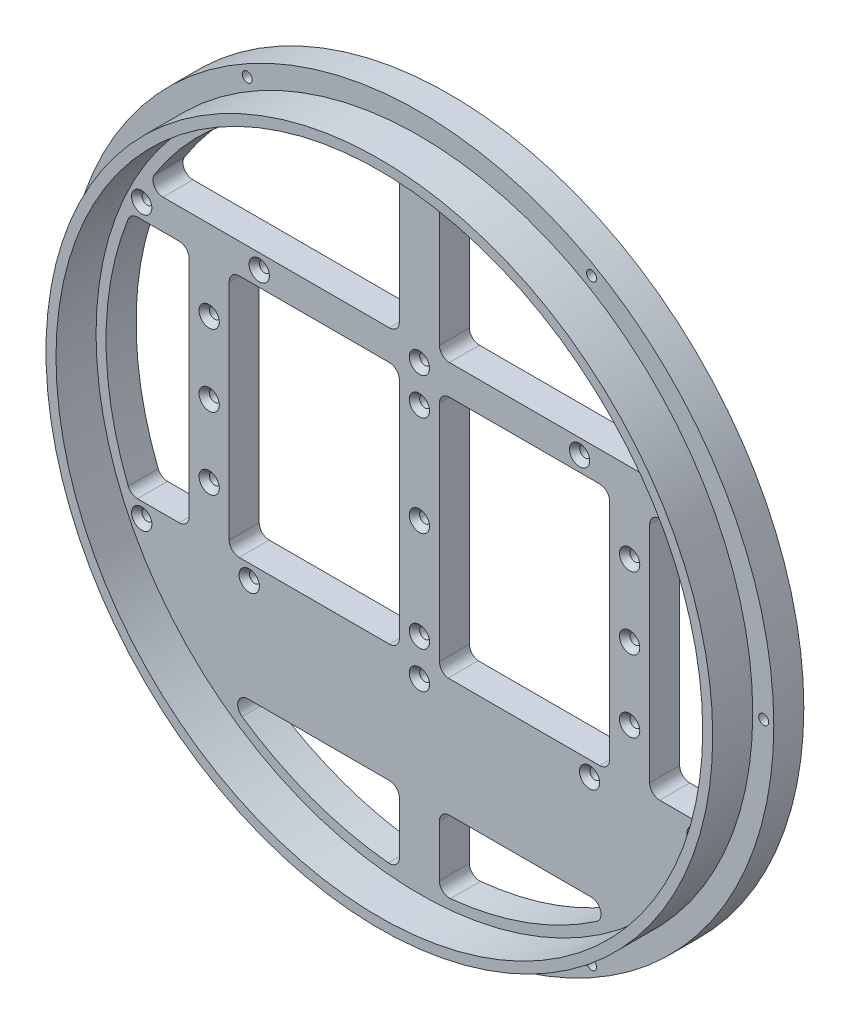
ISO-10303-21;
HEADER;
FILE_DESCRIPTION(('STEP AP214'),'2;1');
FILE_NAME('part.step','',(''),(''),'','','');
FILE_SCHEMA(('AUTOMOTIVE_DESIGN { 1 0 10303 214 1 1 1 1 }'));
ENDSEC;
DATA;
#1=APPLICATION_CONTEXT('core data for automotive mechanical design processes');
#2=APPLICATION_PROTOCOL_DEFINITION('international standard','automotive_design',2000,#1);
#3=PRODUCT_CONTEXT('',#1,'mechanical');
#4=PRODUCT('Part','Part','',(#3));
#5=PRODUCT_RELATED_PRODUCT_CATEGORY('part','',(#4));
#6=PRODUCT_DEFINITION_FORMATION('','',#4);
#7=PRODUCT_DEFINITION_CONTEXT('part definition',#1,'design');
#8=PRODUCT_DEFINITION('design','',#6,#7);
#9=PRODUCT_DEFINITION_SHAPE('','',#8);
#10=(LENGTH_UNIT() NAMED_UNIT(*) SI_UNIT(.MILLI.,.METRE.));
#11=(NAMED_UNIT(*) PLANE_ANGLE_UNIT() SI_UNIT($,.RADIAN.));
#12=(NAMED_UNIT(*) SI_UNIT($,.STERADIAN.) SOLID_ANGLE_UNIT());
#13=UNCERTAINTY_MEASURE_WITH_UNIT(LENGTH_MEASURE(1.E-05),#10,'distance_accuracy_value','');
#14=(GEOMETRIC_REPRESENTATION_CONTEXT(3) GLOBAL_UNCERTAINTY_ASSIGNED_CONTEXT((#13)) GLOBAL_UNIT_ASSIGNED_CONTEXT((#10,
#11,#12)) REPRESENTATION_CONTEXT('',''));
#15=CARTESIAN_POINT('',(0.,0.,0.));
#16=DIRECTION('',(0.,0.,1.));
#17=DIRECTION('',(1.,0.,0.));
#18=AXIS2_PLACEMENT_3D('',#15,#16,#17);
#19=CARTESIAN_POINT('',(0.,0.,-9.52500000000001));
#20=DIRECTION('',(0.,0.,1.));
#21=DIRECTION('',(1.,0.,0.));
#22=AXIS2_PLACEMENT_3D('',#19,#20,#21);
#23=PLANE('',#22);
#24=CARTESIAN_POINT('',(176.135693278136,86.868,-9.52500000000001));
#25=DIRECTION('',(0.,0.,1.));
#26=DIRECTION('',(1.,0.,0.));
#27=AXIS2_PLACEMENT_3D('',#24,#25,#26);
#28=CIRCLE('',#27,3.3782);
#29=CARTESIAN_POINT('',(179.513893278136,86.868,-9.52500000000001));
#30=VERTEX_POINT('',#29);
#31=EDGE_CURVE('E923',#30,#30,#28,.F.);
#32=ORIENTED_EDGE('',*,*,#31,.F.);
#33=EDGE_LOOP('',(#32));
#34=FACE_BOUND('',#33,.T.);
#35=CARTESIAN_POINT('',(176.135693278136,-86.868,-9.52499999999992));
#36=DIRECTION('',(0.,0.,1.));
#37=DIRECTION('',(1.,0.,0.));
#38=AXIS2_PLACEMENT_3D('',#35,#36,#37);
#39=CIRCLE('',#38,3.3782);
#40=CARTESIAN_POINT('',(179.513893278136,-86.868,-9.52499999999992));
#41=VERTEX_POINT('',#40);
#42=EDGE_CURVE('E914',#41,#41,#39,.F.);
#43=ORIENTED_EDGE('',*,*,#42,.F.);
#44=EDGE_LOOP('',(#43));
#45=FACE_BOUND('',#44,.T.);
#46=DIRECTION('',(0.,1.,0.));
#47=VECTOR('',#46,1.);
#48=CARTESIAN_POINT('',(-12.7000000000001,-86.6294398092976,-9.52499999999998));
#49=LINE('',#48,#47);
#50=CARTESIAN_POINT('',(-12.7,-191.459608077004,-9.52499999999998));
#51=VERTEX_POINT('',#50);
#52=CARTESIAN_POINT('',(-12.7,-158.623,-9.52500000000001));
#53=VERTEX_POINT('',#52);
#54=EDGE_CURVE('E1024',#51,#53,#49,.T.);
#55=ORIENTED_EDGE('',*,*,#54,.T.);
#56=CARTESIAN_POINT('',(-19.05,-158.623,-9.52499999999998));
#57=DIRECTION('',(0.,0.,1.));
#58=DIRECTION('',(1.,0.,0.));
#59=AXIS2_PLACEMENT_3D('',#56,#57,#58);
#60=CIRCLE('',#59,6.35);
#61=CARTESIAN_POINT('',(-19.05,-152.273,-9.52499999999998));
#62=VERTEX_POINT('',#61);
#63=EDGE_CURVE('E11',#53,#62,#60,.T.);
#64=ORIENTED_EDGE('',*,*,#63,.T.);
#65=DIRECTION('',(-1.,0.,0.));
#66=VECTOR('',#65,1.);
#67=CARTESIAN_POINT('',(-131.627576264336,-152.273,-9.52500000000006));
#68=LINE('',#67,#66);
#69=CARTESIAN_POINT('',(-108.896409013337,-152.273,-9.52500000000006));
#70=VERTEX_POINT('',#69);
#71=EDGE_CURVE('E952',#62,#70,#68,.T.);
#72=ORIENTED_EDGE('',*,*,#71,.T.);
#73=CARTESIAN_POINT('',(-108.896409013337,-158.623,-9.52500000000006));
#74=DIRECTION('',(0.,0.,1.));
#75=DIRECTION('',(1.,0.,0.));
#76=AXIS2_PLACEMENT_3D('',#73,#74,#75);
#77=CIRCLE('',#76,6.35);
#78=CARTESIAN_POINT('',(-112.490349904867,-163.858082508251,-9.52500000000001));
#79=VERTEX_POINT('',#78);
#80=EDGE_CURVE('E911',#70,#79,#77,.T.);
#81=ORIENTED_EDGE('',*,*,#80,.T.);
#82=CARTESIAN_POINT('',(0.,0.,-9.52500000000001));
#83=DIRECTION('',(0.,0.,-1.));
#84=DIRECTION('',(-1.,0.,0.));
#85=AXIS2_PLACEMENT_3D('',#82,#83,#84);
#86=CIRCLE('',#85,198.755);
#87=CARTESIAN_POINT('',(-19.6787128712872,-197.77840702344,-9.52499999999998));
#88=VERTEX_POINT('',#87);
#89=EDGE_CURVE('E536',#88,#79,#86,.T.);
#90=ORIENTED_EDGE('',*,*,#89,.F.);
#91=CARTESIAN_POINT('',(-19.05,-191.459608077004,-9.52499999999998));
#92=DIRECTION('',(0.,0.,1.));
#93=DIRECTION('',(1.,0.,0.));
#94=AXIS2_PLACEMENT_3D('',#91,#92,#93);
#95=CIRCLE('',#94,6.35);
#96=EDGE_CURVE('E767',#88,#51,#95,.T.);
#97=ORIENTED_EDGE('',*,*,#96,.T.);
#98=EDGE_LOOP('',(#55,#64,#72,#81,#90,#97));
#99=FACE_BOUND('',#98,.T.);
#100=CARTESIAN_POINT('',(112.490349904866,-163.858082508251,-9.52499999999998));
#101=VERTEX_POINT('',#100);
#102=CARTESIAN_POINT('',(19.6787128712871,-197.77840702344,-9.52499999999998));
#103=VERTEX_POINT('',#102);
#104=EDGE_CURVE('E546',#101,#103,#86,.T.);
#105=ORIENTED_EDGE('',*,*,#104,.F.);
#106=CARTESIAN_POINT('',(108.896409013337,-158.623,-9.52500000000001));
#107=DIRECTION('',(0.,0.,1.));
#108=DIRECTION('',(1.,0.,0.));
#109=AXIS2_PLACEMENT_3D('',#106,#107,#108);
#110=CIRCLE('',#109,6.35);
#111=CARTESIAN_POINT('',(108.896409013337,-152.273,-9.52500000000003));
#112=VERTEX_POINT('',#111);
#113=EDGE_CURVE('E901',#101,#112,#110,.T.);
#114=ORIENTED_EDGE('',*,*,#113,.T.);
#115=CARTESIAN_POINT('',(19.0499999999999,-152.273,-9.52499999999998));
#116=VERTEX_POINT('',#115);
#117=EDGE_CURVE('E956',#112,#116,#68,.T.);
#118=ORIENTED_EDGE('',*,*,#117,.T.);
#119=CARTESIAN_POINT('',(19.0499999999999,-158.623,-9.52499999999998));
#120=DIRECTION('',(0.,0.,1.));
#121=DIRECTION('',(1.,0.,0.));
#122=AXIS2_PLACEMENT_3D('',#119,#120,#121);
#123=CIRCLE('',#122,6.35);
#124=CARTESIAN_POINT('',(12.7,-158.623,-9.52500000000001));
#125=VERTEX_POINT('',#124);
#126=EDGE_CURVE('E905',#116,#125,#123,.T.);
#127=ORIENTED_EDGE('',*,*,#126,.T.);
#128=DIRECTION('',(0.,-1.,0.));
#129=VECTOR('',#128,1.);
#130=CARTESIAN_POINT('',(12.7,-86.6294398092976,-9.52500000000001));
#131=LINE('',#130,#129);
#132=CARTESIAN_POINT('',(12.7,-191.459608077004,-9.52500000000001));
#133=VERTEX_POINT('',#132);
#134=EDGE_CURVE('E1022',#125,#133,#131,.T.);
#135=ORIENTED_EDGE('',*,*,#134,.T.);
#136=CARTESIAN_POINT('',(19.05,-191.459608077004,-9.52499999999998));
#137=DIRECTION('',(0.,0.,1.));
#138=DIRECTION('',(1.,0.,0.));
#139=AXIS2_PLACEMENT_3D('',#136,#137,#138);
#140=CIRCLE('',#139,6.35);
#141=EDGE_CURVE('E774',#133,#103,#140,.T.);
#142=ORIENTED_EDGE('',*,*,#141,.T.);
#143=EDGE_LOOP('',(#105,#114,#118,#127,#135,#142));
#144=FACE_BOUND('',#143,.T.);
#145=CARTESIAN_POINT('',(-101.6,86.868,-9.52500000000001));
#146=DIRECTION('',(0.,0.,1.));
#147=DIRECTION('',(1.,0.,0.));
#148=AXIS2_PLACEMENT_3D('',#145,#146,#147);
#149=CIRCLE('',#148,3.37819999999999);
#150=CARTESIAN_POINT('',(-98.2218,86.868,-9.52500000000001));
#151=VERTEX_POINT('',#150);
#152=EDGE_CURVE('E870',#151,#151,#149,.F.);
#153=ORIENTED_EDGE('',*,*,#152,.F.);
#154=EDGE_LOOP('',(#153));
#155=FACE_BOUND('',#154,.T.);
#156=CARTESIAN_POINT('',(107.95,-86.868,-9.52499999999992));
#157=DIRECTION('',(0.,0.,1.));
#158=DIRECTION('',(1.,0.,0.));
#159=AXIS2_PLACEMENT_3D('',#156,#157,#158);
#160=CIRCLE('',#159,3.37819999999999);
#161=CARTESIAN_POINT('',(111.3282,-86.868,-9.52499999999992));
#162=VERTEX_POINT('',#161);
#163=EDGE_CURVE('E860',#162,#162,#160,.F.);
#164=ORIENTED_EDGE('',*,*,#163,.F.);
#165=EDGE_LOOP('',(#164));
#166=FACE_BOUND('',#165,.T.);
#167=CARTESIAN_POINT('',(0.,-86.868,-9.52500000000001));
#168=DIRECTION('',(0.,0.,1.));
#169=DIRECTION('',(1.,0.,0.));
#170=AXIS2_PLACEMENT_3D('',#167,#168,#169);
#171=CIRCLE('',#170,3.37819999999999);
#172=CARTESIAN_POINT('',(3.37820000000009,-86.868,-9.52500000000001));
#173=VERTEX_POINT('',#172);
#174=EDGE_CURVE('E849',#173,#173,#171,.F.);
#175=ORIENTED_EDGE('',*,*,#174,.F.);
#176=EDGE_LOOP('',(#175));
#177=FACE_BOUND('',#176,.T.);
#178=CARTESIAN_POINT('',(133.35,0.,-9.52500000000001));
#179=DIRECTION('',(0.,0.,1.));
#180=DIRECTION('',(1.,0.,0.));
#181=AXIS2_PLACEMENT_3D('',#178,#179,#180);
#182=CIRCLE('',#181,3.3782);
#183=CARTESIAN_POINT('',(136.7282,0.,-9.52500000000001));
#184=VERTEX_POINT('',#183);
#185=EDGE_CURVE('E838',#184,#184,#182,.F.);
#186=ORIENTED_EDGE('',*,*,#185,.F.);
#187=EDGE_LOOP('',(#186));
#188=FACE_BOUND('',#187,.T.);
#189=CARTESIAN_POINT('',(-133.35,45.593,-9.52500000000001));
#190=DIRECTION('',(0.,0.,1.));
#191=DIRECTION('',(1.,0.,0.));
#192=AXIS2_PLACEMENT_3D('',#189,#190,#191);
#193=CIRCLE('',#192,3.3782);
#194=CARTESIAN_POINT('',(-129.9718,45.593,-9.52500000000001));
#195=VERTEX_POINT('',#194);
#196=EDGE_CURVE('E828',#195,#195,#193,.F.);
#197=ORIENTED_EDGE('',*,*,#196,.F.);
#198=EDGE_LOOP('',(#197));
#199=FACE_BOUND('',#198,.T.);
#200=CARTESIAN_POINT('',(-133.35,-45.593,-9.52500000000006));
#201=DIRECTION('',(0.,0.,1.));
#202=DIRECTION('',(1.,0.,0.));
#203=AXIS2_PLACEMENT_3D('',#200,#201,#202);
#204=CIRCLE('',#203,3.3782);
#205=CARTESIAN_POINT('',(-129.9718,-45.593,-9.52500000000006));
#206=VERTEX_POINT('',#205);
#207=EDGE_CURVE('E818',#206,#206,#204,.F.);
#208=ORIENTED_EDGE('',*,*,#207,.F.);
#209=EDGE_LOOP('',(#208));
#210=FACE_BOUND('',#209,.T.);
#211=CARTESIAN_POINT('',(0.,-63.5,-9.52500000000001));
#212=DIRECTION('',(0.,0.,1.));
#213=DIRECTION('',(1.,0.,0.));
#214=AXIS2_PLACEMENT_3D('',#211,#212,#213);
#215=CIRCLE('',#214,3.37819999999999);
#216=CARTESIAN_POINT('',(3.37819999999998,-63.5,-9.52500000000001));
#217=VERTEX_POINT('',#216);
#218=EDGE_CURVE('E807',#217,#217,#215,.F.);
#219=ORIENTED_EDGE('',*,*,#218,.F.);
#220=EDGE_LOOP('',(#219));
#221=FACE_BOUND('',#220,.T.);
#222=CARTESIAN_POINT('',(0.,0.,-9.52500000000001));
#223=DIRECTION('',(0.,0.,1.));
#224=DIRECTION('',(1.,0.,0.));
#225=AXIS2_PLACEMENT_3D('',#222,#223,#224);
#226=CIRCLE('',#225,224.79);
#227=CARTESIAN_POINT('',(224.79,0.,-9.52500000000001));
#228=VERTEX_POINT('',#227);
#229=EDGE_CURVE('E594',#228,#228,#226,.T.);
#230=ORIENTED_EDGE('',*,*,#229,.F.);
#231=EDGE_LOOP('',(#230));
#232=FACE_BOUND('',#231,.T.);
#233=CARTESIAN_POINT('',(-218.4,0.,-9.52500000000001));
#234=DIRECTION('',(0.,0.,1.));
#235=DIRECTION('',(1.,0.,0.));
#236=AXIS2_PLACEMENT_3D('',#233,#234,#235);
#237=CIRCLE('',#236,3.175);
#238=CARTESIAN_POINT('',(-215.225,0.,-9.52500000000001));
#239=VERTEX_POINT('',#238);
#240=EDGE_CURVE('E591',#239,#239,#237,.T.);
#241=ORIENTED_EDGE('',*,*,#240,.T.);
#242=EDGE_LOOP('',(#241));
#243=FACE_BOUND('',#242,.T.);
#244=CARTESIAN_POINT('',(218.4,0.,-9.52500000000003));
#245=DIRECTION('',(0.,0.,1.));
#246=DIRECTION('',(-1.,0.,0.));
#247=AXIS2_PLACEMENT_3D('',#244,#245,#246);
#248=CIRCLE('',#247,3.175);
#249=CARTESIAN_POINT('',(215.225,0.,-9.52500000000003));
#250=VERTEX_POINT('',#249);
#251=EDGE_CURVE('E585',#250,#250,#248,.T.);
#252=ORIENTED_EDGE('',*,*,#251,.T.);
#253=EDGE_LOOP('',(#252));
#254=FACE_BOUND('',#253,.T.);
#255=CARTESIAN_POINT('',(109.200000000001,-189.139948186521,-9.52499999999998));
#256=DIRECTION('',(0.,0.,1.));
#257=DIRECTION('',(-0.500000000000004,0.866025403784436,0.));
#258=AXIS2_PLACEMENT_3D('',#255,#256,#257);
#259=CIRCLE('',#258,3.175);
#260=CARTESIAN_POINT('',(107.612500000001,-186.390317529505,-9.52499999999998));
#261=VERTEX_POINT('',#260);
#262=EDGE_CURVE('E579',#261,#261,#259,.T.);
#263=ORIENTED_EDGE('',*,*,#262,.T.);
#264=EDGE_LOOP('',(#263));
#265=FACE_BOUND('',#264,.T.);
#266=CARTESIAN_POINT('',(-109.200000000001,189.139948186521,-9.52500000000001));
#267=DIRECTION('',(0.,0.,1.));
#268=DIRECTION('',(0.500000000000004,-0.866025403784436,0.));
#269=AXIS2_PLACEMENT_3D('',#266,#267,#268);
#270=CIRCLE('',#269,3.175);
#271=CARTESIAN_POINT('',(-107.612500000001,186.390317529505,-9.52500000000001));
#272=VERTEX_POINT('',#271);
#273=EDGE_CURVE('E573',#272,#272,#270,.T.);
#274=ORIENTED_EDGE('',*,*,#273,.T.);
#275=EDGE_LOOP('',(#274));
#276=FACE_BOUND('',#275,.T.);
#277=CARTESIAN_POINT('',(109.199999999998,189.139948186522,-9.52499999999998));
#278=DIRECTION('',(0.,0.,1.));
#279=DIRECTION('',(-0.499999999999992,-0.866025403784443,0.));
#280=AXIS2_PLACEMENT_3D('',#277,#278,#279);
#281=CIRCLE('',#280,3.175);
#282=CARTESIAN_POINT('',(107.612499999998,186.390317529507,-9.52499999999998));
#283=VERTEX_POINT('',#282);
#284=EDGE_CURVE('E567',#283,#283,#281,.T.);
#285=ORIENTED_EDGE('',*,*,#284,.T.);
#286=EDGE_LOOP('',(#285));
#287=FACE_BOUND('',#286,.T.);
#288=CARTESIAN_POINT('',(-109.199999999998,-189.139948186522,-9.52499999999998));
#289=DIRECTION('',(0.,0.,1.));
#290=DIRECTION('',(0.499999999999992,0.866025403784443,0.));
#291=AXIS2_PLACEMENT_3D('',#288,#289,#290);
#292=CIRCLE('',#291,3.175);
#293=CARTESIAN_POINT('',(-107.612499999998,-186.390317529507,-9.52499999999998));
#294=VERTEX_POINT('',#293);
#295=EDGE_CURVE('E561',#294,#294,#292,.T.);
#296=ORIENTED_EDGE('',*,*,#295,.T.);
#297=EDGE_LOOP('',(#296));
#298=FACE_BOUND('',#297,.T.);
#299=DIRECTION('',(-1.,0.,0.));
#300=VECTOR('',#299,1.);
#301=CARTESIAN_POINT('',(178.828627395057,-77.343,-9.52499999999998));
#302=LINE('',#301,#300);
#303=CARTESIAN_POINT('',(114.3,-77.343,-9.52500000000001));
#304=VERTEX_POINT('',#303);
#305=CARTESIAN_POINT('',(18.2067620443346,-77.343,-9.52499999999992));
#306=VERTEX_POINT('',#305);
#307=EDGE_CURVE('E476',#304,#306,#302,.T.);
#308=ORIENTED_EDGE('',*,*,#307,.F.);
#309=CARTESIAN_POINT('',(114.3,-70.993,-9.52500000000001));
#310=DIRECTION('',(0.,0.,1.));
#311=DIRECTION('',(1.,0.,0.));
#312=AXIS2_PLACEMENT_3D('',#309,#310,#311);
#313=CIRCLE('',#312,6.35);
#314=CARTESIAN_POINT('',(120.65,-70.993,-9.52500000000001));
#315=VERTEX_POINT('',#314);
#316=EDGE_CURVE('E757',#304,#315,#313,.T.);
#317=ORIENTED_EDGE('',*,*,#316,.T.);
#318=DIRECTION('',(0.,1.,0.));
#319=VECTOR('',#318,1.);
#320=CARTESIAN_POINT('',(120.65,77.343,-9.52500000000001));
#321=LINE('',#320,#319);
#322=CARTESIAN_POINT('',(120.65,70.993,-9.52500000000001));
#323=VERTEX_POINT('',#322);
#324=EDGE_CURVE('E1060',#315,#323,#321,.T.);
#325=ORIENTED_EDGE('',*,*,#324,.T.);
#326=CARTESIAN_POINT('',(114.3,70.993,-9.52500000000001));
#327=DIRECTION('',(0.,0.,1.));
#328=DIRECTION('',(1.,0.,0.));
#329=AXIS2_PLACEMENT_3D('',#326,#327,#328);
#330=CIRCLE('',#329,6.35);
#331=CARTESIAN_POINT('',(114.3,77.343,-9.52500000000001));
#332=VERTEX_POINT('',#331);
#333=EDGE_CURVE('E752',#323,#332,#330,.T.);
#334=ORIENTED_EDGE('',*,*,#333,.T.);
#335=DIRECTION('',(1.,0.,0.));
#336=VECTOR('',#335,1.);
#337=CARTESIAN_POINT('',(178.828627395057,77.343,-9.52499999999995));
#338=LINE('',#337,#336);
#339=CARTESIAN_POINT('',(19.05,77.343,-9.52500000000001));
#340=VERTEX_POINT('',#339);
#341=EDGE_CURVE('E492',#340,#332,#338,.T.);
#342=ORIENTED_EDGE('',*,*,#341,.F.);
#343=CARTESIAN_POINT('',(19.05,70.993,-9.52500000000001));
#344=DIRECTION('',(0.,0.,-1.));
#345=DIRECTION('',(-1.,0.,0.));
#346=AXIS2_PLACEMENT_3D('',#343,#344,#345);
#347=CIRCLE('',#346,6.35);
#348=CARTESIAN_POINT('',(12.7,70.993,-9.52500000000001));
#349=VERTEX_POINT('',#348);
#350=EDGE_CURVE('E488',#349,#340,#347,.T.);
#351=ORIENTED_EDGE('',*,*,#350,.F.);
#352=DIRECTION('',(0.,1.,0.));
#353=VECTOR('',#352,1.);
#354=CARTESIAN_POINT('',(12.7,70.993,-9.52500000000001));
#355=LINE('',#354,#353);
#356=CARTESIAN_POINT('',(12.7,-71.0492372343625,-9.5249999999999));
#357=VERTEX_POINT('',#356);
#358=EDGE_CURVE('E484',#357,#349,#355,.T.);
#359=ORIENTED_EDGE('',*,*,#358,.F.);
#360=CARTESIAN_POINT('',(19.05,-71.0492372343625,-9.52500000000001));
#361=DIRECTION('',(0.,0.,-1.));
#362=DIRECTION('',(1.,0.,0.));
#363=AXIS2_PLACEMENT_3D('',#360,#361,#362);
#364=CIRCLE('',#363,6.35);
#365=EDGE_CURVE('E480',#306,#357,#364,.T.);
#366=ORIENTED_EDGE('',*,*,#365,.F.);
#367=EDGE_LOOP('',(#308,#317,#325,#334,#342,#351,#359,#366));
#368=FACE_BOUND('',#367,.T.);
#369=DIRECTION('',(-1.,0.,0.));
#370=VECTOR('',#369,1.);
#371=CARTESIAN_POINT('',(-19.05,-77.3429999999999,-9.52500000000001));
#372=LINE('',#371,#370);
#373=CARTESIAN_POINT('',(-152.4,-77.3429999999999,-9.5249999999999));
#374=VERTEX_POINT('',#373);
#375=CARTESIAN_POINT('',(-178.828627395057,-77.3429999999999,-9.52499999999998));
#376=VERTEX_POINT('',#375);
#377=EDGE_CURVE('E406',#374,#376,#372,.T.);
#378=ORIENTED_EDGE('',*,*,#377,.F.);
#379=CARTESIAN_POINT('',(-152.4,-70.993,-9.5249999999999));
#380=DIRECTION('',(0.,0.,1.));
#381=DIRECTION('',(1.,0.,0.));
#382=AXIS2_PLACEMENT_3D('',#379,#380,#381);
#383=CIRCLE('',#382,6.35);
#384=CARTESIAN_POINT('',(-146.05,-70.993,-9.52499999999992));
#385=VERTEX_POINT('',#384);
#386=EDGE_CURVE('E799',#374,#385,#383,.T.);
#387=ORIENTED_EDGE('',*,*,#386,.T.);
#388=DIRECTION('',(0.,1.,0.));
#389=VECTOR('',#388,1.);
#390=CARTESIAN_POINT('',(-146.05,77.343,-9.52500000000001));
#391=LINE('',#390,#389);
#392=CARTESIAN_POINT('',(-146.05,70.993,-9.52500000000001));
#393=VERTEX_POINT('',#392);
#394=EDGE_CURVE('E1047',#385,#393,#391,.T.);
#395=ORIENTED_EDGE('',*,*,#394,.T.);
#396=CARTESIAN_POINT('',(-152.4,70.993,-9.52500000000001));
#397=DIRECTION('',(0.,0.,1.));
#398=DIRECTION('',(1.,0.,0.));
#399=AXIS2_PLACEMENT_3D('',#396,#397,#398);
#400=CIRCLE('',#399,6.35);
#401=CARTESIAN_POINT('',(-152.4,77.3429999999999,-9.52500000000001));
#402=VERTEX_POINT('',#401);
#403=EDGE_CURVE('E795',#393,#402,#400,.T.);
#404=ORIENTED_EDGE('',*,*,#403,.T.);
#405=DIRECTION('',(1.,0.,0.));
#406=VECTOR('',#405,1.);
#407=CARTESIAN_POINT('',(-19.05,77.343,-9.52500000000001));
#408=LINE('',#407,#406);
#409=CARTESIAN_POINT('',(-178.828627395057,77.3429999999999,-9.52499999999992));
#410=VERTEX_POINT('',#409);
#411=EDGE_CURVE('E445',#410,#402,#408,.T.);
#412=ORIENTED_EDGE('',*,*,#411,.F.);
#413=CARTESIAN_POINT('',(-178.828627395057,70.993,-9.52499999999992));
#414=DIRECTION('',(0.,0.,-1.));
#415=DIRECTION('',(1.,0.,0.));
#416=AXIS2_PLACEMENT_3D('',#413,#414,#415);
#417=CIRCLE('',#416,6.34999999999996);
#418=CARTESIAN_POINT('',(-184.730562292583,73.3360033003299,-9.52499999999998));
#419=VERTEX_POINT('',#418);
#420=EDGE_CURVE('E437',#419,#410,#417,.T.);
#421=ORIENTED_EDGE('',*,*,#420,.F.);
#422=CARTESIAN_POINT('',(0.,0.,-9.52500000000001));
#423=DIRECTION('',(0.,0.,-1.));
#424=DIRECTION('',(-1.,0.,0.));
#425=AXIS2_PLACEMENT_3D('',#422,#423,#424);
#426=CIRCLE('',#425,198.755);
#427=CARTESIAN_POINT('',(-184.730562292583,-73.3360033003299,-9.52500000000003));
#428=VERTEX_POINT('',#427);
#429=EDGE_CURVE('E435',#428,#419,#426,.T.);
#430=ORIENTED_EDGE('',*,*,#429,.F.);
#431=CARTESIAN_POINT('',(-178.828627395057,-70.9929999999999,-9.52499999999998));
#432=DIRECTION('',(0.,0.,-1.));
#433=DIRECTION('',(1.,0.,0.));
#434=AXIS2_PLACEMENT_3D('',#431,#432,#433);
#435=CIRCLE('',#434,6.34999999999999);
#436=EDGE_CURVE('E424',#376,#428,#435,.T.);
#437=ORIENTED_EDGE('',*,*,#436,.F.);
#438=EDGE_LOOP('',(#378,#387,#395,#404,#412,#421,#430,#437));
#439=FACE_BOUND('',#438,.T.);
#440=CARTESIAN_POINT('',(152.4,77.343,-9.52500000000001));
#441=VERTEX_POINT('',#440);
#442=CARTESIAN_POINT('',(178.828627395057,77.343,-9.52499999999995));
#443=VERTEX_POINT('',#442);
#444=EDGE_CURVE('E491',#441,#443,#338,.T.);
#445=ORIENTED_EDGE('',*,*,#444,.F.);
#446=CARTESIAN_POINT('',(152.4,70.993,-9.52500000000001));
#447=DIRECTION('',(0.,0.,1.));
#448=DIRECTION('',(1.,0.,0.));
#449=AXIS2_PLACEMENT_3D('',#446,#447,#448);
#450=CIRCLE('',#449,6.35);
#451=CARTESIAN_POINT('',(146.05,70.993,-9.52500000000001));
#452=VERTEX_POINT('',#451);
#453=EDGE_CURVE('E746',#441,#452,#450,.T.);
#454=ORIENTED_EDGE('',*,*,#453,.T.);
#455=DIRECTION('',(0.,-1.,0.));
#456=VECTOR('',#455,1.);
#457=CARTESIAN_POINT('',(146.05,77.343,-9.52500000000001));
#458=LINE('',#457,#456);
#459=CARTESIAN_POINT('',(146.05,-70.993,-9.52499999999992));
#460=VERTEX_POINT('',#459);
#461=EDGE_CURVE('E1056',#452,#460,#458,.T.);
#462=ORIENTED_EDGE('',*,*,#461,.T.);
#463=CARTESIAN_POINT('',(152.4,-70.993,-9.52499999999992));
#464=DIRECTION('',(0.,0.,1.));
#465=DIRECTION('',(1.,0.,0.));
#466=AXIS2_PLACEMENT_3D('',#463,#464,#465);
#467=CIRCLE('',#466,6.35);
#468=CARTESIAN_POINT('',(152.4,-77.343,-9.52499999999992));
#469=VERTEX_POINT('',#468);
#470=EDGE_CURVE('E741',#460,#469,#467,.T.);
#471=ORIENTED_EDGE('',*,*,#470,.T.);
#472=CARTESIAN_POINT('',(178.828627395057,-77.343,-9.52499999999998));
#473=VERTEX_POINT('',#472);
#474=EDGE_CURVE('E477',#473,#469,#302,.T.);
#475=ORIENTED_EDGE('',*,*,#474,.F.);
#476=CARTESIAN_POINT('',(178.828627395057,-70.993,-9.52499999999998));
#477=DIRECTION('',(0.,0.,-1.));
#478=DIRECTION('',(-1.,0.,0.));
#479=AXIS2_PLACEMENT_3D('',#476,#477,#478);
#480=CIRCLE('',#479,6.35000000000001);
#481=CARTESIAN_POINT('',(184.730562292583,-73.33600330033,-9.52500000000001));
#482=VERTEX_POINT('',#481);
#483=EDGE_CURVE('E473',#482,#473,#480,.T.);
#484=ORIENTED_EDGE('',*,*,#483,.F.);
#485=CARTESIAN_POINT('',(0.,0.,-9.52500000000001));
#486=DIRECTION('',(0.,0.,-1.));
#487=DIRECTION('',(-1.,0.,0.));
#488=AXIS2_PLACEMENT_3D('',#485,#486,#487);
#489=CIRCLE('',#488,198.755);
#490=CARTESIAN_POINT('',(184.730562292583,73.33600330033,-9.5249999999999));
#491=VERTEX_POINT('',#490);
#492=EDGE_CURVE('E470',#491,#482,#489,.T.);
#493=ORIENTED_EDGE('',*,*,#492,.F.);
#494=CARTESIAN_POINT('',(178.828627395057,70.993,-9.52499999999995));
#495=DIRECTION('',(0.,0.,-1.));
#496=DIRECTION('',(1.,0.,0.));
#497=AXIS2_PLACEMENT_3D('',#494,#495,#496);
#498=CIRCLE('',#497,6.34999999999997);
#499=EDGE_CURVE('E456',#443,#491,#498,.T.);
#500=ORIENTED_EDGE('',*,*,#499,.F.);
#501=EDGE_LOOP('',(#445,#454,#462,#471,#475,#484,#493,#500));
#502=FACE_BOUND('',#501,.T.);
#503=CARTESIAN_POINT('',(-114.3,77.343,-9.52500000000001));
#504=VERTEX_POINT('',#503);
#505=CARTESIAN_POINT('',(-19.05,77.343,-9.52500000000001));
#506=VERTEX_POINT('',#505);
#507=EDGE_CURVE('E444',#504,#506,#408,.T.);
#508=ORIENTED_EDGE('',*,*,#507,.F.);
#509=CARTESIAN_POINT('',(-114.3,70.993,-9.52500000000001));
#510=DIRECTION('',(0.,0.,1.));
#511=DIRECTION('',(1.,0.,0.));
#512=AXIS2_PLACEMENT_3D('',#509,#510,#511);
#513=CIRCLE('',#512,6.35);
#514=CARTESIAN_POINT('',(-120.65,70.993,-9.52500000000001));
#515=VERTEX_POINT('',#514);
#516=EDGE_CURVE('E765',#504,#515,#513,.T.);
#517=ORIENTED_EDGE('',*,*,#516,.T.);
#518=DIRECTION('',(0.,-1.,0.));
#519=VECTOR('',#518,1.);
#520=CARTESIAN_POINT('',(-120.65,77.343,-9.52500000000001));
#521=LINE('',#520,#519);
#522=CARTESIAN_POINT('',(-120.65,-70.9929999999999,-9.52499999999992));
#523=VERTEX_POINT('',#522);
#524=EDGE_CURVE('E1044',#515,#523,#521,.T.);
#525=ORIENTED_EDGE('',*,*,#524,.T.);
#526=CARTESIAN_POINT('',(-114.3,-70.9929999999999,-9.52499999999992));
#527=DIRECTION('',(0.,0.,1.));
#528=DIRECTION('',(1.,0.,0.));
#529=AXIS2_PLACEMENT_3D('',#526,#527,#528);
#530=CIRCLE('',#529,6.35);
#531=CARTESIAN_POINT('',(-114.3,-77.3429999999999,-9.52499999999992));
#532=VERTEX_POINT('',#531);
#533=EDGE_CURVE('E761',#523,#532,#530,.T.);
#534=ORIENTED_EDGE('',*,*,#533,.T.);
#535=CARTESIAN_POINT('',(-19.05,-77.3429999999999,-9.52500000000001));
#536=VERTEX_POINT('',#535);
#537=EDGE_CURVE('E417',#536,#532,#372,.T.);
#538=ORIENTED_EDGE('',*,*,#537,.F.);
#539=CARTESIAN_POINT('',(-19.05,-70.9929999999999,-9.52500000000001));
#540=DIRECTION('',(0.,0.,-1.));
#541=DIRECTION('',(1.,0.,0.));
#542=AXIS2_PLACEMENT_3D('',#539,#540,#541);
#543=CIRCLE('',#542,6.35);
#544=CARTESIAN_POINT('',(-12.7,-70.993,-9.52499999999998));
#545=VERTEX_POINT('',#544);
#546=EDGE_CURVE('E418',#545,#536,#543,.T.);
#547=ORIENTED_EDGE('',*,*,#546,.F.);
#548=DIRECTION('',(0.,-1.,0.));
#549=VECTOR('',#548,1.);
#550=CARTESIAN_POINT('',(-12.7,70.993,-9.52500000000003));
#551=LINE('',#550,#549);
#552=CARTESIAN_POINT('',(-12.7,70.993,-9.52500000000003));
#553=VERTEX_POINT('',#552);
#554=EDGE_CURVE('E451',#553,#545,#551,.T.);
#555=ORIENTED_EDGE('',*,*,#554,.F.);
#556=CARTESIAN_POINT('',(-19.05,70.993,-9.52500000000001));
#557=DIRECTION('',(0.,0.,-1.));
#558=DIRECTION('',(-1.,0.,0.));
#559=AXIS2_PLACEMENT_3D('',#556,#557,#558);
#560=CIRCLE('',#559,6.35000000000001);
#561=EDGE_CURVE('E448',#506,#553,#560,.T.);
#562=ORIENTED_EDGE('',*,*,#561,.F.);
#563=EDGE_LOOP('',(#508,#517,#525,#534,#538,#547,#555,#562));
#564=FACE_BOUND('',#563,.T.);
#565=CARTESIAN_POINT('',(0.,0.,-9.52500000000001));
#566=DIRECTION('',(0.,0.,-1.));
#567=DIRECTION('',(-1.,0.,0.));
#568=AXIS2_PLACEMENT_3D('',#565,#566,#567);
#569=CIRCLE('',#568,198.755);
#570=CARTESIAN_POINT('',(19.6787128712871,197.77840702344,-9.52499999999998));
#571=VERTEX_POINT('',#570);
#572=CARTESIAN_POINT('',(168.0450957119,106.133858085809,-9.52499999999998));
#573=VERTEX_POINT('',#572);
#574=EDGE_CURVE('E519',#571,#573,#569,.T.);
#575=ORIENTED_EDGE('',*,*,#574,.F.);
#576=CARTESIAN_POINT('',(19.0499999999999,191.459608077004,-9.52499999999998));
#577=DIRECTION('',(0.,0.,1.));
#578=DIRECTION('',(1.,0.,0.));
#579=AXIS2_PLACEMENT_3D('',#576,#577,#578);
#580=CIRCLE('',#579,6.35);
#581=CARTESIAN_POINT('',(12.7,191.459608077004,-9.52499999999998));
#582=VERTEX_POINT('',#581);
#583=EDGE_CURVE('E789',#571,#582,#580,.T.);
#584=ORIENTED_EDGE('',*,*,#583,.T.);
#585=DIRECTION('',(0.,-1.,0.));
#586=VECTOR('',#585,1.);
#587=CARTESIAN_POINT('',(12.7,86.6294398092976,-9.52500000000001));
#588=LINE('',#587,#586);
#589=CARTESIAN_POINT('',(12.7,102.743,-9.52500000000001));
#590=VERTEX_POINT('',#589);
#591=EDGE_CURVE('E1032',#582,#590,#588,.T.);
#592=ORIENTED_EDGE('',*,*,#591,.T.);
#593=CARTESIAN_POINT('',(19.05,102.743,-9.52500000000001));
#594=DIRECTION('',(0.,0.,1.));
#595=DIRECTION('',(1.,0.,0.));
#596=AXIS2_PLACEMENT_3D('',#593,#594,#595);
#597=CIRCLE('',#596,6.35);
#598=CARTESIAN_POINT('',(19.05,96.393,-9.52500000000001));
#599=VERTEX_POINT('',#598);
#600=EDGE_CURVE('E779',#590,#599,#597,.T.);
#601=ORIENTED_EDGE('',*,*,#600,.T.);
#602=DIRECTION('',(-1.,0.,0.));
#603=VECTOR('',#602,1.);
#604=CARTESIAN_POINT('',(-162.676242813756,96.393,-9.52499999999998));
#605=LINE('',#604,#603);
#606=CARTESIAN_POINT('',(162.676242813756,96.393,-9.52500000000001));
#607=VERTEX_POINT('',#606);
#608=EDGE_CURVE('E528',#607,#599,#605,.T.);
#609=ORIENTED_EDGE('',*,*,#608,.F.);
#610=CARTESIAN_POINT('',(162.676242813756,102.743,-9.52500000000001));
#611=DIRECTION('',(0.,0.,-1.));
#612=DIRECTION('',(-1.,0.,0.));
#613=AXIS2_PLACEMENT_3D('',#610,#611,#612);
#614=CIRCLE('',#613,6.35000000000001);
#615=EDGE_CURVE('E523',#573,#607,#614,.T.);
#616=ORIENTED_EDGE('',*,*,#615,.F.);
#617=EDGE_LOOP('',(#575,#584,#592,#601,#609,#616));
#618=FACE_BOUND('',#617,.T.);
#619=CARTESIAN_POINT('',(-19.05,96.393,-9.52500000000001));
#620=VERTEX_POINT('',#619);
#621=CARTESIAN_POINT('',(-162.676242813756,96.393,-9.52499999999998));
#622=VERTEX_POINT('',#621);
#623=EDGE_CURVE('E527',#620,#622,#605,.T.);
#624=ORIENTED_EDGE('',*,*,#623,.F.);
#625=CARTESIAN_POINT('',(-19.0500000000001,102.743,-9.52500000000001));
#626=DIRECTION('',(0.,0.,1.));
#627=DIRECTION('',(1.,0.,0.));
#628=AXIS2_PLACEMENT_3D('',#625,#626,#627);
#629=CIRCLE('',#628,6.35);
#630=CARTESIAN_POINT('',(-12.7,102.743,-9.52500000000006));
#631=VERTEX_POINT('',#630);
#632=EDGE_CURVE('E781',#620,#631,#629,.T.);
#633=ORIENTED_EDGE('',*,*,#632,.T.);
#634=DIRECTION('',(0.,1.,0.));
#635=VECTOR('',#634,1.);
#636=CARTESIAN_POINT('',(-12.7000000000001,86.6294398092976,-9.52500000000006));
#637=LINE('',#636,#635);
#638=CARTESIAN_POINT('',(-12.7,191.459608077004,-9.52499999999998));
#639=VERTEX_POINT('',#638);
#640=EDGE_CURVE('E1035',#631,#639,#637,.T.);
#641=ORIENTED_EDGE('',*,*,#640,.T.);
#642=CARTESIAN_POINT('',(-19.05,191.459608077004,-9.52499999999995));
#643=DIRECTION('',(0.,0.,1.));
#644=DIRECTION('',(1.,0.,0.));
#645=AXIS2_PLACEMENT_3D('',#642,#643,#644);
#646=CIRCLE('',#645,6.35);
#647=CARTESIAN_POINT('',(-19.6787128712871,197.77840702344,-9.52499999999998));
#648=VERTEX_POINT('',#647);
#649=EDGE_CURVE('E787',#639,#648,#646,.T.);
#650=ORIENTED_EDGE('',*,*,#649,.T.);
#651=CARTESIAN_POINT('',(-168.0450957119,106.133858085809,-9.52500000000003));
#652=VERTEX_POINT('',#651);
#653=EDGE_CURVE('E520',#652,#648,#569,.T.);
#654=ORIENTED_EDGE('',*,*,#653,.F.);
#655=CARTESIAN_POINT('',(-162.676242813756,102.743,-9.52499999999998));
#656=DIRECTION('',(0.,0.,-1.));
#657=DIRECTION('',(1.,0.,0.));
#658=AXIS2_PLACEMENT_3D('',#655,#656,#657);
#659=CIRCLE('',#658,6.35000000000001);
#660=EDGE_CURVE('E500',#622,#652,#659,.T.);
#661=ORIENTED_EDGE('',*,*,#660,.F.);
#662=EDGE_LOOP('',(#624,#633,#641,#650,#654,#661));
#663=FACE_BOUND('',#662,.T.);
#664=CARTESIAN_POINT('',(0.,0.,-9.52500000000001));
#665=DIRECTION('',(0.,0.,1.));
#666=DIRECTION('',(1.,0.,0.));
#667=AXIS2_PLACEMENT_3D('',#664,#665,#666);
#668=CIRCLE('',#667,3.37819999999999);
#669=CARTESIAN_POINT('',(3.37819999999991,0.,-9.52500000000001));
#670=VERTEX_POINT('',#669);
#671=EDGE_CURVE('E802',#670,#670,#668,.F.);
#672=ORIENTED_EDGE('',*,*,#671,.F.);
#673=EDGE_LOOP('',(#672));
#674=FACE_BOUND('',#673,.T.);
#675=CARTESIAN_POINT('',(0.,63.5,-9.52500000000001));
#676=DIRECTION('',(0.,0.,1.));
#677=DIRECTION('',(1.,0.,0.));
#678=AXIS2_PLACEMENT_3D('',#675,#676,#677);
#679=CIRCLE('',#678,3.37819999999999);
#680=CARTESIAN_POINT('',(3.37819999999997,63.5,-9.52500000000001));
#681=VERTEX_POINT('',#680);
#682=EDGE_CURVE('E813',#681,#681,#679,.F.);
#683=ORIENTED_EDGE('',*,*,#682,.F.);
#684=EDGE_LOOP('',(#683));
#685=FACE_BOUND('',#684,.T.);
#686=CARTESIAN_POINT('',(-133.35,0.,-9.52500000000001));
#687=DIRECTION('',(0.,0.,1.));
#688=DIRECTION('',(1.,0.,0.));
#689=AXIS2_PLACEMENT_3D('',#686,#687,#688);
#690=CIRCLE('',#689,3.3782);
#691=CARTESIAN_POINT('',(-129.9718,0.,-9.52500000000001));
#692=VERTEX_POINT('',#691);
#693=EDGE_CURVE('E823',#692,#692,#690,.F.);
#694=ORIENTED_EDGE('',*,*,#693,.F.);
#695=EDGE_LOOP('',(#694));
#696=FACE_BOUND('',#695,.T.);
#697=CARTESIAN_POINT('',(133.35,-45.5930000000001,-9.52500000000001));
#698=DIRECTION('',(0.,0.,1.));
#699=DIRECTION('',(1.,0.,0.));
#700=AXIS2_PLACEMENT_3D('',#697,#698,#699);
#701=CIRCLE('',#700,3.3782);
#702=CARTESIAN_POINT('',(136.7282,-45.5930000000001,-9.52500000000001));
#703=VERTEX_POINT('',#702);
#704=EDGE_CURVE('E833',#703,#703,#701,.F.);
#705=ORIENTED_EDGE('',*,*,#704,.F.);
#706=EDGE_LOOP('',(#705));
#707=FACE_BOUND('',#706,.T.);
#708=CARTESIAN_POINT('',(133.35,45.5929999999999,-9.52500000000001));
#709=DIRECTION('',(0.,0.,1.));
#710=DIRECTION('',(1.,0.,0.));
#711=AXIS2_PLACEMENT_3D('',#708,#709,#710);
#712=CIRCLE('',#711,3.3782);
#713=CARTESIAN_POINT('',(136.7282,45.5929999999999,-9.52500000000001));
#714=VERTEX_POINT('',#713);
#715=EDGE_CURVE('E843',#714,#714,#712,.F.);
#716=ORIENTED_EDGE('',*,*,#715,.F.);
#717=EDGE_LOOP('',(#716));
#718=FACE_BOUND('',#717,.T.);
#719=CARTESIAN_POINT('',(-107.95,-86.868,-9.5249999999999));
#720=DIRECTION('',(0.,0.,1.));
#721=DIRECTION('',(1.,0.,0.));
#722=AXIS2_PLACEMENT_3D('',#719,#720,#721);
#723=CIRCLE('',#722,3.37819999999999);
#724=CARTESIAN_POINT('',(-104.5718,-86.868,-9.5249999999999));
#725=VERTEX_POINT('',#724);
#726=EDGE_CURVE('E855',#725,#725,#723,.F.);
#727=ORIENTED_EDGE('',*,*,#726,.F.);
#728=EDGE_LOOP('',(#727));
#729=FACE_BOUND('',#728,.T.);
#730=CARTESIAN_POINT('',(0.,86.868,-9.52500000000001));
#731=DIRECTION('',(0.,0.,1.));
#732=DIRECTION('',(1.,0.,0.));
#733=AXIS2_PLACEMENT_3D('',#730,#731,#732);
#734=CIRCLE('',#733,3.37819999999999);
#735=CARTESIAN_POINT('',(3.37819999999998,86.868,-9.52500000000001));
#736=VERTEX_POINT('',#735);
#737=EDGE_CURVE('E865',#736,#736,#734,.F.);
#738=ORIENTED_EDGE('',*,*,#737,.F.);
#739=EDGE_LOOP('',(#738));
#740=FACE_BOUND('',#739,.T.);
#741=CARTESIAN_POINT('',(101.6,86.868,-9.52500000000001));
#742=DIRECTION('',(0.,0.,1.));
#743=DIRECTION('',(1.,0.,0.));
#744=AXIS2_PLACEMENT_3D('',#741,#742,#743);
#745=CIRCLE('',#744,3.37819999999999);
#746=CARTESIAN_POINT('',(104.9782,86.868,-9.52500000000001));
#747=VERTEX_POINT('',#746);
#748=EDGE_CURVE('E875',#747,#747,#745,.F.);
#749=ORIENTED_EDGE('',*,*,#748,.F.);
#750=EDGE_LOOP('',(#749));
#751=FACE_BOUND('',#750,.T.);
#752=CARTESIAN_POINT('',(-176.135693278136,-86.868,-9.52499999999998));
#753=DIRECTION('',(0.,0.,1.));
#754=DIRECTION('',(1.,0.,0.));
#755=AXIS2_PLACEMENT_3D('',#752,#753,#754);
#756=CIRCLE('',#755,3.3782);
#757=CARTESIAN_POINT('',(-172.757493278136,-86.868,-9.52499999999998));
#758=VERTEX_POINT('',#757);
#759=EDGE_CURVE('E919',#758,#758,#756,.F.);
#760=ORIENTED_EDGE('',*,*,#759,.F.);
#761=EDGE_LOOP('',(#760));
#762=FACE_BOUND('',#761,.T.);
#763=CARTESIAN_POINT('',(-176.135693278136,86.868,-9.52499999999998));
#764=DIRECTION('',(0.,0.,1.));
#765=DIRECTION('',(1.,0.,0.));
#766=AXIS2_PLACEMENT_3D('',#763,#764,#765);
#767=CIRCLE('',#766,3.3782);
#768=CARTESIAN_POINT('',(-172.757493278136,86.868,-9.52499999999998));
#769=VERTEX_POINT('',#768);
#770=EDGE_CURVE('E40',#769,#769,#767,.F.);
#771=ORIENTED_EDGE('',*,*,#770,.F.);
#772=EDGE_LOOP('',(#771));
#773=FACE_BOUND('',#772,.T.);
#774=ADVANCED_FACE('F36',(#34,#45,#99,#144,#155,#166,#177,#188,#199,#210,#221,#232,#243,#254,
#265,#276,#287,#298,#368,#439,#502,#564,#618,#663,#674,#685,#696,#707,#718,#729,#740,#751,#762,
#773),#23,.F.);
#775=CARTESIAN_POINT('',(0.,0.,9.52500000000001));
#776=DIRECTION('',(0.,0.,1.));
#777=DIRECTION('',(1.,0.,0.));
#778=AXIS2_PLACEMENT_3D('',#775,#776,#777);
#779=PLANE('',#778);
#780=CARTESIAN_POINT('',(176.135693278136,86.868,9.52499999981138));
#781=DIRECTION('',(0.,0.,1.));
#782=DIRECTION('',(1.,0.,0.));
#783=AXIS2_PLACEMENT_3D('',#780,#781,#782);
#784=CIRCLE('',#783,6.4389);
#785=CARTESIAN_POINT('',(182.574593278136,86.868,9.52499999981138));
#786=VERTEX_POINT('',#785);
#787=EDGE_CURVE('E936',#786,#786,#784,.T.);
#788=ORIENTED_EDGE('',*,*,#787,.F.);
#789=EDGE_LOOP('',(#788));
#790=FACE_BOUND('',#789,.T.);
#791=CARTESIAN_POINT('',(176.135693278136,-86.868,9.52499999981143));
#792=DIRECTION('',(0.,0.,1.));
#793=DIRECTION('',(1.,0.,0.));
#794=AXIS2_PLACEMENT_3D('',#791,#792,#793);
#795=CIRCLE('',#794,6.4389);
#796=CARTESIAN_POINT('',(182.574593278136,-86.868,9.52499999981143));
#797=VERTEX_POINT('',#796);
#798=EDGE_CURVE('E921',#797,#797,#795,.T.);
#799=ORIENTED_EDGE('',*,*,#798,.F.);
#800=EDGE_LOOP('',(#799));
#801=FACE_BOUND('',#800,.T.);
#802=CARTESIAN_POINT('',(0.,0.,9.52500000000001));
#803=DIRECTION('',(0.,0.,1.));
#804=DIRECTION('',(1.,0.,0.));
#805=AXIS2_PLACEMENT_3D('',#802,#803,#804);
#806=CIRCLE('',#805,198.755);
#807=CARTESIAN_POINT('',(-112.490349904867,-163.858082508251,9.52500000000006));
#808=VERTEX_POINT('',#807);
#809=CARTESIAN_POINT('',(-19.6787128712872,-197.77840702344,9.52500000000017));
#810=VERTEX_POINT('',#809);
#811=EDGE_CURVE('E607',#808,#810,#806,.T.);
#812=ORIENTED_EDGE('',*,*,#811,.F.);
#813=CARTESIAN_POINT('',(-108.896409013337,-158.623,9.52500000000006));
#814=DIRECTION('',(0.,0.,1.));
#815=DIRECTION('',(1.,0.,0.));
#816=AXIS2_PLACEMENT_3D('',#813,#814,#815);
#817=CIRCLE('',#816,6.35);
#818=CARTESIAN_POINT('',(-108.896409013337,-152.273,9.52500000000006));
#819=VERTEX_POINT('',#818);
#820=EDGE_CURVE('E909',#808,#819,#817,.F.);
#821=ORIENTED_EDGE('',*,*,#820,.T.);
#822=DIRECTION('',(1.,0.,0.));
#823=VECTOR('',#822,1.);
#824=CARTESIAN_POINT('',(-131.627576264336,-152.273,9.52500000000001));
#825=LINE('',#824,#823);
#826=CARTESIAN_POINT('',(-19.0500000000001,-152.273,9.52500000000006));
#827=VERTEX_POINT('',#826);
#828=EDGE_CURVE('E950',#819,#827,#825,.T.);
#829=ORIENTED_EDGE('',*,*,#828,.T.);
#830=CARTESIAN_POINT('',(-19.05,-158.623,9.52500000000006));
#831=DIRECTION('',(0.,0.,1.));
#832=DIRECTION('',(1.,0.,0.));
#833=AXIS2_PLACEMENT_3D('',#830,#831,#832);
#834=CIRCLE('',#833,6.35);
#835=CARTESIAN_POINT('',(-12.7,-158.623,9.52500000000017));
#836=VERTEX_POINT('',#835);
#837=EDGE_CURVE('E46',#827,#836,#834,.F.);
#838=ORIENTED_EDGE('',*,*,#837,.T.);
#839=DIRECTION('',(0.,-1.,0.));
#840=VECTOR('',#839,1.);
#841=CARTESIAN_POINT('',(-12.7,-86.6294398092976,9.52500000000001));
#842=LINE('',#841,#840);
#843=CARTESIAN_POINT('',(-12.7,-191.459608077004,9.52500000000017));
#844=VERTEX_POINT('',#843);
#845=EDGE_CURVE('E805',#836,#844,#842,.T.);
#846=ORIENTED_EDGE('',*,*,#845,.T.);
#847=CARTESIAN_POINT('',(-19.0500000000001,-191.459608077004,9.52500000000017));
#848=DIRECTION('',(0.,0.,1.));
#849=DIRECTION('',(1.,0.,0.));
#850=AXIS2_PLACEMENT_3D('',#847,#848,#849);
#851=CIRCLE('',#850,6.35);
#852=EDGE_CURVE('E769',#844,#810,#851,.F.);
#853=ORIENTED_EDGE('',*,*,#852,.T.);
#854=EDGE_LOOP('',(#812,#821,#829,#838,#846,#853));
#855=FACE_BOUND('',#854,.T.);
#856=DIRECTION('',(0.,1.,0.));
#857=VECTOR('',#856,1.);
#858=CARTESIAN_POINT('',(12.7,-86.6294398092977,9.52500000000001));
#859=LINE('',#858,#857);
#860=CARTESIAN_POINT('',(12.6999999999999,-191.459608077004,9.52500000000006));
#861=VERTEX_POINT('',#860);
#862=CARTESIAN_POINT('',(12.6999999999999,-158.623,9.52500000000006));
#863=VERTEX_POINT('',#862);
#864=EDGE_CURVE('E1025',#861,#863,#859,.T.);
#865=ORIENTED_EDGE('',*,*,#864,.T.);
#866=CARTESIAN_POINT('',(19.05,-158.623,9.52500000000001));
#867=DIRECTION('',(0.,0.,1.));
#868=DIRECTION('',(1.,0.,0.));
#869=AXIS2_PLACEMENT_3D('',#866,#867,#868);
#870=CIRCLE('',#869,6.35);
#871=CARTESIAN_POINT('',(19.0499999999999,-152.273,9.52500000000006));
#872=VERTEX_POINT('',#871);
#873=EDGE_CURVE('E907',#863,#872,#870,.F.);
#874=ORIENTED_EDGE('',*,*,#873,.T.);
#875=CARTESIAN_POINT('',(108.896409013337,-152.273,9.52500000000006));
#876=VERTEX_POINT('',#875);
#877=EDGE_CURVE('E917',#872,#876,#825,.T.);
#878=ORIENTED_EDGE('',*,*,#877,.T.);
#879=CARTESIAN_POINT('',(108.896409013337,-158.623,9.52500000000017));
#880=DIRECTION('',(0.,0.,1.));
#881=DIRECTION('',(1.,0.,0.));
#882=AXIS2_PLACEMENT_3D('',#879,#880,#881);
#883=CIRCLE('',#882,6.35);
#884=CARTESIAN_POINT('',(112.490349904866,-163.858082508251,9.52500000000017));
#885=VERTEX_POINT('',#884);
#886=EDGE_CURVE('E903',#876,#885,#883,.F.);
#887=ORIENTED_EDGE('',*,*,#886,.T.);
#888=CARTESIAN_POINT('',(19.6787128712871,-197.77840702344,9.52500000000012));
#889=VERTEX_POINT('',#888);
#890=EDGE_CURVE('E606',#889,#885,#806,.T.);
#891=ORIENTED_EDGE('',*,*,#890,.F.);
#892=CARTESIAN_POINT('',(19.05,-191.459608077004,9.52500000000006));
#893=DIRECTION('',(0.,0.,1.));
#894=DIRECTION('',(1.,0.,0.));
#895=AXIS2_PLACEMENT_3D('',#892,#893,#894);
#896=CIRCLE('',#895,6.35);
#897=EDGE_CURVE('E772',#889,#861,#896,.F.);
#898=ORIENTED_EDGE('',*,*,#897,.T.);
#899=EDGE_LOOP('',(#865,#874,#878,#887,#891,#898));
#900=FACE_BOUND('',#899,.T.);
#901=CARTESIAN_POINT('',(-101.6,86.868,9.52499999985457));
#902=DIRECTION('',(0.,0.,1.));
#903=DIRECTION('',(1.,0.,0.));
#904=AXIS2_PLACEMENT_3D('',#901,#902,#903);
#905=CIRCLE('',#904,6.4389);
#906=CARTESIAN_POINT('',(-95.1611,86.868,9.52499999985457));
#907=VERTEX_POINT('',#906);
#908=EDGE_CURVE('E879',#907,#907,#905,.T.);
#909=ORIENTED_EDGE('',*,*,#908,.F.);
#910=EDGE_LOOP('',(#909));
#911=FACE_BOUND('',#910,.T.);
#912=CARTESIAN_POINT('',(107.95,-86.868,9.52499999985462));
#913=DIRECTION('',(0.,0.,1.));
#914=DIRECTION('',(1.,0.,0.));
#915=AXIS2_PLACEMENT_3D('',#912,#913,#914);
#916=CIRCLE('',#915,6.4389);
#917=CARTESIAN_POINT('',(114.3889,-86.868,9.52499999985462));
#918=VERTEX_POINT('',#917);
#919=EDGE_CURVE('E868',#918,#918,#916,.T.);
#920=ORIENTED_EDGE('',*,*,#919,.F.);
#921=EDGE_LOOP('',(#920));
#922=FACE_BOUND('',#921,.T.);
#923=CARTESIAN_POINT('',(0.,-86.868,9.52499999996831));
#924=DIRECTION('',(0.,0.,1.));
#925=DIRECTION('',(1.,0.,0.));
#926=AXIS2_PLACEMENT_3D('',#923,#924,#925);
#927=CIRCLE('',#926,6.4389);
#928=CARTESIAN_POINT('',(6.43890000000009,-86.868,9.52499999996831));
#929=VERTEX_POINT('',#928);
#930=EDGE_CURVE('E858',#929,#929,#927,.T.);
#931=ORIENTED_EDGE('',*,*,#930,.F.);
#932=EDGE_LOOP('',(#931));
#933=FACE_BOUND('',#932,.T.);
#934=CARTESIAN_POINT('',(133.35,0.,9.52499999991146));
#935=DIRECTION('',(0.,0.,1.));
#936=DIRECTION('',(1.,0.,0.));
#937=AXIS2_PLACEMENT_3D('',#934,#935,#936);
#938=CIRCLE('',#937,6.4389);
#939=CARTESIAN_POINT('',(139.7889,0.,9.52499999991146));
#940=VERTEX_POINT('',#939);
#941=EDGE_CURVE('E847',#940,#940,#938,.T.);
#942=ORIENTED_EDGE('',*,*,#941,.F.);
#943=EDGE_LOOP('',(#942));
#944=FACE_BOUND('',#943,.T.);
#945=CARTESIAN_POINT('',(-133.35,45.5929999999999,9.52499999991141));
#946=DIRECTION('',(0.,0.,1.));
#947=DIRECTION('',(1.,0.,0.));
#948=AXIS2_PLACEMENT_3D('',#945,#946,#947);
#949=CIRCLE('',#948,6.4389);
#950=CARTESIAN_POINT('',(-126.9111,45.5929999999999,9.52499999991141));
#951=VERTEX_POINT('',#950);
#952=EDGE_CURVE('E836',#951,#951,#949,.T.);
#953=ORIENTED_EDGE('',*,*,#952,.F.);
#954=EDGE_LOOP('',(#953));
#955=FACE_BOUND('',#954,.T.);
#956=CARTESIAN_POINT('',(-133.35,-45.593,9.52499999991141));
#957=DIRECTION('',(0.,0.,1.));
#958=DIRECTION('',(1.,0.,0.));
#959=AXIS2_PLACEMENT_3D('',#956,#957,#958);
#960=CIRCLE('',#959,6.4389);
#961=CARTESIAN_POINT('',(-126.9111,-45.593,9.52499999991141));
#962=VERTEX_POINT('',#961);
#963=EDGE_CURVE('E826',#962,#962,#960,.T.);
#964=ORIENTED_EDGE('',*,*,#963,.F.);
#965=EDGE_LOOP('',(#964));
#966=FACE_BOUND('',#965,.T.);
#967=CARTESIAN_POINT('',(0.,-63.5,9.52499999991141));
#968=DIRECTION('',(0.,0.,1.));
#969=DIRECTION('',(1.,0.,0.));
#970=AXIS2_PLACEMENT_3D('',#967,#968,#969);
#971=CIRCLE('',#970,6.4389);
#972=CARTESIAN_POINT('',(6.43889999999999,-63.5,9.52499999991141));
#973=VERTEX_POINT('',#972);
#974=EDGE_CURVE('E816',#973,#973,#971,.T.);
#975=ORIENTED_EDGE('',*,*,#974,.F.);
#976=EDGE_LOOP('',(#975));
#977=FACE_BOUND('',#976,.T.);
#978=CARTESIAN_POINT('',(0.,0.,9.52500000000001));
#979=DIRECTION('',(0.,0.,1.));
#980=DIRECTION('',(1.,0.,0.));
#981=AXIS2_PLACEMENT_3D('',#978,#979,#980);
#982=CIRCLE('',#981,205.105);
#983=CARTESIAN_POINT('',(205.105,0.,9.52500000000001));
#984=VERTEX_POINT('',#983);
#985=EDGE_CURVE('E602',#984,#984,#982,.F.);
#986=ORIENTED_EDGE('',*,*,#985,.F.);
#987=EDGE_LOOP('',(#986));
#988=FACE_BOUND('',#987,.T.);
#989=CARTESIAN_POINT('',(178.828627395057,70.993,9.52500000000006));
#990=DIRECTION('',(0.,0.,1.));
#991=DIRECTION('',(1.,0.,0.));
#992=AXIS2_PLACEMENT_3D('',#989,#990,#991);
#993=CIRCLE('',#992,6.34999999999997);
#994=CARTESIAN_POINT('',(184.730562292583,73.33600330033,9.52500000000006));
#995=VERTEX_POINT('',#994);
#996=CARTESIAN_POINT('',(178.828627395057,77.343,9.52500000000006));
#997=VERTEX_POINT('',#996);
#998=EDGE_CURVE('E644',#995,#997,#993,.T.);
#999=ORIENTED_EDGE('',*,*,#998,.F.);
#1000=CARTESIAN_POINT('',(0.,0.,9.52500000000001));
#1001=DIRECTION('',(0.,0.,1.));
#1002=DIRECTION('',(1.,0.,0.));
#1003=AXIS2_PLACEMENT_3D('',#1000,#1001,#1002);
#1004=CIRCLE('',#1003,198.755);
#1005=CARTESIAN_POINT('',(184.730562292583,-73.33600330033,9.52500000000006));
#1006=VERTEX_POINT('',#1005);
#1007=EDGE_CURVE('E624',#1006,#995,#1004,.T.);
#1008=ORIENTED_EDGE('',*,*,#1007,.F.);
#1009=CARTESIAN_POINT('',(178.828627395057,-70.993,9.52500000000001));
#1010=DIRECTION('',(0.,0.,1.));
#1011=DIRECTION('',(1.,0.,0.));
#1012=AXIS2_PLACEMENT_3D('',#1009,#1010,#1011);
#1013=CIRCLE('',#1012,6.35000000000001);
#1014=CARTESIAN_POINT('',(178.828627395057,-77.343,9.52500000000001));
#1015=VERTEX_POINT('',#1014);
#1016=EDGE_CURVE('E626',#1015,#1006,#1013,.T.);
#1017=ORIENTED_EDGE('',*,*,#1016,.F.);
#1018=DIRECTION('',(1.,0.,0.));
#1019=VECTOR('',#1018,1.);
#1020=CARTESIAN_POINT('',(0.,-77.343,9.52500000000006));
#1021=LINE('',#1020,#1019);
#1022=CARTESIAN_POINT('',(152.4,-77.343,9.52500000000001));
#1023=VERTEX_POINT('',#1022);
#1024=EDGE_CURVE('E629',#1023,#1015,#1021,.T.);
#1025=ORIENTED_EDGE('',*,*,#1024,.F.);
#1026=CARTESIAN_POINT('',(152.4,-70.993,9.52500000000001));
#1027=DIRECTION('',(0.,0.,1.));
#1028=DIRECTION('',(1.,0.,0.));
#1029=AXIS2_PLACEMENT_3D('',#1026,#1027,#1028);
#1030=CIRCLE('',#1029,6.35);
#1031=CARTESIAN_POINT('',(146.05,-70.993,9.52500000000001));
#1032=VERTEX_POINT('',#1031);
#1033=EDGE_CURVE('E739',#1023,#1032,#1030,.F.);
#1034=ORIENTED_EDGE('',*,*,#1033,.T.);
#1035=DIRECTION('',(0.,1.,0.));
#1036=VECTOR('',#1035,1.);
#1037=CARTESIAN_POINT('',(146.05,77.343,9.52500000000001));
#1038=LINE('',#1037,#1036);
#1039=CARTESIAN_POINT('',(146.05,70.993,9.52500000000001));
#1040=VERTEX_POINT('',#1039);
#1041=EDGE_CURVE('E1061',#1032,#1040,#1038,.T.);
#1042=ORIENTED_EDGE('',*,*,#1041,.T.);
#1043=CARTESIAN_POINT('',(152.4,70.993,9.52500000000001));
#1044=DIRECTION('',(0.,0.,1.));
#1045=DIRECTION('',(1.,0.,0.));
#1046=AXIS2_PLACEMENT_3D('',#1043,#1044,#1045);
#1047=CIRCLE('',#1046,6.35);
#1048=CARTESIAN_POINT('',(152.4,77.343,9.52500000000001));
#1049=VERTEX_POINT('',#1048);
#1050=EDGE_CURVE('E743',#1040,#1049,#1047,.F.);
#1051=ORIENTED_EDGE('',*,*,#1050,.T.);
#1052=DIRECTION('',(-1.,0.,0.));
#1053=VECTOR('',#1052,1.);
#1054=CARTESIAN_POINT('',(0.,77.343,9.52500000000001));
#1055=LINE('',#1054,#1053);
#1056=EDGE_CURVE('E640',#997,#1049,#1055,.T.);
#1057=ORIENTED_EDGE('',*,*,#1056,.F.);
#1058=EDGE_LOOP('',(#999,#1008,#1017,#1025,#1034,#1042,#1051,#1057));
#1059=FACE_BOUND('',#1058,.T.);
#1060=CARTESIAN_POINT('',(-19.0500000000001,-70.9929999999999,9.52500000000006));
#1061=DIRECTION('',(0.,0.,1.));
#1062=DIRECTION('',(1.,0.,0.));
#1063=AXIS2_PLACEMENT_3D('',#1060,#1061,#1062);
#1064=CIRCLE('',#1063,6.35);
#1065=CARTESIAN_POINT('',(-19.05,-77.3429999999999,9.52500000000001));
#1066=VERTEX_POINT('',#1065);
#1067=CARTESIAN_POINT('',(-12.7000000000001,-70.993,9.52500000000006));
#1068=VERTEX_POINT('',#1067);
#1069=EDGE_CURVE('E662',#1066,#1068,#1064,.T.);
#1070=ORIENTED_EDGE('',*,*,#1069,.F.);
#1071=DIRECTION('',(1.,0.,0.));
#1072=VECTOR('',#1071,1.);
#1073=CARTESIAN_POINT('',(0.,-77.3429999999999,9.52500000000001));
#1074=LINE('',#1073,#1072);
#1075=CARTESIAN_POINT('',(-114.3,-77.3429999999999,9.52500000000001));
#1076=VERTEX_POINT('',#1075);
#1077=EDGE_CURVE('E646',#1076,#1066,#1074,.T.);
#1078=ORIENTED_EDGE('',*,*,#1077,.F.);
#1079=CARTESIAN_POINT('',(-114.3,-70.9929999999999,9.52500000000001));
#1080=DIRECTION('',(0.,0.,1.));
#1081=DIRECTION('',(1.,0.,0.));
#1082=AXIS2_PLACEMENT_3D('',#1079,#1080,#1081);
#1083=CIRCLE('',#1082,6.35);
#1084=CARTESIAN_POINT('',(-120.65,-70.9929999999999,9.52500000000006));
#1085=VERTEX_POINT('',#1084);
#1086=EDGE_CURVE('E759',#1076,#1085,#1083,.F.);
#1087=ORIENTED_EDGE('',*,*,#1086,.T.);
#1088=DIRECTION('',(0.,1.,0.));
#1089=VECTOR('',#1088,1.);
#1090=CARTESIAN_POINT('',(-120.65,77.343,9.52500000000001));
#1091=LINE('',#1090,#1089);
#1092=CARTESIAN_POINT('',(-120.65,70.993,9.52500000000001));
#1093=VERTEX_POINT('',#1092);
#1094=EDGE_CURVE('E1048',#1085,#1093,#1091,.T.);
#1095=ORIENTED_EDGE('',*,*,#1094,.T.);
#1096=CARTESIAN_POINT('',(-114.3,70.993,9.52500000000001));
#1097=DIRECTION('',(0.,0.,1.));
#1098=DIRECTION('',(1.,0.,0.));
#1099=AXIS2_PLACEMENT_3D('',#1096,#1097,#1098);
#1100=CIRCLE('',#1099,6.35);
#1101=CARTESIAN_POINT('',(-114.3,77.343,9.52500000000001));
#1102=VERTEX_POINT('',#1101);
#1103=EDGE_CURVE('E763',#1093,#1102,#1100,.F.);
#1104=ORIENTED_EDGE('',*,*,#1103,.T.);
#1105=DIRECTION('',(-1.,0.,0.));
#1106=VECTOR('',#1105,1.);
#1107=CARTESIAN_POINT('',(0.,77.343,9.52500000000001));
#1108=LINE('',#1107,#1106);
#1109=CARTESIAN_POINT('',(-19.05,77.3429999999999,9.52500000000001));
#1110=VERTEX_POINT('',#1109);
#1111=EDGE_CURVE('E655',#1110,#1102,#1108,.T.);
#1112=ORIENTED_EDGE('',*,*,#1111,.F.);
#1113=CARTESIAN_POINT('',(-19.05,70.9929999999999,9.52500000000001));
#1114=DIRECTION('',(0.,0.,1.));
#1115=DIRECTION('',(1.,0.,0.));
#1116=AXIS2_PLACEMENT_3D('',#1113,#1114,#1115);
#1117=CIRCLE('',#1116,6.35000000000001);
#1118=CARTESIAN_POINT('',(-12.7,70.993,9.52500000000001));
#1119=VERTEX_POINT('',#1118);
#1120=EDGE_CURVE('E658',#1119,#1110,#1117,.T.);
#1121=ORIENTED_EDGE('',*,*,#1120,.F.);
#1122=DIRECTION('',(0.,1.,0.));
#1123=VECTOR('',#1122,1.);
#1124=CARTESIAN_POINT('',(-12.7,0.,9.52500000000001));
#1125=LINE('',#1124,#1123);
#1126=EDGE_CURVE('E660',#1068,#1119,#1125,.T.);
#1127=ORIENTED_EDGE('',*,*,#1126,.F.);
#1128=EDGE_LOOP('',(#1070,#1078,#1087,#1095,#1104,#1112,#1121,#1127));
#1129=FACE_BOUND('',#1128,.T.);
#1130=CARTESIAN_POINT('',(114.3,77.343,9.52500000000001));
#1131=VERTEX_POINT('',#1130);
#1132=CARTESIAN_POINT('',(19.05,77.343,9.52500000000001));
#1133=VERTEX_POINT('',#1132);
#1134=EDGE_CURVE('E639',#1131,#1133,#1055,.T.);
#1135=ORIENTED_EDGE('',*,*,#1134,.F.);
#1136=CARTESIAN_POINT('',(114.3,70.993,9.52500000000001));
#1137=DIRECTION('',(0.,0.,1.));
#1138=DIRECTION('',(1.,0.,0.));
#1139=AXIS2_PLACEMENT_3D('',#1136,#1137,#1138);
#1140=CIRCLE('',#1139,6.35);
#1141=CARTESIAN_POINT('',(120.65,70.993,9.52499999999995));
#1142=VERTEX_POINT('',#1141);
#1143=EDGE_CURVE('E749',#1131,#1142,#1140,.F.);
#1144=ORIENTED_EDGE('',*,*,#1143,.T.);
#1145=DIRECTION('',(0.,-1.,0.));
#1146=VECTOR('',#1145,1.);
#1147=CARTESIAN_POINT('',(120.65,77.343,9.52499999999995));
#1148=LINE('',#1147,#1146);
#1149=CARTESIAN_POINT('',(120.65,-70.993,9.52500000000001));
#1150=VERTEX_POINT('',#1149);
#1151=EDGE_CURVE('E1051',#1142,#1150,#1148,.T.);
#1152=ORIENTED_EDGE('',*,*,#1151,.T.);
#1153=CARTESIAN_POINT('',(114.3,-70.993,9.52500000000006));
#1154=DIRECTION('',(0.,0.,1.));
#1155=DIRECTION('',(1.,0.,0.));
#1156=AXIS2_PLACEMENT_3D('',#1153,#1154,#1155);
#1157=CIRCLE('',#1156,6.35);
#1158=CARTESIAN_POINT('',(114.3,-77.343,9.52500000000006));
#1159=VERTEX_POINT('',#1158);
#1160=EDGE_CURVE('E755',#1150,#1159,#1157,.F.);
#1161=ORIENTED_EDGE('',*,*,#1160,.T.);
#1162=CARTESIAN_POINT('',(18.2067620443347,-77.343,9.52500000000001));
#1163=VERTEX_POINT('',#1162);
#1164=EDGE_CURVE('E630',#1163,#1159,#1021,.T.);
#1165=ORIENTED_EDGE('',*,*,#1164,.F.);
#1166=CARTESIAN_POINT('',(19.05,-71.0492372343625,9.52500000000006));
#1167=DIRECTION('',(0.,0.,1.));
#1168=DIRECTION('',(1.,0.,0.));
#1169=AXIS2_PLACEMENT_3D('',#1166,#1167,#1168);
#1170=CIRCLE('',#1169,6.35);
#1171=CARTESIAN_POINT('',(12.7,-71.0492372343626,9.52500000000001));
#1172=VERTEX_POINT('',#1171);
#1173=EDGE_CURVE('E633',#1172,#1163,#1170,.T.);
#1174=ORIENTED_EDGE('',*,*,#1173,.F.);
#1175=DIRECTION('',(0.,-1.,0.));
#1176=VECTOR('',#1175,1.);
#1177=CARTESIAN_POINT('',(12.6999999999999,0.,9.52500000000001));
#1178=LINE('',#1177,#1176);
#1179=CARTESIAN_POINT('',(12.7,70.9929999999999,9.52500000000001));
#1180=VERTEX_POINT('',#1179);
#1181=EDGE_CURVE('E635',#1180,#1172,#1178,.T.);
#1182=ORIENTED_EDGE('',*,*,#1181,.F.);
#1183=CARTESIAN_POINT('',(19.05,70.993,9.52500000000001));
#1184=DIRECTION('',(0.,0.,1.));
#1185=DIRECTION('',(1.,0.,0.));
#1186=AXIS2_PLACEMENT_3D('',#1183,#1184,#1185);
#1187=CIRCLE('',#1186,6.35);
#1188=EDGE_CURVE('E637',#1133,#1180,#1187,.T.);
#1189=ORIENTED_EDGE('',*,*,#1188,.F.);
#1190=EDGE_LOOP('',(#1135,#1144,#1152,#1161,#1165,#1174,#1182,#1189));
#1191=FACE_BOUND('',#1190,.T.);
#1192=CARTESIAN_POINT('',(-152.4,77.3429999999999,9.52500000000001));
#1193=VERTEX_POINT('',#1192);
#1194=CARTESIAN_POINT('',(-178.828627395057,77.3429999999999,9.52500000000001));
#1195=VERTEX_POINT('',#1194);
#1196=EDGE_CURVE('E654',#1193,#1195,#1108,.T.);
#1197=ORIENTED_EDGE('',*,*,#1196,.F.);
#1198=CARTESIAN_POINT('',(-152.4,70.993,9.52500000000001));
#1199=DIRECTION('',(0.,0.,1.));
#1200=DIRECTION('',(1.,0.,0.));
#1201=AXIS2_PLACEMENT_3D('',#1198,#1199,#1200);
#1202=CIRCLE('',#1201,6.35);
#1203=CARTESIAN_POINT('',(-146.05,70.993,9.52499999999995));
#1204=VERTEX_POINT('',#1203);
#1205=EDGE_CURVE('E793',#1193,#1204,#1202,.F.);
#1206=ORIENTED_EDGE('',*,*,#1205,.T.);
#1207=DIRECTION('',(0.,-1.,0.));
#1208=VECTOR('',#1207,1.);
#1209=CARTESIAN_POINT('',(-146.05,77.343,9.52499999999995));
#1210=LINE('',#1209,#1208);
#1211=CARTESIAN_POINT('',(-146.05,-70.993,9.52500000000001));
#1212=VERTEX_POINT('',#1211);
#1213=EDGE_CURVE('E1039',#1204,#1212,#1210,.T.);
#1214=ORIENTED_EDGE('',*,*,#1213,.T.);
#1215=CARTESIAN_POINT('',(-152.4,-70.993,9.52500000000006));
#1216=DIRECTION('',(0.,0.,1.));
#1217=DIRECTION('',(1.,0.,0.));
#1218=AXIS2_PLACEMENT_3D('',#1215,#1216,#1217);
#1219=CIRCLE('',#1218,6.35);
#1220=CARTESIAN_POINT('',(-152.4,-77.3429999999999,9.52500000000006));
#1221=VERTEX_POINT('',#1220);
#1222=EDGE_CURVE('E797',#1212,#1221,#1219,.F.);
#1223=ORIENTED_EDGE('',*,*,#1222,.T.);
#1224=CARTESIAN_POINT('',(-178.828627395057,-77.3429999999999,9.52499999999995));
#1225=VERTEX_POINT('',#1224);
#1226=EDGE_CURVE('E647',#1225,#1221,#1074,.T.);
#1227=ORIENTED_EDGE('',*,*,#1226,.F.);
#1228=CARTESIAN_POINT('',(-178.828627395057,-70.9929999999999,9.52499999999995));
#1229=DIRECTION('',(0.,0.,1.));
#1230=DIRECTION('',(1.,0.,0.));
#1231=AXIS2_PLACEMENT_3D('',#1228,#1229,#1230);
#1232=CIRCLE('',#1231,6.34999999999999);
#1233=CARTESIAN_POINT('',(-184.730562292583,-73.3360033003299,9.52499999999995));
#1234=VERTEX_POINT('',#1233);
#1235=EDGE_CURVE('E427',#1234,#1225,#1232,.T.);
#1236=ORIENTED_EDGE('',*,*,#1235,.F.);
#1237=CARTESIAN_POINT('',(0.,0.,9.52500000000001));
#1238=DIRECTION('',(0.,0.,1.));
#1239=DIRECTION('',(1.,0.,0.));
#1240=AXIS2_PLACEMENT_3D('',#1237,#1238,#1239);
#1241=CIRCLE('',#1240,198.755);
#1242=CARTESIAN_POINT('',(-184.730562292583,73.3360033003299,9.52500000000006));
#1243=VERTEX_POINT('',#1242);
#1244=EDGE_CURVE('E650',#1243,#1234,#1241,.T.);
#1245=ORIENTED_EDGE('',*,*,#1244,.F.);
#1246=CARTESIAN_POINT('',(-178.828627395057,70.993,9.52500000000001));
#1247=DIRECTION('',(0.,0.,1.));
#1248=DIRECTION('',(1.,0.,0.));
#1249=AXIS2_PLACEMENT_3D('',#1246,#1247,#1248);
#1250=CIRCLE('',#1249,6.34999999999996);
#1251=EDGE_CURVE('E652',#1195,#1243,#1250,.T.);
#1252=ORIENTED_EDGE('',*,*,#1251,.F.);
#1253=EDGE_LOOP('',(#1197,#1206,#1214,#1223,#1227,#1236,#1245,#1252));
#1254=FACE_BOUND('',#1253,.T.);
#1255=DIRECTION('',(1.,0.,0.));
#1256=VECTOR('',#1255,1.);
#1257=CARTESIAN_POINT('',(0.,96.393,9.52500000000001));
#1258=LINE('',#1257,#1256);
#1259=CARTESIAN_POINT('',(19.05,96.393,9.52500000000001));
#1260=VERTEX_POINT('',#1259);
#1261=CARTESIAN_POINT('',(162.676242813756,96.3929999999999,9.52500000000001));
#1262=VERTEX_POINT('',#1261);
#1263=EDGE_CURVE('E618',#1260,#1262,#1258,.T.);
#1264=ORIENTED_EDGE('',*,*,#1263,.F.);
#1265=CARTESIAN_POINT('',(19.05,102.743,9.52500000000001));
#1266=DIRECTION('',(0.,0.,1.));
#1267=DIRECTION('',(1.,0.,0.));
#1268=AXIS2_PLACEMENT_3D('',#1265,#1266,#1267);
#1269=CIRCLE('',#1268,6.35);
#1270=CARTESIAN_POINT('',(12.7,102.743,9.52500000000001));
#1271=VERTEX_POINT('',#1270);
#1272=EDGE_CURVE('E777',#1260,#1271,#1269,.F.);
#1273=ORIENTED_EDGE('',*,*,#1272,.T.);
#1274=DIRECTION('',(0.,1.,0.));
#1275=VECTOR('',#1274,1.);
#1276=CARTESIAN_POINT('',(12.7,86.6294398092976,9.52500000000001));
#1277=LINE('',#1276,#1275);
#1278=CARTESIAN_POINT('',(12.7,191.459608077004,9.5249999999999));
#1279=VERTEX_POINT('',#1278);
#1280=EDGE_CURVE('E1036',#1271,#1279,#1277,.T.);
#1281=ORIENTED_EDGE('',*,*,#1280,.T.);
#1282=CARTESIAN_POINT('',(19.05,191.459608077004,9.52499999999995));
#1283=DIRECTION('',(0.,0.,1.));
#1284=DIRECTION('',(1.,0.,0.));
#1285=AXIS2_PLACEMENT_3D('',#1282,#1283,#1284);
#1286=CIRCLE('',#1285,6.35);
#1287=CARTESIAN_POINT('',(19.6787128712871,197.77840702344,9.52500000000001));
#1288=VERTEX_POINT('',#1287);
#1289=EDGE_CURVE('E791',#1279,#1288,#1286,.F.);
#1290=ORIENTED_EDGE('',*,*,#1289,.T.);
#1291=CARTESIAN_POINT('',(0.,0.,9.52500000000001));
#1292=DIRECTION('',(0.,0.,1.));
#1293=DIRECTION('',(1.,0.,0.));
#1294=AXIS2_PLACEMENT_3D('',#1291,#1292,#1293);
#1295=CIRCLE('',#1294,198.755);
#1296=CARTESIAN_POINT('',(168.0450957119,106.133858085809,9.52500000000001));
#1297=VERTEX_POINT('',#1296);
#1298=EDGE_CURVE('E610',#1297,#1288,#1295,.T.);
#1299=ORIENTED_EDGE('',*,*,#1298,.F.);
#1300=CARTESIAN_POINT('',(162.676242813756,102.743,9.52500000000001));
#1301=DIRECTION('',(0.,0.,1.));
#1302=DIRECTION('',(1.,0.,0.));
#1303=AXIS2_PLACEMENT_3D('',#1300,#1301,#1302);
#1304=CIRCLE('',#1303,6.35000000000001);
#1305=EDGE_CURVE('E614',#1262,#1297,#1304,.T.);
#1306=ORIENTED_EDGE('',*,*,#1305,.F.);
#1307=EDGE_LOOP('',(#1264,#1273,#1281,#1290,#1299,#1306));
#1308=FACE_BOUND('',#1307,.T.);
#1309=CARTESIAN_POINT('',(-19.6787128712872,197.77840702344,9.52499999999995));
#1310=VERTEX_POINT('',#1309);
#1311=CARTESIAN_POINT('',(-168.0450957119,106.133858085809,9.52500000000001));
#1312=VERTEX_POINT('',#1311);
#1313=EDGE_CURVE('E609',#1310,#1312,#1295,.T.);
#1314=ORIENTED_EDGE('',*,*,#1313,.F.);
#1315=CARTESIAN_POINT('',(-19.05,191.459608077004,9.52499999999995));
#1316=DIRECTION('',(0.,0.,1.));
#1317=DIRECTION('',(1.,0.,0.));
#1318=AXIS2_PLACEMENT_3D('',#1315,#1316,#1317);
#1319=CIRCLE('',#1318,6.35);
#1320=CARTESIAN_POINT('',(-12.7,191.459608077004,9.52500000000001));
#1321=VERTEX_POINT('',#1320);
#1322=EDGE_CURVE('E785',#1310,#1321,#1319,.F.);
#1323=ORIENTED_EDGE('',*,*,#1322,.T.);
#1324=DIRECTION('',(0.,-1.,0.));
#1325=VECTOR('',#1324,1.);
#1326=CARTESIAN_POINT('',(-12.7000000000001,86.6294398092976,9.52500000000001));
#1327=LINE('',#1326,#1325);
#1328=CARTESIAN_POINT('',(-12.7000000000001,102.743,9.52500000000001));
#1329=VERTEX_POINT('',#1328);
#1330=EDGE_CURVE('E1031',#1321,#1329,#1327,.T.);
#1331=ORIENTED_EDGE('',*,*,#1330,.T.);
#1332=CARTESIAN_POINT('',(-19.05,102.743,9.52500000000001));
#1333=DIRECTION('',(0.,0.,1.));
#1334=DIRECTION('',(1.,0.,0.));
#1335=AXIS2_PLACEMENT_3D('',#1332,#1333,#1334);
#1336=CIRCLE('',#1335,6.35);
#1337=CARTESIAN_POINT('',(-19.0500000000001,96.3929999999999,9.52500000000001));
#1338=VERTEX_POINT('',#1337);
#1339=EDGE_CURVE('E783',#1329,#1338,#1336,.F.);
#1340=ORIENTED_EDGE('',*,*,#1339,.T.);
#1341=CARTESIAN_POINT('',(-162.676242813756,96.393,9.52500000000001));
#1342=VERTEX_POINT('',#1341);
#1343=EDGE_CURVE('E619',#1342,#1338,#1258,.T.);
#1344=ORIENTED_EDGE('',*,*,#1343,.F.);
#1345=CARTESIAN_POINT('',(-162.676242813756,102.743,9.52500000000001));
#1346=DIRECTION('',(0.,0.,1.));
#1347=DIRECTION('',(1.,0.,0.));
#1348=AXIS2_PLACEMENT_3D('',#1345,#1346,#1347);
#1349=CIRCLE('',#1348,6.35000000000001);
#1350=EDGE_CURVE('E622',#1312,#1342,#1349,.T.);
#1351=ORIENTED_EDGE('',*,*,#1350,.F.);
#1352=EDGE_LOOP('',(#1314,#1323,#1331,#1340,#1344,#1351));
#1353=FACE_BOUND('',#1352,.T.);
#1354=CARTESIAN_POINT('',(0.,0.,9.52499999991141));
#1355=DIRECTION('',(0.,0.,1.));
#1356=DIRECTION('',(1.,0.,0.));
#1357=AXIS2_PLACEMENT_3D('',#1354,#1355,#1356);
#1358=CIRCLE('',#1357,6.4389);
#1359=CARTESIAN_POINT('',(6.43889999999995,0.,9.52499999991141));
#1360=VERTEX_POINT('',#1359);
#1361=EDGE_CURVE('E811',#1360,#1360,#1358,.T.);
#1362=ORIENTED_EDGE('',*,*,#1361,.F.);
#1363=EDGE_LOOP('',(#1362));
#1364=FACE_BOUND('',#1363,.T.);
#1365=CARTESIAN_POINT('',(0.,63.5,9.52499999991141));
#1366=DIRECTION('',(0.,0.,1.));
#1367=DIRECTION('',(1.,0.,0.));
#1368=AXIS2_PLACEMENT_3D('',#1365,#1366,#1367);
#1369=CIRCLE('',#1368,6.4389);
#1370=CARTESIAN_POINT('',(6.43889999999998,63.5,9.52499999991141));
#1371=VERTEX_POINT('',#1370);
#1372=EDGE_CURVE('E821',#1371,#1371,#1369,.T.);
#1373=ORIENTED_EDGE('',*,*,#1372,.F.);
#1374=EDGE_LOOP('',(#1373));
#1375=FACE_BOUND('',#1374,.T.);
#1376=CARTESIAN_POINT('',(-133.35,0.,9.52499999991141));
#1377=DIRECTION('',(0.,0.,1.));
#1378=DIRECTION('',(1.,0.,0.));
#1379=AXIS2_PLACEMENT_3D('',#1376,#1377,#1378);
#1380=CIRCLE('',#1379,6.4389);
#1381=CARTESIAN_POINT('',(-126.9111,0.,9.52499999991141));
#1382=VERTEX_POINT('',#1381);
#1383=EDGE_CURVE('E831',#1382,#1382,#1380,.T.);
#1384=ORIENTED_EDGE('',*,*,#1383,.F.);
#1385=EDGE_LOOP('',(#1384));
#1386=FACE_BOUND('',#1385,.T.);
#1387=CARTESIAN_POINT('',(133.35,-45.5930000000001,9.52499999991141));
#1388=DIRECTION('',(0.,0.,1.));
#1389=DIRECTION('',(1.,0.,0.));
#1390=AXIS2_PLACEMENT_3D('',#1387,#1388,#1389);
#1391=CIRCLE('',#1390,6.4389);
#1392=CARTESIAN_POINT('',(139.7889,-45.5930000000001,9.52499999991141));
#1393=VERTEX_POINT('',#1392);
#1394=EDGE_CURVE('E841',#1393,#1393,#1391,.T.);
#1395=ORIENTED_EDGE('',*,*,#1394,.F.);
#1396=EDGE_LOOP('',(#1395));
#1397=FACE_BOUND('',#1396,.T.);
#1398=CARTESIAN_POINT('',(133.35,45.5929999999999,9.52499999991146));
#1399=DIRECTION('',(0.,0.,1.));
#1400=DIRECTION('',(1.,0.,0.));
#1401=AXIS2_PLACEMENT_3D('',#1398,#1399,#1400);
#1402=CIRCLE('',#1401,6.4389);
#1403=CARTESIAN_POINT('',(139.7889,45.5929999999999,9.52499999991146));
#1404=VERTEX_POINT('',#1403);
#1405=EDGE_CURVE('E853',#1404,#1404,#1402,.T.);
#1406=ORIENTED_EDGE('',*,*,#1405,.F.);
#1407=EDGE_LOOP('',(#1406));
#1408=FACE_BOUND('',#1407,.T.);
#1409=CARTESIAN_POINT('',(-107.95,-86.868,9.52499999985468));
#1410=DIRECTION('',(0.,0.,1.));
#1411=DIRECTION('',(1.,0.,0.));
#1412=AXIS2_PLACEMENT_3D('',#1409,#1410,#1411);
#1413=CIRCLE('',#1412,6.4389);
#1414=CARTESIAN_POINT('',(-101.5111,-86.868,9.52499999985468));
#1415=VERTEX_POINT('',#1414);
#1416=EDGE_CURVE('E863',#1415,#1415,#1413,.T.);
#1417=ORIENTED_EDGE('',*,*,#1416,.F.);
#1418=EDGE_LOOP('',(#1417));
#1419=FACE_BOUND('',#1418,.T.);
#1420=CARTESIAN_POINT('',(0.,86.868,9.52499999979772));
#1421=DIRECTION('',(0.,0.,1.));
#1422=DIRECTION('',(1.,0.,0.));
#1423=AXIS2_PLACEMENT_3D('',#1420,#1421,#1422);
#1424=CIRCLE('',#1423,6.4389);
#1425=CARTESIAN_POINT('',(6.43889999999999,86.868,9.52499999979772));
#1426=VERTEX_POINT('',#1425);
#1427=EDGE_CURVE('E873',#1426,#1426,#1424,.T.);
#1428=ORIENTED_EDGE('',*,*,#1427,.F.);
#1429=EDGE_LOOP('',(#1428));
#1430=FACE_BOUND('',#1429,.T.);
#1431=CARTESIAN_POINT('',(101.6,86.8679999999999,9.52499999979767));
#1432=DIRECTION('',(0.,0.,1.));
#1433=DIRECTION('',(1.,0.,0.));
#1434=AXIS2_PLACEMENT_3D('',#1431,#1432,#1433);
#1435=CIRCLE('',#1434,6.4389);
#1436=CARTESIAN_POINT('',(108.0389,86.8679999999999,9.52499999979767));
#1437=VERTEX_POINT('',#1436);
#1438=EDGE_CURVE('E957',#1437,#1437,#1435,.T.);
#1439=ORIENTED_EDGE('',*,*,#1438,.F.);
#1440=EDGE_LOOP('',(#1439));
#1441=FACE_BOUND('',#1440,.T.);
#1442=CARTESIAN_POINT('',(-176.135693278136,-86.868,9.52499999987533));
#1443=DIRECTION('',(0.,0.,1.));
#1444=DIRECTION('',(1.,0.,0.));
#1445=AXIS2_PLACEMENT_3D('',#1442,#1443,#1444);
#1446=CIRCLE('',#1445,6.4389);
#1447=CARTESIAN_POINT('',(-169.696793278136,-86.868,9.52499999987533));
#1448=VERTEX_POINT('',#1447);
#1449=EDGE_CURVE('E926',#1448,#1448,#1446,.T.);
#1450=ORIENTED_EDGE('',*,*,#1449,.F.);
#1451=EDGE_LOOP('',(#1450));
#1452=FACE_BOUND('',#1451,.T.);
#1453=CARTESIAN_POINT('',(-176.135693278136,86.868,9.52499999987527));
#1454=DIRECTION('',(0.,0.,1.));
#1455=DIRECTION('',(1.,0.,0.));
#1456=AXIS2_PLACEMENT_3D('',#1453,#1454,#1455);
#1457=CIRCLE('',#1456,6.4389);
#1458=CARTESIAN_POINT('',(-169.696793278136,86.868,9.52499999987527));
#1459=VERTEX_POINT('',#1458);
#1460=EDGE_CURVE('E1398',#1459,#1459,#1457,.T.);
#1461=ORIENTED_EDGE('',*,*,#1460,.F.);
#1462=EDGE_LOOP('',(#1461));
#1463=FACE_BOUND('',#1462,.T.);
#1464=ADVANCED_FACE('F1091',(#790,#801,#855,#900,#911,#922,#933,#944,#955,#966,#977,#988,#1059,
#1129,#1191,#1254,#1308,#1353,#1364,#1375,#1386,#1397,#1408,#1419,#1430,#1441,#1452,#1463),#779,.T.);
#1465=CARTESIAN_POINT('',(0.,0.,34.925));
#1466=DIRECTION('',(0.,0.,-1.));
#1467=DIRECTION('',(-1.,0.,0.));
#1468=AXIS2_PLACEMENT_3D('',#1465,#1466,#1467);
#1469=CYLINDRICAL_SURFACE('',#1468,198.755);
#1470=ORIENTED_EDGE('',*,*,#890,.T.);
#1471=DIRECTION('',(0.,0.,-1.));
#1472=VECTOR('',#1471,1.);
#1473=CARTESIAN_POINT('',(112.490349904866,-163.858082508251,34.925));
#1474=LINE('',#1473,#1472);
#1475=EDGE_CURVE('E801',#885,#101,#1474,.T.);
#1476=ORIENTED_EDGE('',*,*,#1475,.T.);
#1477=ORIENTED_EDGE('',*,*,#104,.T.);
#1478=DIRECTION('',(0.,0.,-1.));
#1479=VECTOR('',#1478,1.);
#1480=CARTESIAN_POINT('',(19.6787128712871,-197.77840702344,34.9250000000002));
#1481=LINE('',#1480,#1479);
#1482=EDGE_CURVE('E707',#103,#889,#1481,.F.);
#1483=ORIENTED_EDGE('',*,*,#1482,.T.);
#1484=EDGE_LOOP('',(#1470,#1476,#1477,#1483));
#1485=FACE_BOUND('',#1484,.T.);
#1486=ADVANCED_FACE('F1133',(#1485),#1469,.F.);
#1487=CARTESIAN_POINT('',(-162.676242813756,96.393,34.925));
#1488=DIRECTION('',(0.,-1.,0.));
#1489=DIRECTION('',(0.,0.,-1.));
#1490=AXIS2_PLACEMENT_3D('',#1487,#1488,#1489);
#1491=PLANE('',#1490);
#1492=ORIENTED_EDGE('',*,*,#1343,.T.);
#1493=DIRECTION('',(0.,0.,-1.));
#1494=VECTOR('',#1493,1.);
#1495=CARTESIAN_POINT('',(-19.0500000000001,96.3929999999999,34.925));
#1496=LINE('',#1495,#1494);
#1497=EDGE_CURVE('E717',#1338,#620,#1496,.T.);
#1498=ORIENTED_EDGE('',*,*,#1497,.T.);
#1499=ORIENTED_EDGE('',*,*,#623,.T.);
#1500=DIRECTION('',(0.,0.,-1.));
#1501=VECTOR('',#1500,1.);
#1502=CARTESIAN_POINT('',(-162.676242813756,96.393,34.925));
#1503=LINE('',#1502,#1501);
#1504=EDGE_CURVE('E533',#1342,#622,#1503,.T.);
#1505=ORIENTED_EDGE('',*,*,#1504,.F.);
#1506=EDGE_LOOP('',(#1492,#1498,#1499,#1505));
#1507=FACE_BOUND('',#1506,.T.);
#1508=ADVANCED_FACE('F1196',(#1507),#1491,.F.);
#1509=CARTESIAN_POINT('',(0.,0.,34.925));
#1510=DIRECTION('',(0.,0.,-1.));
#1511=DIRECTION('',(-1.,0.,0.));
#1512=AXIS2_PLACEMENT_3D('',#1509,#1510,#1511);
#1513=CYLINDRICAL_SURFACE('',#1512,198.755);
#1514=ORIENTED_EDGE('',*,*,#653,.T.);
#1515=DIRECTION('',(0.,0.,-1.));
#1516=VECTOR('',#1515,1.);
#1517=CARTESIAN_POINT('',(-19.6787128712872,197.77840702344,34.925));
#1518=LINE('',#1517,#1516);
#1519=EDGE_CURVE('E724',#648,#1310,#1518,.F.);
#1520=ORIENTED_EDGE('',*,*,#1519,.T.);
#1521=ORIENTED_EDGE('',*,*,#1313,.T.);
#1522=DIRECTION('',(0.,0.,-1.));
#1523=VECTOR('',#1522,1.);
#1524=CARTESIAN_POINT('',(-168.0450957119,106.133858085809,34.925));
#1525=LINE('',#1524,#1523);
#1526=EDGE_CURVE('E532',#1312,#652,#1525,.T.);
#1527=ORIENTED_EDGE('',*,*,#1526,.T.);
#1528=EDGE_LOOP('',(#1514,#1520,#1521,#1527));
#1529=FACE_BOUND('',#1528,.T.);
#1530=ADVANCED_FACE('F1189',(#1529),#1513,.F.);
#1531=CARTESIAN_POINT('',(-19.05,77.3429999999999,34.925));
#1532=DIRECTION('',(0.,1.,0.));
#1533=DIRECTION('',(-1.,0.,0.));
#1534=AXIS2_PLACEMENT_3D('',#1531,#1532,#1533);
#1535=PLANE('',#1534);
#1536=ORIENTED_EDGE('',*,*,#411,.T.);
#1537=DIRECTION('',(0.,0.,1.));
#1538=VECTOR('',#1537,1.);
#1539=CARTESIAN_POINT('',(-152.4,77.3429999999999,34.925));
#1540=LINE('',#1539,#1538);
#1541=EDGE_CURVE('E730',#402,#1193,#1540,.T.);
#1542=ORIENTED_EDGE('',*,*,#1541,.T.);
#1543=ORIENTED_EDGE('',*,*,#1196,.T.);
#1544=DIRECTION('',(0.,0.,-1.));
#1545=VECTOR('',#1544,1.);
#1546=CARTESIAN_POINT('',(-178.828627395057,77.3429999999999,34.9249999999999));
#1547=LINE('',#1546,#1545);
#1548=EDGE_CURVE('E462',#1195,#410,#1547,.T.);
#1549=ORIENTED_EDGE('',*,*,#1548,.T.);
#1550=EDGE_LOOP('',(#1536,#1542,#1543,#1549));
#1551=FACE_BOUND('',#1550,.T.);
#1552=ADVANCED_FACE('F1247',(#1551),#1535,.F.);
#1553=CARTESIAN_POINT('',(-19.05,-77.3429999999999,34.925));
#1554=DIRECTION('',(0.,-1.,0.));
#1555=DIRECTION('',(1.,0.,0.));
#1556=AXIS2_PLACEMENT_3D('',#1553,#1554,#1555);
#1557=PLANE('',#1556);
#1558=ORIENTED_EDGE('',*,*,#1226,.T.);
#1559=DIRECTION('',(0.,0.,1.));
#1560=VECTOR('',#1559,1.);
#1561=CARTESIAN_POINT('',(-152.4,-77.3429999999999,34.925));
#1562=LINE('',#1561,#1560);
#1563=EDGE_CURVE('E413',#1221,#374,#1562,.F.);
#1564=ORIENTED_EDGE('',*,*,#1563,.T.);
#1565=ORIENTED_EDGE('',*,*,#377,.T.);
#1566=DIRECTION('',(0.,0.,-1.));
#1567=VECTOR('',#1566,1.);
#1568=CARTESIAN_POINT('',(-178.828627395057,-77.343,34.9250000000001));
#1569=LINE('',#1568,#1567);
#1570=EDGE_CURVE('E410',#1225,#376,#1569,.T.);
#1571=ORIENTED_EDGE('',*,*,#1570,.F.);
#1572=EDGE_LOOP('',(#1558,#1564,#1565,#1571));
#1573=FACE_BOUND('',#1572,.T.);
#1574=ADVANCED_FACE('F409',(#1573),#1557,.F.);
#1575=CARTESIAN_POINT('',(178.828627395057,77.343,34.925));
#1576=DIRECTION('',(0.,1.,0.));
#1577=DIRECTION('',(0.,0.,1.));
#1578=AXIS2_PLACEMENT_3D('',#1575,#1576,#1577);
#1579=PLANE('',#1578);
#1580=ORIENTED_EDGE('',*,*,#1056,.T.);
#1581=DIRECTION('',(0.,0.,1.));
#1582=VECTOR('',#1581,1.);
#1583=CARTESIAN_POINT('',(152.4,77.343,34.925));
#1584=LINE('',#1583,#1582);
#1585=EDGE_CURVE('E673',#1049,#441,#1584,.F.);
#1586=ORIENTED_EDGE('',*,*,#1585,.T.);
#1587=ORIENTED_EDGE('',*,*,#444,.T.);
#1588=DIRECTION('',(0.,0.,-1.));
#1589=VECTOR('',#1588,1.);
#1590=CARTESIAN_POINT('',(178.828627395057,77.343,34.925));
#1591=LINE('',#1590,#1589);
#1592=EDGE_CURVE('E497',#997,#443,#1591,.T.);
#1593=ORIENTED_EDGE('',*,*,#1592,.F.);
#1594=EDGE_LOOP('',(#1580,#1586,#1587,#1593));
#1595=FACE_BOUND('',#1594,.T.);
#1596=ADVANCED_FACE('F1229',(#1595),#1579,.F.);
#1597=CARTESIAN_POINT('',(178.828627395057,-77.343,34.925));
#1598=DIRECTION('',(0.,-1.,0.));
#1599=DIRECTION('',(1.,0.,0.));
#1600=AXIS2_PLACEMENT_3D('',#1597,#1598,#1599);
#1601=PLANE('',#1600);
#1602=ORIENTED_EDGE('',*,*,#474,.T.);
#1603=DIRECTION('',(0.,0.,1.));
#1604=VECTOR('',#1603,1.);
#1605=CARTESIAN_POINT('',(152.4,-77.343,34.925));
#1606=LINE('',#1605,#1604);
#1607=EDGE_CURVE('E664',#469,#1023,#1606,.T.);
#1608=ORIENTED_EDGE('',*,*,#1607,.T.);
#1609=ORIENTED_EDGE('',*,*,#1024,.T.);
#1610=DIRECTION('',(0.,0.,-1.));
#1611=VECTOR('',#1610,1.);
#1612=CARTESIAN_POINT('',(178.828627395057,-77.343,34.925));
#1613=LINE('',#1612,#1611);
#1614=EDGE_CURVE('E512',#1015,#473,#1613,.T.);
#1615=ORIENTED_EDGE('',*,*,#1614,.T.);
#1616=EDGE_LOOP('',(#1602,#1608,#1609,#1615));
#1617=FACE_BOUND('',#1616,.T.);
#1618=ADVANCED_FACE('F1214',(#1617),#1601,.F.);
#1619=CARTESIAN_POINT('',(-109.199999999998,-189.139948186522,9.52500000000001));
#1620=DIRECTION('',(0.,0.,1.));
#1621=DIRECTION('',(0.499999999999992,0.866025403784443,0.));
#1622=AXIS2_PLACEMENT_3D('',#1619,#1620,#1621);
#1623=CIRCLE('',#1622,3.175);
#1624=CARTESIAN_POINT('',(-107.612499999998,-186.390317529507,9.52500000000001));
#1625=VERTEX_POINT('',#1624);
#1626=EDGE_CURVE('E558',#1625,#1625,#1623,.T.);
#1627=ORIENTED_EDGE('',*,*,#1626,.F.);
#1628=EDGE_LOOP('',(#1627));
#1629=FACE_BOUND('',#1628,.T.);
#1630=CARTESIAN_POINT('',(109.199999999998,189.139948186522,9.52500000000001));
#1631=DIRECTION('',(0.,0.,1.));
#1632=DIRECTION('',(-0.499999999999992,-0.866025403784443,0.));
#1633=AXIS2_PLACEMENT_3D('',#1630,#1631,#1632);
#1634=CIRCLE('',#1633,3.175);
#1635=CARTESIAN_POINT('',(107.612499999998,186.390317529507,9.52500000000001));
#1636=VERTEX_POINT('',#1635);
#1637=EDGE_CURVE('E564',#1636,#1636,#1634,.T.);
#1638=ORIENTED_EDGE('',*,*,#1637,.F.);
#1639=EDGE_LOOP('',(#1638));
#1640=FACE_BOUND('',#1639,.T.);
#1641=CARTESIAN_POINT('',(-109.200000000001,189.139948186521,9.52500000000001));
#1642=DIRECTION('',(0.,0.,1.));
#1643=DIRECTION('',(0.500000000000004,-0.866025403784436,0.));
#1644=AXIS2_PLACEMENT_3D('',#1641,#1642,#1643);
#1645=CIRCLE('',#1644,3.175);
#1646=CARTESIAN_POINT('',(-107.612500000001,186.390317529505,9.52500000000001));
#1647=VERTEX_POINT('',#1646);
#1648=EDGE_CURVE('E570',#1647,#1647,#1645,.T.);
#1649=ORIENTED_EDGE('',*,*,#1648,.F.);
#1650=EDGE_LOOP('',(#1649));
#1651=FACE_BOUND('',#1650,.T.);
#1652=CARTESIAN_POINT('',(109.200000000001,-189.139948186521,9.52500000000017));
#1653=DIRECTION('',(0.,0.,1.));
#1654=DIRECTION('',(-0.500000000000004,0.866025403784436,0.));
#1655=AXIS2_PLACEMENT_3D('',#1652,#1653,#1654);
#1656=CIRCLE('',#1655,3.175);
#1657=CARTESIAN_POINT('',(107.612500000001,-186.390317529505,9.52500000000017));
#1658=VERTEX_POINT('',#1657);
#1659=EDGE_CURVE('E576',#1658,#1658,#1656,.T.);
#1660=ORIENTED_EDGE('',*,*,#1659,.F.);
#1661=EDGE_LOOP('',(#1660));
#1662=FACE_BOUND('',#1661,.T.);
#1663=CARTESIAN_POINT('',(218.4,0.,9.52500000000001));
#1664=DIRECTION('',(0.,0.,1.));
#1665=DIRECTION('',(-1.,0.,0.));
#1666=AXIS2_PLACEMENT_3D('',#1663,#1664,#1665);
#1667=CIRCLE('',#1666,3.175);
#1668=CARTESIAN_POINT('',(215.225,0.,9.52500000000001));
#1669=VERTEX_POINT('',#1668);
#1670=EDGE_CURVE('E582',#1669,#1669,#1667,.T.);
#1671=ORIENTED_EDGE('',*,*,#1670,.F.);
#1672=EDGE_LOOP('',(#1671));
#1673=FACE_BOUND('',#1672,.T.);
#1674=CARTESIAN_POINT('',(-218.4,0.,9.52500000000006));
#1675=DIRECTION('',(0.,0.,1.));
#1676=DIRECTION('',(1.,0.,0.));
#1677=AXIS2_PLACEMENT_3D('',#1674,#1675,#1676);
#1678=CIRCLE('',#1677,3.175);
#1679=CARTESIAN_POINT('',(-215.225,0.,9.52500000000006));
#1680=VERTEX_POINT('',#1679);
#1681=EDGE_CURVE('E588',#1680,#1680,#1678,.T.);
#1682=ORIENTED_EDGE('',*,*,#1681,.F.);
#1683=EDGE_LOOP('',(#1682));
#1684=FACE_BOUND('',#1683,.T.);
#1685=CARTESIAN_POINT('',(0.,0.,9.52500000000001));
#1686=DIRECTION('',(0.,0.,1.));
#1687=DIRECTION('',(1.,0.,0.));
#1688=AXIS2_PLACEMENT_3D('',#1685,#1686,#1687);
#1689=CIRCLE('',#1688,224.79);
#1690=CARTESIAN_POINT('',(224.79,0.,9.52500000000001));
#1691=VERTEX_POINT('',#1690);
#1692=EDGE_CURVE('E598',#1691,#1691,#1689,.T.);
#1693=ORIENTED_EDGE('',*,*,#1692,.T.);
#1694=EDGE_LOOP('',(#1693));
#1695=FACE_BOUND('',#1694,.T.);
#1696=CARTESIAN_POINT('',(0.,0.,9.52500000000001));
#1697=DIRECTION('',(0.,0.,1.));
#1698=DIRECTION('',(1.,0.,0.));
#1699=AXIS2_PLACEMENT_3D('',#1696,#1697,#1698);
#1700=CIRCLE('',#1699,211.455);
#1701=CARTESIAN_POINT('',(211.455,0.,9.52500000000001));
#1702=VERTEX_POINT('',#1701);
#1703=EDGE_CURVE('E551',#1702,#1702,#1700,.T.);
#1704=ORIENTED_EDGE('',*,*,#1703,.F.);
#1705=EDGE_LOOP('',(#1704));
#1706=FACE_BOUND('',#1705,.T.);
#1707=ADVANCED_FACE('F1135',(#1629,#1640,#1651,#1662,#1673,#1684,#1695,#1706),#779,.T.);
#1708=CARTESIAN_POINT('',(0.,0.,9.52500000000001));
#1709=DIRECTION('',(0.,0.,-1.));
#1710=DIRECTION('',(-1.,0.,0.));
#1711=AXIS2_PLACEMENT_3D('',#1708,#1709,#1710);
#1712=CYLINDRICAL_SURFACE('',#1711,224.79);
#1713=ORIENTED_EDGE('',*,*,#1692,.F.);
#1714=EDGE_LOOP('',(#1713));
#1715=FACE_BOUND('',#1714,.T.);
#1716=ORIENTED_EDGE('',*,*,#229,.T.);
#1717=EDGE_LOOP('',(#1716));
#1718=FACE_BOUND('',#1717,.T.);
#1719=ADVANCED_FACE('F38',(#1715,#1718),#1712,.T.);
#1720=CARTESIAN_POINT('',(-218.4,0.,-9.52500000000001));
#1721=DIRECTION('',(0.,0.,1.));
#1722=DIRECTION('',(1.,0.,0.));
#1723=AXIS2_PLACEMENT_3D('',#1720,#1721,#1722);
#1724=CYLINDRICAL_SURFACE('',#1723,3.175);
#1725=ORIENTED_EDGE('',*,*,#240,.F.);
#1726=EDGE_LOOP('',(#1725));
#1727=FACE_BOUND('',#1726,.T.);
#1728=ORIENTED_EDGE('',*,*,#1681,.T.);
#1729=EDGE_LOOP('',(#1728));
#1730=FACE_BOUND('',#1729,.T.);
#1731=ADVANCED_FACE('F1138',(#1727,#1730),#1724,.F.);
#1732=CARTESIAN_POINT('',(218.4,0.,-9.52500000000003));
#1733=DIRECTION('',(0.,0.,1.));
#1734=DIRECTION('',(1.,0.,0.));
#1735=AXIS2_PLACEMENT_3D('',#1732,#1733,#1734);
#1736=CYLINDRICAL_SURFACE('',#1735,3.175);
#1737=ORIENTED_EDGE('',*,*,#251,.F.);
#1738=EDGE_LOOP('',(#1737));
#1739=FACE_BOUND('',#1738,.T.);
#1740=ORIENTED_EDGE('',*,*,#1670,.T.);
#1741=EDGE_LOOP('',(#1740));
#1742=FACE_BOUND('',#1741,.T.);
#1743=ADVANCED_FACE('F1141',(#1739,#1742),#1736,.F.);
#1744=CARTESIAN_POINT('',(109.200000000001,-189.139948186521,-9.52499999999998));
#1745=DIRECTION('',(0.,0.,1.));
#1746=DIRECTION('',(1.,0.,0.));
#1747=AXIS2_PLACEMENT_3D('',#1744,#1745,#1746);
#1748=CYLINDRICAL_SURFACE('',#1747,3.175);
#1749=ORIENTED_EDGE('',*,*,#262,.F.);
#1750=EDGE_LOOP('',(#1749));
#1751=FACE_BOUND('',#1750,.T.);
#1752=ORIENTED_EDGE('',*,*,#1659,.T.);
#1753=EDGE_LOOP('',(#1752));
#1754=FACE_BOUND('',#1753,.T.);
#1755=ADVANCED_FACE('F1145',(#1751,#1754),#1748,.F.);
#1756=CARTESIAN_POINT('',(-109.200000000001,189.139948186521,-9.52500000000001));
#1757=DIRECTION('',(0.,0.,1.));
#1758=DIRECTION('',(1.,0.,0.));
#1759=AXIS2_PLACEMENT_3D('',#1756,#1757,#1758);
#1760=CYLINDRICAL_SURFACE('',#1759,3.175);
#1761=ORIENTED_EDGE('',*,*,#273,.F.);
#1762=EDGE_LOOP('',(#1761));
#1763=FACE_BOUND('',#1762,.T.);
#1764=ORIENTED_EDGE('',*,*,#1648,.T.);
#1765=EDGE_LOOP('',(#1764));
#1766=FACE_BOUND('',#1765,.T.);
#1767=ADVANCED_FACE('F1149',(#1763,#1766),#1760,.F.);
#1768=CARTESIAN_POINT('',(109.199999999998,189.139948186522,-9.52499999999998));
#1769=DIRECTION('',(0.,0.,1.));
#1770=DIRECTION('',(1.,0.,0.));
#1771=AXIS2_PLACEMENT_3D('',#1768,#1769,#1770);
#1772=CYLINDRICAL_SURFACE('',#1771,3.175);
#1773=ORIENTED_EDGE('',*,*,#284,.F.);
#1774=EDGE_LOOP('',(#1773));
#1775=FACE_BOUND('',#1774,.T.);
#1776=ORIENTED_EDGE('',*,*,#1637,.T.);
#1777=EDGE_LOOP('',(#1776));
#1778=FACE_BOUND('',#1777,.T.);
#1779=ADVANCED_FACE('F1153',(#1775,#1778),#1772,.F.);
#1780=CARTESIAN_POINT('',(-109.199999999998,-189.139948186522,-9.52499999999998));
#1781=DIRECTION('',(0.,0.,1.));
#1782=DIRECTION('',(1.,0.,0.));
#1783=AXIS2_PLACEMENT_3D('',#1780,#1781,#1782);
#1784=CYLINDRICAL_SURFACE('',#1783,3.175);
#1785=ORIENTED_EDGE('',*,*,#295,.F.);
#1786=EDGE_LOOP('',(#1785));
#1787=FACE_BOUND('',#1786,.T.);
#1788=ORIENTED_EDGE('',*,*,#1626,.T.);
#1789=EDGE_LOOP('',(#1788));
#1790=FACE_BOUND('',#1789,.T.);
#1791=ADVANCED_FACE('F1157',(#1787,#1790),#1784,.F.);
#1792=CARTESIAN_POINT('',(0.,0.,34.925));
#1793=DIRECTION('',(0.,0.,1.));
#1794=DIRECTION('',(1.,0.,0.));
#1795=AXIS2_PLACEMENT_3D('',#1792,#1793,#1794);
#1796=PLANE('',#1795);
#1797=CARTESIAN_POINT('',(0.,0.,34.925));
#1798=DIRECTION('',(0.,0.,1.));
#1799=DIRECTION('',(1.,0.,0.));
#1800=AXIS2_PLACEMENT_3D('',#1797,#1798,#1799);
#1801=CIRCLE('',#1800,211.455);
#1802=CARTESIAN_POINT('',(211.455,0.,34.925));
#1803=VERTEX_POINT('',#1802);
#1804=EDGE_CURVE('E555',#1803,#1803,#1801,.T.);
#1805=ORIENTED_EDGE('',*,*,#1804,.T.);
#1806=EDGE_LOOP('',(#1805));
#1807=FACE_BOUND('',#1806,.T.);
#1808=CARTESIAN_POINT('',(0.,0.,34.925));
#1809=DIRECTION('',(0.,0.,1.));
#1810=DIRECTION('',(1.,0.,0.));
#1811=AXIS2_PLACEMENT_3D('',#1808,#1809,#1810);
#1812=CIRCLE('',#1811,205.105);
#1813=CARTESIAN_POINT('',(205.105,0.,34.925));
#1814=VERTEX_POINT('',#1813);
#1815=EDGE_CURVE('E548',#1814,#1814,#1812,.T.);
#1816=ORIENTED_EDGE('',*,*,#1815,.F.);
#1817=EDGE_LOOP('',(#1816));
#1818=FACE_BOUND('',#1817,.T.);
#1819=ADVANCED_FACE('F1161',(#1807,#1818),#1796,.T.);
#1820=CARTESIAN_POINT('',(0.,0.,34.925));
#1821=DIRECTION('',(0.,0.,-1.));
#1822=DIRECTION('',(-1.,0.,0.));
#1823=AXIS2_PLACEMENT_3D('',#1820,#1821,#1822);
#1824=CYLINDRICAL_SURFACE('',#1823,211.455);
#1825=ORIENTED_EDGE('',*,*,#1804,.F.);
#1826=EDGE_LOOP('',(#1825));
#1827=FACE_BOUND('',#1826,.T.);
#1828=ORIENTED_EDGE('',*,*,#1703,.T.);
#1829=EDGE_LOOP('',(#1828));
#1830=FACE_BOUND('',#1829,.T.);
#1831=ADVANCED_FACE('F1163',(#1827,#1830),#1824,.T.);
#1832=CARTESIAN_POINT('',(0.,0.,34.925));
#1833=DIRECTION('',(0.,0.,-1.));
#1834=DIRECTION('',(-1.,0.,0.));
#1835=AXIS2_PLACEMENT_3D('',#1832,#1833,#1834);
#1836=CYLINDRICAL_SURFACE('',#1835,205.105);
#1837=ORIENTED_EDGE('',*,*,#1815,.T.);
#1838=EDGE_LOOP('',(#1837));
#1839=FACE_BOUND('',#1838,.T.);
#1840=ORIENTED_EDGE('',*,*,#985,.T.);
#1841=EDGE_LOOP('',(#1840));
#1842=FACE_BOUND('',#1841,.T.);
#1843=ADVANCED_FACE('F1166',(#1839,#1842),#1836,.F.);
#1844=ORIENTED_EDGE('',*,*,#89,.T.);
#1845=DIRECTION('',(0.,0.,-1.));
#1846=VECTOR('',#1845,1.);
#1847=CARTESIAN_POINT('',(-112.490349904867,-163.858082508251,34.9250000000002));
#1848=LINE('',#1847,#1846);
#1849=EDGE_CURVE('E890',#79,#808,#1848,.F.);
#1850=ORIENTED_EDGE('',*,*,#1849,.T.);
#1851=ORIENTED_EDGE('',*,*,#811,.T.);
#1852=DIRECTION('',(0.,0.,-1.));
#1853=VECTOR('',#1852,1.);
#1854=CARTESIAN_POINT('',(-19.6787128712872,-197.77840702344,34.9250000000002));
#1855=LINE('',#1854,#1853);
#1856=EDGE_CURVE('E704',#810,#88,#1855,.T.);
#1857=ORIENTED_EDGE('',*,*,#1856,.T.);
#1858=EDGE_LOOP('',(#1844,#1850,#1851,#1857));
#1859=FACE_BOUND('',#1858,.T.);
#1860=ADVANCED_FACE('F1173',(#1859),#1469,.F.);
#1861=CARTESIAN_POINT('',(-162.676242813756,102.743,34.925));
#1862=DIRECTION('',(0.,0.,-1.));
#1863=DIRECTION('',(-1.,0.,0.));
#1864=AXIS2_PLACEMENT_3D('',#1861,#1862,#1863);
#1865=CYLINDRICAL_SURFACE('',#1864,6.35000000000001);
#1866=ORIENTED_EDGE('',*,*,#1350,.T.);
#1867=ORIENTED_EDGE('',*,*,#1504,.T.);
#1868=ORIENTED_EDGE('',*,*,#660,.T.);
#1869=ORIENTED_EDGE('',*,*,#1526,.F.);
#1870=EDGE_LOOP('',(#1866,#1867,#1868,#1869));
#1871=FACE_BOUND('',#1870,.T.);
#1872=ADVANCED_FACE('F1177',(#1871),#1865,.F.);
#1873=ORIENTED_EDGE('',*,*,#608,.T.);
#1874=DIRECTION('',(0.,0.,1.));
#1875=VECTOR('',#1874,1.);
#1876=CARTESIAN_POINT('',(19.05,96.393,34.925));
#1877=LINE('',#1876,#1875);
#1878=EDGE_CURVE('E710',#599,#1260,#1877,.T.);
#1879=ORIENTED_EDGE('',*,*,#1878,.T.);
#1880=ORIENTED_EDGE('',*,*,#1263,.T.);
#1881=DIRECTION('',(0.,0.,-1.));
#1882=VECTOR('',#1881,1.);
#1883=CARTESIAN_POINT('',(162.676242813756,96.3929999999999,34.925));
#1884=LINE('',#1883,#1882);
#1885=EDGE_CURVE('E537',#1262,#607,#1884,.T.);
#1886=ORIENTED_EDGE('',*,*,#1885,.T.);
#1887=EDGE_LOOP('',(#1873,#1879,#1880,#1886));
#1888=FACE_BOUND('',#1887,.T.);
#1889=ADVANCED_FACE('F1181',(#1888),#1491,.F.);
#1890=CARTESIAN_POINT('',(162.676242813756,102.743,34.925));
#1891=DIRECTION('',(0.,0.,-1.));
#1892=DIRECTION('',(-1.,0.,0.));
#1893=AXIS2_PLACEMENT_3D('',#1890,#1891,#1892);
#1894=CYLINDRICAL_SURFACE('',#1893,6.35000000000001);
#1895=ORIENTED_EDGE('',*,*,#1305,.T.);
#1896=DIRECTION('',(0.,0.,-1.));
#1897=VECTOR('',#1896,1.);
#1898=CARTESIAN_POINT('',(168.0450957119,106.133858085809,34.925));
#1899=LINE('',#1898,#1897);
#1900=EDGE_CURVE('E540',#1297,#573,#1899,.T.);
#1901=ORIENTED_EDGE('',*,*,#1900,.T.);
#1902=ORIENTED_EDGE('',*,*,#615,.T.);
#1903=ORIENTED_EDGE('',*,*,#1885,.F.);
#1904=EDGE_LOOP('',(#1895,#1901,#1902,#1903));
#1905=FACE_BOUND('',#1904,.T.);
#1906=ADVANCED_FACE('F1187',(#1905),#1894,.F.);
#1907=ORIENTED_EDGE('',*,*,#1298,.T.);
#1908=DIRECTION('',(0.,0.,-1.));
#1909=VECTOR('',#1908,1.);
#1910=CARTESIAN_POINT('',(19.6787128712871,197.77840702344,34.925));
#1911=LINE('',#1910,#1909);
#1912=EDGE_CURVE('E727',#1288,#571,#1911,.T.);
#1913=ORIENTED_EDGE('',*,*,#1912,.T.);
#1914=ORIENTED_EDGE('',*,*,#574,.T.);
#1915=ORIENTED_EDGE('',*,*,#1900,.F.);
#1916=EDGE_LOOP('',(#1907,#1913,#1914,#1915));
#1917=FACE_BOUND('',#1916,.T.);
#1918=ADVANCED_FACE('F1183',(#1917),#1513,.F.);
#1919=CARTESIAN_POINT('',(178.828627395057,70.993,34.925));
#1920=DIRECTION('',(0.,0.,-1.));
#1921=DIRECTION('',(-1.,0.,0.));
#1922=AXIS2_PLACEMENT_3D('',#1919,#1920,#1921);
#1923=CYLINDRICAL_SURFACE('',#1922,6.34999999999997);
#1924=ORIENTED_EDGE('',*,*,#998,.T.);
#1925=ORIENTED_EDGE('',*,*,#1592,.T.);
#1926=ORIENTED_EDGE('',*,*,#499,.T.);
#1927=DIRECTION('',(0.,0.,-1.));
#1928=VECTOR('',#1927,1.);
#1929=CARTESIAN_POINT('',(184.730562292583,73.33600330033,34.9250000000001));
#1930=LINE('',#1929,#1928);
#1931=EDGE_CURVE('E496',#995,#491,#1930,.T.);
#1932=ORIENTED_EDGE('',*,*,#1931,.F.);
#1933=EDGE_LOOP('',(#1924,#1925,#1926,#1932));
#1934=FACE_BOUND('',#1933,.T.);
#1935=ADVANCED_FACE('F1186',(#1934),#1923,.F.);
#1936=ORIENTED_EDGE('',*,*,#341,.T.);
#1937=DIRECTION('',(0.,0.,1.));
#1938=VECTOR('',#1937,1.);
#1939=CARTESIAN_POINT('',(114.3,77.343,34.925));
#1940=LINE('',#1939,#1938);
#1941=EDGE_CURVE('E676',#332,#1131,#1940,.T.);
#1942=ORIENTED_EDGE('',*,*,#1941,.T.);
#1943=ORIENTED_EDGE('',*,*,#1134,.T.);
#1944=DIRECTION('',(0.,0.,-1.));
#1945=VECTOR('',#1944,1.);
#1946=CARTESIAN_POINT('',(19.05,77.343,34.925));
#1947=LINE('',#1946,#1945);
#1948=EDGE_CURVE('E501',#1133,#340,#1947,.T.);
#1949=ORIENTED_EDGE('',*,*,#1948,.T.);
#1950=EDGE_LOOP('',(#1936,#1942,#1943,#1949));
#1951=FACE_BOUND('',#1950,.T.);
#1952=ADVANCED_FACE('F1199',(#1951),#1579,.F.);
#1953=CARTESIAN_POINT('',(19.05,70.993,34.925));
#1954=DIRECTION('',(0.,0.,-1.));
#1955=DIRECTION('',(-1.,0.,0.));
#1956=AXIS2_PLACEMENT_3D('',#1953,#1954,#1955);
#1957=CYLINDRICAL_SURFACE('',#1956,6.35);
#1958=ORIENTED_EDGE('',*,*,#1188,.T.);
#1959=DIRECTION('',(0.,0.,-1.));
#1960=VECTOR('',#1959,1.);
#1961=CARTESIAN_POINT('',(12.7,70.9929999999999,34.925));
#1962=LINE('',#1961,#1960);
#1963=EDGE_CURVE('E503',#1180,#349,#1962,.T.);
#1964=ORIENTED_EDGE('',*,*,#1963,.T.);
#1965=ORIENTED_EDGE('',*,*,#350,.T.);
#1966=ORIENTED_EDGE('',*,*,#1948,.F.);
#1967=EDGE_LOOP('',(#1958,#1964,#1965,#1966));
#1968=FACE_BOUND('',#1967,.T.);
#1969=ADVANCED_FACE('F1221',(#1968),#1957,.F.);
#1970=CARTESIAN_POINT('',(12.7,70.9929999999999,34.925));
#1971=DIRECTION('',(-1.,0.,0.));
#1972=DIRECTION('',(0.,-1.,0.));
#1973=AXIS2_PLACEMENT_3D('',#1970,#1971,#1972);
#1974=PLANE('',#1973);
#1975=ORIENTED_EDGE('',*,*,#1181,.T.);
#1976=DIRECTION('',(0.,0.,-1.));
#1977=VECTOR('',#1976,1.);
#1978=CARTESIAN_POINT('',(12.7,-71.0492372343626,34.925));
#1979=LINE('',#1978,#1977);
#1980=EDGE_CURVE('E505',#1172,#357,#1979,.T.);
#1981=ORIENTED_EDGE('',*,*,#1980,.T.);
#1982=ORIENTED_EDGE('',*,*,#358,.T.);
#1983=ORIENTED_EDGE('',*,*,#1963,.F.);
#1984=EDGE_LOOP('',(#1975,#1981,#1982,#1983));
#1985=FACE_BOUND('',#1984,.T.);
#1986=ADVANCED_FACE('F1217',(#1985),#1974,.F.);
#1987=CARTESIAN_POINT('',(19.05,-71.0492372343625,34.925));
#1988=DIRECTION('',(0.,0.,-1.));
#1989=DIRECTION('',(-1.,0.,0.));
#1990=AXIS2_PLACEMENT_3D('',#1987,#1988,#1989);
#1991=CYLINDRICAL_SURFACE('',#1990,6.35);
#1992=ORIENTED_EDGE('',*,*,#1173,.T.);
#1993=DIRECTION('',(0.,0.,-1.));
#1994=VECTOR('',#1993,1.);
#1995=CARTESIAN_POINT('',(18.2067620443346,-77.343,34.925));
#1996=LINE('',#1995,#1994);
#1997=EDGE_CURVE('E508',#1163,#306,#1996,.T.);
#1998=ORIENTED_EDGE('',*,*,#1997,.T.);
#1999=ORIENTED_EDGE('',*,*,#365,.T.);
#2000=ORIENTED_EDGE('',*,*,#1980,.F.);
#2001=EDGE_LOOP('',(#1992,#1998,#1999,#2000));
#2002=FACE_BOUND('',#2001,.T.);
#2003=ADVANCED_FACE('F1212',(#2002),#1991,.F.);
#2004=ORIENTED_EDGE('',*,*,#1164,.T.);
#2005=DIRECTION('',(0.,0.,1.));
#2006=VECTOR('',#2005,1.);
#2007=CARTESIAN_POINT('',(114.3,-77.343,34.925));
#2008=LINE('',#2007,#2006);
#2009=EDGE_CURVE('E686',#1159,#304,#2008,.F.);
#2010=ORIENTED_EDGE('',*,*,#2009,.T.);
#2011=ORIENTED_EDGE('',*,*,#307,.T.);
#2012=ORIENTED_EDGE('',*,*,#1997,.F.);
#2013=EDGE_LOOP('',(#2004,#2010,#2011,#2012));
#2014=FACE_BOUND('',#2013,.T.);
#2015=ADVANCED_FACE('F1208',(#2014),#1601,.F.);
#2016=CARTESIAN_POINT('',(178.828627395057,-70.993,34.925));
#2017=DIRECTION('',(0.,0.,-1.));
#2018=DIRECTION('',(-1.,0.,0.));
#2019=AXIS2_PLACEMENT_3D('',#2016,#2017,#2018);
#2020=CYLINDRICAL_SURFACE('',#2019,6.35000000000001);
#2021=ORIENTED_EDGE('',*,*,#1016,.T.);
#2022=DIRECTION('',(0.,0.,-1.));
#2023=VECTOR('',#2022,1.);
#2024=CARTESIAN_POINT('',(184.730562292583,-73.33600330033,34.925));
#2025=LINE('',#2024,#2023);
#2026=EDGE_CURVE('E514',#1006,#482,#2025,.T.);
#2027=ORIENTED_EDGE('',*,*,#2026,.T.);
#2028=ORIENTED_EDGE('',*,*,#483,.T.);
#2029=ORIENTED_EDGE('',*,*,#1614,.F.);
#2030=EDGE_LOOP('',(#2021,#2027,#2028,#2029));
#2031=FACE_BOUND('',#2030,.T.);
#2032=ADVANCED_FACE('F1204',(#2031),#2020,.F.);
#2033=CARTESIAN_POINT('',(0.,0.,34.925));
#2034=DIRECTION('',(0.,0.,-1.));
#2035=DIRECTION('',(-1.,0.,0.));
#2036=AXIS2_PLACEMENT_3D('',#2033,#2034,#2035);
#2037=CYLINDRICAL_SURFACE('',#2036,198.755);
#2038=ORIENTED_EDGE('',*,*,#1007,.T.);
#2039=ORIENTED_EDGE('',*,*,#1931,.T.);
#2040=ORIENTED_EDGE('',*,*,#492,.T.);
#2041=ORIENTED_EDGE('',*,*,#2026,.F.);
#2042=EDGE_LOOP('',(#2038,#2039,#2040,#2041));
#2043=FACE_BOUND('',#2042,.T.);
#2044=ADVANCED_FACE('F1201',(#2043),#2037,.F.);
#2045=CARTESIAN_POINT('',(-19.05,-70.9929999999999,34.9250000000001));
#2046=DIRECTION('',(0.,0.,-1.));
#2047=DIRECTION('',(-1.,0.,0.));
#2048=AXIS2_PLACEMENT_3D('',#2045,#2046,#2047);
#2049=CYLINDRICAL_SURFACE('',#2048,6.35);
#2050=ORIENTED_EDGE('',*,*,#1069,.T.);
#2051=DIRECTION('',(0.,0.,-1.));
#2052=VECTOR('',#2051,1.);
#2053=CARTESIAN_POINT('',(-12.7000000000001,-70.993,34.925));
#2054=LINE('',#2053,#2052);
#2055=EDGE_CURVE('E454',#1068,#545,#2054,.T.);
#2056=ORIENTED_EDGE('',*,*,#2055,.T.);
#2057=ORIENTED_EDGE('',*,*,#546,.T.);
#2058=DIRECTION('',(0.,0.,-1.));
#2059=VECTOR('',#2058,1.);
#2060=CARTESIAN_POINT('',(-19.05,-77.3429999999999,34.925));
#2061=LINE('',#2060,#2059);
#2062=EDGE_CURVE('E430',#1066,#536,#2061,.T.);
#2063=ORIENTED_EDGE('',*,*,#2062,.F.);
#2064=EDGE_LOOP('',(#2050,#2056,#2057,#2063));
#2065=FACE_BOUND('',#2064,.T.);
#2066=ADVANCED_FACE('F1073',(#2065),#2049,.F.);
#2067=CARTESIAN_POINT('',(-12.7,70.993,34.925));
#2068=DIRECTION('',(1.,0.,0.));
#2069=DIRECTION('',(0.,1.,0.));
#2070=AXIS2_PLACEMENT_3D('',#2067,#2068,#2069);
#2071=PLANE('',#2070);
#2072=ORIENTED_EDGE('',*,*,#1126,.T.);
#2073=DIRECTION('',(0.,0.,-1.));
#2074=VECTOR('',#2073,1.);
#2075=CARTESIAN_POINT('',(-12.7,70.993,34.925));
#2076=LINE('',#2075,#2074);
#2077=EDGE_CURVE('E457',#1119,#553,#2076,.T.);
#2078=ORIENTED_EDGE('',*,*,#2077,.T.);
#2079=ORIENTED_EDGE('',*,*,#554,.T.);
#2080=ORIENTED_EDGE('',*,*,#2055,.F.);
#2081=EDGE_LOOP('',(#2072,#2078,#2079,#2080));
#2082=FACE_BOUND('',#2081,.T.);
#2083=ADVANCED_FACE('F1097',(#2082),#2071,.F.);
#2084=CARTESIAN_POINT('',(-19.05,70.9929999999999,34.925));
#2085=DIRECTION('',(0.,0.,-1.));
#2086=DIRECTION('',(-1.,0.,0.));
#2087=AXIS2_PLACEMENT_3D('',#2084,#2085,#2086);
#2088=CYLINDRICAL_SURFACE('',#2087,6.35000000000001);
#2089=ORIENTED_EDGE('',*,*,#1120,.T.);
#2090=DIRECTION('',(0.,0.,-1.));
#2091=VECTOR('',#2090,1.);
#2092=CARTESIAN_POINT('',(-19.05,77.3429999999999,34.925));
#2093=LINE('',#2092,#2091);
#2094=EDGE_CURVE('E459',#1110,#506,#2093,.T.);
#2095=ORIENTED_EDGE('',*,*,#2094,.T.);
#2096=ORIENTED_EDGE('',*,*,#561,.T.);
#2097=ORIENTED_EDGE('',*,*,#2077,.F.);
#2098=EDGE_LOOP('',(#2089,#2095,#2096,#2097));
#2099=FACE_BOUND('',#2098,.T.);
#2100=ADVANCED_FACE('F1102',(#2099),#2088,.F.);
#2101=ORIENTED_EDGE('',*,*,#1111,.T.);
#2102=DIRECTION('',(0.,0.,1.));
#2103=VECTOR('',#2102,1.);
#2104=CARTESIAN_POINT('',(-114.3,77.3429999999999,34.925));
#2105=LINE('',#2104,#2103);
#2106=EDGE_CURVE('E696',#1102,#504,#2105,.F.);
#2107=ORIENTED_EDGE('',*,*,#2106,.T.);
#2108=ORIENTED_EDGE('',*,*,#507,.T.);
#2109=ORIENTED_EDGE('',*,*,#2094,.F.);
#2110=EDGE_LOOP('',(#2101,#2107,#2108,#2109));
#2111=FACE_BOUND('',#2110,.T.);
#2112=ADVANCED_FACE('F1106',(#2111),#1535,.F.);
#2113=CARTESIAN_POINT('',(-178.828627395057,70.9929999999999,34.9249999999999));
#2114=DIRECTION('',(0.,0.,-1.));
#2115=DIRECTION('',(-1.,0.,0.));
#2116=AXIS2_PLACEMENT_3D('',#2113,#2114,#2115);
#2117=CYLINDRICAL_SURFACE('',#2116,6.34999999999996);
#2118=ORIENTED_EDGE('',*,*,#1251,.T.);
#2119=DIRECTION('',(0.,0.,-1.));
#2120=VECTOR('',#2119,1.);
#2121=CARTESIAN_POINT('',(-184.730562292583,73.3360033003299,34.925));
#2122=LINE('',#2121,#2120);
#2123=EDGE_CURVE('E464',#1243,#419,#2122,.T.);
#2124=ORIENTED_EDGE('',*,*,#2123,.T.);
#2125=ORIENTED_EDGE('',*,*,#420,.T.);
#2126=ORIENTED_EDGE('',*,*,#1548,.F.);
#2127=EDGE_LOOP('',(#2118,#2124,#2125,#2126));
#2128=FACE_BOUND('',#2127,.T.);
#2129=ADVANCED_FACE('F1240',(#2128),#2117,.F.);
#2130=CARTESIAN_POINT('',(0.,0.,34.925));
#2131=DIRECTION('',(0.,0.,-1.));
#2132=DIRECTION('',(-1.,0.,0.));
#2133=AXIS2_PLACEMENT_3D('',#2130,#2131,#2132);
#2134=CYLINDRICAL_SURFACE('',#2133,198.755);
#2135=ORIENTED_EDGE('',*,*,#1244,.T.);
#2136=DIRECTION('',(0.,0.,-1.));
#2137=VECTOR('',#2136,1.);
#2138=CARTESIAN_POINT('',(-184.730562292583,-73.3360033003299,34.925));
#2139=LINE('',#2138,#2137);
#2140=EDGE_CURVE('E429',#1234,#428,#2139,.T.);
#2141=ORIENTED_EDGE('',*,*,#2140,.T.);
#2142=ORIENTED_EDGE('',*,*,#429,.T.);
#2143=ORIENTED_EDGE('',*,*,#2123,.F.);
#2144=EDGE_LOOP('',(#2135,#2141,#2142,#2143));
#2145=FACE_BOUND('',#2144,.T.);
#2146=ADVANCED_FACE('F1237',(#2145),#2134,.F.);
#2147=CARTESIAN_POINT('',(-178.828627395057,-70.993,34.9250000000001));
#2148=DIRECTION('',(0.,0.,-1.));
#2149=DIRECTION('',(-1.,0.,0.));
#2150=AXIS2_PLACEMENT_3D('',#2147,#2148,#2149);
#2151=CYLINDRICAL_SURFACE('',#2150,6.34999999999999);
#2152=ORIENTED_EDGE('',*,*,#1235,.T.);
#2153=ORIENTED_EDGE('',*,*,#1570,.T.);
#2154=ORIENTED_EDGE('',*,*,#436,.T.);
#2155=ORIENTED_EDGE('',*,*,#2140,.F.);
#2156=EDGE_LOOP('',(#2152,#2153,#2154,#2155));
#2157=FACE_BOUND('',#2156,.T.);
#2158=ADVANCED_FACE('F422',(#2157),#2151,.F.);
#2159=ORIENTED_EDGE('',*,*,#537,.T.);
#2160=DIRECTION('',(0.,0.,1.));
#2161=VECTOR('',#2160,1.);
#2162=CARTESIAN_POINT('',(-114.3,-77.343,34.925));
#2163=LINE('',#2162,#2161);
#2164=EDGE_CURVE('E688',#532,#1076,#2163,.T.);
#2165=ORIENTED_EDGE('',*,*,#2164,.T.);
#2166=ORIENTED_EDGE('',*,*,#1077,.T.);
#2167=ORIENTED_EDGE('',*,*,#2062,.T.);
#2168=EDGE_LOOP('',(#2159,#2165,#2166,#2167));
#2169=FACE_BOUND('',#2168,.T.);
#2170=ADVANCED_FACE('F1080',(#2169),#1557,.F.);
#2171=CARTESIAN_POINT('',(146.05,77.343,-166.282515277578));
#2172=DIRECTION('',(1.,0.,0.));
#2173=DIRECTION('',(0.,0.,-1.));
#2174=AXIS2_PLACEMENT_3D('',#2171,#2172,#2173);
#2175=PLANE('',#2174);
#2176=ORIENTED_EDGE('',*,*,#1041,.F.);
#2177=DIRECTION('',(0.,0.,1.));
#2178=VECTOR('',#2177,1.);
#2179=CARTESIAN_POINT('',(146.05,-70.993,-166.282515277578));
#2180=LINE('',#2179,#2178);
#2181=EDGE_CURVE('E671',#1032,#460,#2180,.F.);
#2182=ORIENTED_EDGE('',*,*,#2181,.T.);
#2183=ORIENTED_EDGE('',*,*,#461,.F.);
#2184=DIRECTION('',(0.,0.,1.));
#2185=VECTOR('',#2184,1.);
#2186=CARTESIAN_POINT('',(146.05,70.993,-166.282515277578));
#2187=LINE('',#2186,#2185);
#2188=EDGE_CURVE('E667',#452,#1040,#2187,.T.);
#2189=ORIENTED_EDGE('',*,*,#2188,.T.);
#2190=EDGE_LOOP('',(#2176,#2182,#2183,#2189));
#2191=FACE_BOUND('',#2190,.T.);
#2192=ADVANCED_FACE('F1234',(#2191),#2175,.T.);
#2193=CARTESIAN_POINT('',(120.65,77.343,-166.282515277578));
#2194=DIRECTION('',(-1.,0.,0.));
#2195=DIRECTION('',(0.,0.,1.));
#2196=AXIS2_PLACEMENT_3D('',#2193,#2194,#2195);
#2197=PLANE('',#2196);
#2198=ORIENTED_EDGE('',*,*,#1151,.F.);
#2199=DIRECTION('',(0.,0.,1.));
#2200=VECTOR('',#2199,1.);
#2201=CARTESIAN_POINT('',(120.65,70.993,-166.282515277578));
#2202=LINE('',#2201,#2200);
#2203=EDGE_CURVE('E683',#1142,#323,#2202,.F.);
#2204=ORIENTED_EDGE('',*,*,#2203,.T.);
#2205=ORIENTED_EDGE('',*,*,#324,.F.);
#2206=DIRECTION('',(0.,0.,1.));
#2207=VECTOR('',#2206,1.);
#2208=CARTESIAN_POINT('',(120.65,-70.993,-166.282515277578));
#2209=LINE('',#2208,#2207);
#2210=EDGE_CURVE('E680',#315,#1150,#2209,.T.);
#2211=ORIENTED_EDGE('',*,*,#2210,.T.);
#2212=EDGE_LOOP('',(#2198,#2204,#2205,#2211));
#2213=FACE_BOUND('',#2212,.T.);
#2214=ADVANCED_FACE('F1124',(#2213),#2197,.T.);
#2215=CARTESIAN_POINT('',(-146.05,77.343,-166.282515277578));
#2216=DIRECTION('',(-1.,0.,0.));
#2217=DIRECTION('',(0.,-1.,0.));
#2218=AXIS2_PLACEMENT_3D('',#2215,#2216,#2217);
#2219=PLANE('',#2218);
#2220=ORIENTED_EDGE('',*,*,#1213,.F.);
#2221=DIRECTION('',(0.,0.,1.));
#2222=VECTOR('',#2221,1.);
#2223=CARTESIAN_POINT('',(-146.05,70.993,-166.282515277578));
#2224=LINE('',#2223,#2222);
#2225=EDGE_CURVE('E736',#1204,#393,#2224,.F.);
#2226=ORIENTED_EDGE('',*,*,#2225,.T.);
#2227=ORIENTED_EDGE('',*,*,#394,.F.);
#2228=DIRECTION('',(0.,0.,1.));
#2229=VECTOR('',#2228,1.);
#2230=CARTESIAN_POINT('',(-146.05,-70.993,-166.282515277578));
#2231=LINE('',#2230,#2229);
#2232=EDGE_CURVE('E733',#385,#1212,#2231,.T.);
#2233=ORIENTED_EDGE('',*,*,#2232,.T.);
#2234=EDGE_LOOP('',(#2220,#2226,#2227,#2233));
#2235=FACE_BOUND('',#2234,.T.);
#2236=ADVANCED_FACE('F1115',(#2235),#2219,.T.);
#2237=CARTESIAN_POINT('',(-120.65,77.343,-166.282515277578));
#2238=DIRECTION('',(1.,0.,0.));
#2239=DIRECTION('',(0.,1.,0.));
#2240=AXIS2_PLACEMENT_3D('',#2237,#2238,#2239);
#2241=PLANE('',#2240);
#2242=ORIENTED_EDGE('',*,*,#1094,.F.);
#2243=DIRECTION('',(0.,0.,1.));
#2244=VECTOR('',#2243,1.);
#2245=CARTESIAN_POINT('',(-120.65,-70.9929999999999,-166.282515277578));
#2246=LINE('',#2245,#2244);
#2247=EDGE_CURVE('E694',#1085,#523,#2246,.F.);
#2248=ORIENTED_EDGE('',*,*,#2247,.T.);
#2249=ORIENTED_EDGE('',*,*,#524,.F.);
#2250=DIRECTION('',(0.,0.,1.));
#2251=VECTOR('',#2250,1.);
#2252=CARTESIAN_POINT('',(-120.65,70.993,-166.282515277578));
#2253=LINE('',#2252,#2251);
#2254=EDGE_CURVE('E691',#515,#1093,#2253,.T.);
#2255=ORIENTED_EDGE('',*,*,#2254,.T.);
#2256=EDGE_LOOP('',(#2242,#2248,#2249,#2255));
#2257=FACE_BOUND('',#2256,.T.);
#2258=ADVANCED_FACE('F1112',(#2257),#2241,.T.);
#2259=CARTESIAN_POINT('',(-12.7000000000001,86.6294398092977,-166.282515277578));
#2260=DIRECTION('',(-1.,0.,0.));
#2261=DIRECTION('',(0.,-1.,0.));
#2262=AXIS2_PLACEMENT_3D('',#2259,#2260,#2261);
#2263=PLANE('',#2262);
#2264=ORIENTED_EDGE('',*,*,#640,.F.);
#2265=DIRECTION('',(0.,0.,-1.));
#2266=VECTOR('',#2265,1.);
#2267=CARTESIAN_POINT('',(-12.7,102.743,-166.282515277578));
#2268=LINE('',#2267,#2266);
#2269=EDGE_CURVE('E722',#631,#1329,#2268,.F.);
#2270=ORIENTED_EDGE('',*,*,#2269,.T.);
#2271=ORIENTED_EDGE('',*,*,#1330,.F.);
#2272=DIRECTION('',(0.,0.,-1.));
#2273=VECTOR('',#2272,1.);
#2274=CARTESIAN_POINT('',(-12.7,191.459608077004,-166.282515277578));
#2275=LINE('',#2274,#2273);
#2276=EDGE_CURVE('E720',#1321,#639,#2275,.T.);
#2277=ORIENTED_EDGE('',*,*,#2276,.T.);
#2278=EDGE_LOOP('',(#2264,#2270,#2271,#2277));
#2279=FACE_BOUND('',#2278,.T.);
#2280=ADVANCED_FACE('F1114',(#2279),#2263,.T.);
#2281=CARTESIAN_POINT('',(12.7,86.6294398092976,-166.282515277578));
#2282=DIRECTION('',(1.,0.,0.));
#2283=DIRECTION('',(0.,1.,0.));
#2284=AXIS2_PLACEMENT_3D('',#2281,#2282,#2283);
#2285=PLANE('',#2284);
#2286=ORIENTED_EDGE('',*,*,#1280,.F.);
#2287=DIRECTION('',(0.,0.,1.));
#2288=VECTOR('',#2287,1.);
#2289=CARTESIAN_POINT('',(12.7,102.743,-166.282515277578));
#2290=LINE('',#2289,#2288);
#2291=EDGE_CURVE('E715',#1271,#590,#2290,.F.);
#2292=ORIENTED_EDGE('',*,*,#2291,.T.);
#2293=ORIENTED_EDGE('',*,*,#591,.F.);
#2294=DIRECTION('',(0.,0.,-1.));
#2295=VECTOR('',#2294,1.);
#2296=CARTESIAN_POINT('',(12.7,191.459608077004,-166.282515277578));
#2297=LINE('',#2296,#2295);
#2298=EDGE_CURVE('E713',#582,#1279,#2297,.F.);
#2299=ORIENTED_EDGE('',*,*,#2298,.T.);
#2300=EDGE_LOOP('',(#2286,#2292,#2293,#2299));
#2301=FACE_BOUND('',#2300,.T.);
#2302=ADVANCED_FACE('F1121',(#2301),#2285,.T.);
#2303=CARTESIAN_POINT('',(12.7,-86.6294398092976,-166.282515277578));
#2304=DIRECTION('',(1.,0.,0.));
#2305=DIRECTION('',(0.,1.,0.));
#2306=AXIS2_PLACEMENT_3D('',#2303,#2304,#2305);
#2307=PLANE('',#2306);
#2308=ORIENTED_EDGE('',*,*,#134,.F.);
#2309=DIRECTION('',(0.,0.,-1.));
#2310=VECTOR('',#2309,1.);
#2311=CARTESIAN_POINT('',(12.6999999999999,-158.623,9.52500000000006));
#2312=LINE('',#2311,#2310);
#2313=EDGE_CURVE('E888',#125,#863,#2312,.F.);
#2314=ORIENTED_EDGE('',*,*,#2313,.T.);
#2315=ORIENTED_EDGE('',*,*,#864,.F.);
#2316=DIRECTION('',(0.,0.,-1.));
#2317=VECTOR('',#2316,1.);
#2318=CARTESIAN_POINT('',(12.7,-191.459608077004,-166.282515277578));
#2319=LINE('',#2318,#2317);
#2320=EDGE_CURVE('E698',#861,#133,#2319,.T.);
#2321=ORIENTED_EDGE('',*,*,#2320,.T.);
#2322=EDGE_LOOP('',(#2308,#2314,#2315,#2321));
#2323=FACE_BOUND('',#2322,.T.);
#2324=ADVANCED_FACE('F1343',(#2323),#2307,.T.);
#2325=CARTESIAN_POINT('',(-12.7000000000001,-86.6294398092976,-166.282515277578));
#2326=DIRECTION('',(-1.,0.,0.));
#2327=DIRECTION('',(0.,-1.,0.));
#2328=AXIS2_PLACEMENT_3D('',#2325,#2326,#2327);
#2329=PLANE('',#2328);
#2330=ORIENTED_EDGE('',*,*,#845,.F.);
#2331=DIRECTION('',(0.,0.,1.));
#2332=VECTOR('',#2331,1.);
#2333=CARTESIAN_POINT('',(-12.7,-158.623,-9.52500000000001));
#2334=LINE('',#2333,#2332);
#2335=EDGE_CURVE('E62',#836,#53,#2334,.F.);
#2336=ORIENTED_EDGE('',*,*,#2335,.T.);
#2337=ORIENTED_EDGE('',*,*,#54,.F.);
#2338=DIRECTION('',(0.,0.,-1.));
#2339=VECTOR('',#2338,1.);
#2340=CARTESIAN_POINT('',(-12.7,-191.459608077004,-166.282515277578));
#2341=LINE('',#2340,#2339);
#2342=EDGE_CURVE('E701',#51,#844,#2341,.F.);
#2343=ORIENTED_EDGE('',*,*,#2342,.T.);
#2344=EDGE_LOOP('',(#2330,#2336,#2337,#2343));
#2345=FACE_BOUND('',#2344,.T.);
#2346=ADVANCED_FACE('F1312',(#2345),#2329,.T.);
#2347=CARTESIAN_POINT('',(152.4,-70.993,34.925));
#2348=DIRECTION('',(0.,0.,1.));
#2349=DIRECTION('',(1.,0.,0.));
#2350=AXIS2_PLACEMENT_3D('',#2347,#2348,#2349);
#2351=CYLINDRICAL_SURFACE('',#2350,6.35);
#2352=ORIENTED_EDGE('',*,*,#470,.F.);
#2353=ORIENTED_EDGE('',*,*,#2181,.F.);
#2354=ORIENTED_EDGE('',*,*,#1033,.F.);
#2355=ORIENTED_EDGE('',*,*,#1607,.F.);
#2356=EDGE_LOOP('',(#2352,#2353,#2354,#2355));
#2357=FACE_BOUND('',#2356,.T.);
#2358=ADVANCED_FACE('F1266',(#2357),#2351,.F.);
#2359=CARTESIAN_POINT('',(152.4,70.993,-166.282515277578));
#2360=DIRECTION('',(0.,0.,1.));
#2361=DIRECTION('',(1.,0.,0.));
#2362=AXIS2_PLACEMENT_3D('',#2359,#2360,#2361);
#2363=CYLINDRICAL_SURFACE('',#2362,6.35);
#2364=ORIENTED_EDGE('',*,*,#453,.F.);
#2365=ORIENTED_EDGE('',*,*,#1585,.F.);
#2366=ORIENTED_EDGE('',*,*,#1050,.F.);
#2367=ORIENTED_EDGE('',*,*,#2188,.F.);
#2368=EDGE_LOOP('',(#2364,#2365,#2366,#2367));
#2369=FACE_BOUND('',#2368,.T.);
#2370=ADVANCED_FACE('F1286',(#2369),#2363,.F.);
#2371=CARTESIAN_POINT('',(114.3,70.993,34.925));
#2372=DIRECTION('',(0.,0.,1.));
#2373=DIRECTION('',(1.,0.,0.));
#2374=AXIS2_PLACEMENT_3D('',#2371,#2372,#2373);
#2375=CYLINDRICAL_SURFACE('',#2374,6.35);
#2376=ORIENTED_EDGE('',*,*,#333,.F.);
#2377=ORIENTED_EDGE('',*,*,#2203,.F.);
#2378=ORIENTED_EDGE('',*,*,#1143,.F.);
#2379=ORIENTED_EDGE('',*,*,#1941,.F.);
#2380=EDGE_LOOP('',(#2376,#2377,#2378,#2379));
#2381=FACE_BOUND('',#2380,.T.);
#2382=ADVANCED_FACE('F1334',(#2381),#2375,.F.);
#2383=CARTESIAN_POINT('',(114.3,-70.993,-166.282515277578));
#2384=DIRECTION('',(0.,0.,1.));
#2385=DIRECTION('',(1.,0.,0.));
#2386=AXIS2_PLACEMENT_3D('',#2383,#2384,#2385);
#2387=CYLINDRICAL_SURFACE('',#2386,6.35);
#2388=ORIENTED_EDGE('',*,*,#316,.F.);
#2389=ORIENTED_EDGE('',*,*,#2009,.F.);
#2390=ORIENTED_EDGE('',*,*,#1160,.F.);
#2391=ORIENTED_EDGE('',*,*,#2210,.F.);
#2392=EDGE_LOOP('',(#2388,#2389,#2390,#2391));
#2393=FACE_BOUND('',#2392,.T.);
#2394=ADVANCED_FACE('F1331',(#2393),#2387,.F.);
#2395=CARTESIAN_POINT('',(-114.3,-70.993,34.925));
#2396=DIRECTION('',(0.,0.,1.));
#2397=DIRECTION('',(1.,0.,0.));
#2398=AXIS2_PLACEMENT_3D('',#2395,#2396,#2397);
#2399=CYLINDRICAL_SURFACE('',#2398,6.35);
#2400=ORIENTED_EDGE('',*,*,#533,.F.);
#2401=ORIENTED_EDGE('',*,*,#2247,.F.);
#2402=ORIENTED_EDGE('',*,*,#1086,.F.);
#2403=ORIENTED_EDGE('',*,*,#2164,.F.);
#2404=EDGE_LOOP('',(#2400,#2401,#2402,#2403));
#2405=FACE_BOUND('',#2404,.T.);
#2406=ADVANCED_FACE('F1089',(#2405),#2399,.F.);
#2407=CARTESIAN_POINT('',(-114.3,70.993,-166.282515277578));
#2408=DIRECTION('',(0.,0.,1.));
#2409=DIRECTION('',(1.,0.,0.));
#2410=AXIS2_PLACEMENT_3D('',#2407,#2408,#2409);
#2411=CYLINDRICAL_SURFACE('',#2410,6.35);
#2412=ORIENTED_EDGE('',*,*,#516,.F.);
#2413=ORIENTED_EDGE('',*,*,#2106,.F.);
#2414=ORIENTED_EDGE('',*,*,#1103,.F.);
#2415=ORIENTED_EDGE('',*,*,#2254,.F.);
#2416=EDGE_LOOP('',(#2412,#2413,#2414,#2415));
#2417=FACE_BOUND('',#2416,.T.);
#2418=ADVANCED_FACE('F1110',(#2417),#2411,.F.);
#2419=CARTESIAN_POINT('',(-19.05,-191.459608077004,34.925));
#2420=DIRECTION('',(0.,0.,-1.));
#2421=DIRECTION('',(-1.,0.,0.));
#2422=AXIS2_PLACEMENT_3D('',#2419,#2420,#2421);
#2423=CYLINDRICAL_SURFACE('',#2422,6.35);
#2424=ORIENTED_EDGE('',*,*,#852,.F.);
#2425=ORIENTED_EDGE('',*,*,#2342,.F.);
#2426=ORIENTED_EDGE('',*,*,#96,.F.);
#2427=ORIENTED_EDGE('',*,*,#1856,.F.);
#2428=EDGE_LOOP('',(#2424,#2425,#2426,#2427));
#2429=FACE_BOUND('',#2428,.T.);
#2430=ADVANCED_FACE('F1315',(#2429),#2423,.F.);
#2431=CARTESIAN_POINT('',(19.05,-191.459608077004,34.9250000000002));
#2432=DIRECTION('',(0.,0.,-1.));
#2433=DIRECTION('',(-1.,0.,0.));
#2434=AXIS2_PLACEMENT_3D('',#2431,#2432,#2433);
#2435=CYLINDRICAL_SURFACE('',#2434,6.35);
#2436=ORIENTED_EDGE('',*,*,#141,.F.);
#2437=ORIENTED_EDGE('',*,*,#2320,.F.);
#2438=ORIENTED_EDGE('',*,*,#897,.F.);
#2439=ORIENTED_EDGE('',*,*,#1482,.F.);
#2440=EDGE_LOOP('',(#2436,#2437,#2438,#2439));
#2441=FACE_BOUND('',#2440,.T.);
#2442=ADVANCED_FACE('F1317',(#2441),#2435,.F.);
#2443=CARTESIAN_POINT('',(19.05,102.743,34.925));
#2444=DIRECTION('',(0.,0.,1.));
#2445=DIRECTION('',(1.,0.,0.));
#2446=AXIS2_PLACEMENT_3D('',#2443,#2444,#2445);
#2447=CYLINDRICAL_SURFACE('',#2446,6.35);
#2448=ORIENTED_EDGE('',*,*,#600,.F.);
#2449=ORIENTED_EDGE('',*,*,#2291,.F.);
#2450=ORIENTED_EDGE('',*,*,#1272,.F.);
#2451=ORIENTED_EDGE('',*,*,#1878,.F.);
#2452=EDGE_LOOP('',(#2448,#2449,#2450,#2451));
#2453=FACE_BOUND('',#2452,.T.);
#2454=ADVANCED_FACE('F1323',(#2453),#2447,.F.);
#2455=CARTESIAN_POINT('',(-19.0500000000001,102.743,34.925));
#2456=DIRECTION('',(0.,0.,-1.));
#2457=DIRECTION('',(-1.,0.,0.));
#2458=AXIS2_PLACEMENT_3D('',#2455,#2456,#2457);
#2459=CYLINDRICAL_SURFACE('',#2458,6.35);
#2460=ORIENTED_EDGE('',*,*,#1339,.F.);
#2461=ORIENTED_EDGE('',*,*,#2269,.F.);
#2462=ORIENTED_EDGE('',*,*,#632,.F.);
#2463=ORIENTED_EDGE('',*,*,#1497,.F.);
#2464=EDGE_LOOP('',(#2460,#2461,#2462,#2463));
#2465=FACE_BOUND('',#2464,.T.);
#2466=ADVANCED_FACE('F1590',(#2465),#2459,.F.);
#2467=CARTESIAN_POINT('',(-19.05,191.459608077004,34.925));
#2468=DIRECTION('',(0.,0.,-1.));
#2469=DIRECTION('',(-1.,0.,0.));
#2470=AXIS2_PLACEMENT_3D('',#2467,#2468,#2469);
#2471=CYLINDRICAL_SURFACE('',#2470,6.35);
#2472=ORIENTED_EDGE('',*,*,#649,.F.);
#2473=ORIENTED_EDGE('',*,*,#2276,.F.);
#2474=ORIENTED_EDGE('',*,*,#1322,.F.);
#2475=ORIENTED_EDGE('',*,*,#1519,.F.);
#2476=EDGE_LOOP('',(#2472,#2473,#2474,#2475));
#2477=FACE_BOUND('',#2476,.T.);
#2478=ADVANCED_FACE('F1587',(#2477),#2471,.F.);
#2479=CARTESIAN_POINT('',(19.05,191.459608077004,34.925));
#2480=DIRECTION('',(0.,0.,-1.));
#2481=DIRECTION('',(-1.,0.,0.));
#2482=AXIS2_PLACEMENT_3D('',#2479,#2480,#2481);
#2483=CYLINDRICAL_SURFACE('',#2482,6.35);
#2484=ORIENTED_EDGE('',*,*,#1289,.F.);
#2485=ORIENTED_EDGE('',*,*,#2298,.F.);
#2486=ORIENTED_EDGE('',*,*,#583,.F.);
#2487=ORIENTED_EDGE('',*,*,#1912,.F.);
#2488=EDGE_LOOP('',(#2484,#2485,#2486,#2487));
#2489=FACE_BOUND('',#2488,.T.);
#2490=ADVANCED_FACE('F1373',(#2489),#2483,.F.);
#2491=CARTESIAN_POINT('',(-152.4,70.993,34.925));
#2492=DIRECTION('',(0.,0.,1.));
#2493=DIRECTION('',(1.,0.,0.));
#2494=AXIS2_PLACEMENT_3D('',#2491,#2492,#2493);
#2495=CYLINDRICAL_SURFACE('',#2494,6.35);
#2496=ORIENTED_EDGE('',*,*,#403,.F.);
#2497=ORIENTED_EDGE('',*,*,#2225,.F.);
#2498=ORIENTED_EDGE('',*,*,#1205,.F.);
#2499=ORIENTED_EDGE('',*,*,#1541,.F.);
#2500=EDGE_LOOP('',(#2496,#2497,#2498,#2499));
#2501=FACE_BOUND('',#2500,.T.);
#2502=ADVANCED_FACE('F1580',(#2501),#2495,.F.);
#2503=CARTESIAN_POINT('',(-152.4,-70.993,-166.282515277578));
#2504=DIRECTION('',(0.,0.,1.));
#2505=DIRECTION('',(1.,0.,0.));
#2506=AXIS2_PLACEMENT_3D('',#2503,#2504,#2505);
#2507=CYLINDRICAL_SURFACE('',#2506,6.35);
#2508=ORIENTED_EDGE('',*,*,#386,.F.);
#2509=ORIENTED_EDGE('',*,*,#1563,.F.);
#2510=ORIENTED_EDGE('',*,*,#1222,.F.);
#2511=ORIENTED_EDGE('',*,*,#2232,.F.);
#2512=EDGE_LOOP('',(#2508,#2509,#2510,#2511));
#2513=FACE_BOUND('',#2512,.T.);
#2514=ADVANCED_FACE('F1576',(#2513),#2507,.F.);
#2515=CARTESIAN_POINT('',(0.,0.,9.52499999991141));
#2516=DIRECTION('',(0.,0.,1.));
#2517=DIRECTION('',(1.,0.,0.));
#2518=AXIS2_PLACEMENT_3D('',#2515,#2516,#2517);
#2519=CYLINDRICAL_SURFACE('',#2518,3.37819999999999);
#2520=CARTESIAN_POINT('',(0.,0.,6.00406741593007));
#2521=DIRECTION('',(0.,0.,1.));
#2522=DIRECTION('',(1.,0.,0.));
#2523=AXIS2_PLACEMENT_3D('',#2520,#2521,#2522);
#2524=CIRCLE('',#2523,3.37819999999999);
#2525=CARTESIAN_POINT('',(3.37819999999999,0.,6.00406741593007));
#2526=VERTEX_POINT('',#2525);
#2527=EDGE_CURVE('E806',#2526,#2526,#2524,.T.);
#2528=ORIENTED_EDGE('',*,*,#2527,.T.);
#2529=EDGE_LOOP('',(#2528));
#2530=FACE_BOUND('',#2529,.T.);
#2531=ORIENTED_EDGE('',*,*,#671,.T.);
#2532=EDGE_LOOP('',(#2531));
#2533=FACE_BOUND('',#2532,.T.);
#2534=ADVANCED_FACE('F1572',(#2530,#2533),#2519,.F.);
#2535=CARTESIAN_POINT('',(0.,0.,6.00406741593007));
#2536=DIRECTION('',(0.,0.,1.));
#2537=DIRECTION('',(1.,0.,0.));
#2538=AXIS2_PLACEMENT_3D('',#2535,#2536,#2537);
#2539=CONICAL_SURFACE('',#2538,3.37819999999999,0.715584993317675);
#2540=ORIENTED_EDGE('',*,*,#1361,.T.);
#2541=EDGE_LOOP('',(#2540));
#2542=FACE_BOUND('',#2541,.T.);
#2543=ORIENTED_EDGE('',*,*,#2527,.F.);
#2544=EDGE_LOOP('',(#2543));
#2545=FACE_BOUND('',#2544,.T.);
#2546=ADVANCED_FACE('F1568',(#2542,#2545),#2539,.F.);
#2547=CARTESIAN_POINT('',(0.,-63.5,9.52499999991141));
#2548=DIRECTION('',(0.,0.,1.));
#2549=DIRECTION('',(1.,0.,0.));
#2550=AXIS2_PLACEMENT_3D('',#2547,#2548,#2549);
#2551=CYLINDRICAL_SURFACE('',#2550,3.37819999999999);
#2552=CARTESIAN_POINT('',(0.,-63.5,6.00406741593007));
#2553=DIRECTION('',(0.,0.,1.));
#2554=DIRECTION('',(1.,0.,0.));
#2555=AXIS2_PLACEMENT_3D('',#2552,#2553,#2554);
#2556=CIRCLE('',#2555,3.37819999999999);
#2557=CARTESIAN_POINT('',(3.37819999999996,-63.5,6.00406741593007));
#2558=VERTEX_POINT('',#2557);
#2559=EDGE_CURVE('E812',#2558,#2558,#2556,.T.);
#2560=ORIENTED_EDGE('',*,*,#2559,.T.);
#2561=EDGE_LOOP('',(#2560));
#2562=FACE_BOUND('',#2561,.T.);
#2563=ORIENTED_EDGE('',*,*,#218,.T.);
#2564=EDGE_LOOP('',(#2563));
#2565=FACE_BOUND('',#2564,.T.);
#2566=ADVANCED_FACE('F1564',(#2562,#2565),#2551,.F.);
#2567=CARTESIAN_POINT('',(0.,-63.5,6.00406741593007));
#2568=DIRECTION('',(0.,0.,1.));
#2569=DIRECTION('',(1.,0.,0.));
#2570=AXIS2_PLACEMENT_3D('',#2567,#2568,#2569);
#2571=CONICAL_SURFACE('',#2570,3.37819999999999,0.715584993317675);
#2572=ORIENTED_EDGE('',*,*,#974,.T.);
#2573=EDGE_LOOP('',(#2572));
#2574=FACE_BOUND('',#2573,.T.);
#2575=ORIENTED_EDGE('',*,*,#2559,.F.);
#2576=EDGE_LOOP('',(#2575));
#2577=FACE_BOUND('',#2576,.T.);
#2578=ADVANCED_FACE('F1560',(#2574,#2577),#2571,.F.);
#2579=CARTESIAN_POINT('',(0.,63.5,9.52499999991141));
#2580=DIRECTION('',(0.,0.,1.));
#2581=DIRECTION('',(1.,0.,0.));
#2582=AXIS2_PLACEMENT_3D('',#2579,#2580,#2581);
#2583=CYLINDRICAL_SURFACE('',#2582,3.37819999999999);
#2584=CARTESIAN_POINT('',(0.,63.5,6.00406741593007));
#2585=DIRECTION('',(0.,0.,1.));
#2586=DIRECTION('',(1.,0.,0.));
#2587=AXIS2_PLACEMENT_3D('',#2584,#2585,#2586);
#2588=CIRCLE('',#2587,3.37819999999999);
#2589=CARTESIAN_POINT('',(3.37819999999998,63.5,6.00406741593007));
#2590=VERTEX_POINT('',#2589);
#2591=EDGE_CURVE('E817',#2590,#2590,#2588,.T.);
#2592=ORIENTED_EDGE('',*,*,#2591,.T.);
#2593=EDGE_LOOP('',(#2592));
#2594=FACE_BOUND('',#2593,.T.);
#2595=ORIENTED_EDGE('',*,*,#682,.T.);
#2596=EDGE_LOOP('',(#2595));
#2597=FACE_BOUND('',#2596,.T.);
#2598=ADVANCED_FACE('F1556',(#2594,#2597),#2583,.F.);
#2599=CARTESIAN_POINT('',(0.,63.5,6.00406741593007));
#2600=DIRECTION('',(0.,0.,1.));
#2601=DIRECTION('',(1.,0.,0.));
#2602=AXIS2_PLACEMENT_3D('',#2599,#2600,#2601);
#2603=CONICAL_SURFACE('',#2602,3.37819999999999,0.715584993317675);
#2604=ORIENTED_EDGE('',*,*,#1372,.T.);
#2605=EDGE_LOOP('',(#2604));
#2606=FACE_BOUND('',#2605,.T.);
#2607=ORIENTED_EDGE('',*,*,#2591,.F.);
#2608=EDGE_LOOP('',(#2607));
#2609=FACE_BOUND('',#2608,.T.);
#2610=ADVANCED_FACE('F1552',(#2606,#2609),#2603,.F.);
#2611=CARTESIAN_POINT('',(-133.35,-45.593,9.52499999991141));
#2612=DIRECTION('',(0.,0.,1.));
#2613=DIRECTION('',(1.,0.,0.));
#2614=AXIS2_PLACEMENT_3D('',#2611,#2612,#2613);
#2615=CYLINDRICAL_SURFACE('',#2614,3.3782);
#2616=CARTESIAN_POINT('',(-133.35,-45.593,6.0040674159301));
#2617=DIRECTION('',(0.,0.,1.));
#2618=DIRECTION('',(1.,0.,0.));
#2619=AXIS2_PLACEMENT_3D('',#2616,#2617,#2618);
#2620=CIRCLE('',#2619,3.3782);
#2621=CARTESIAN_POINT('',(-129.9718,-45.593,6.0040674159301));
#2622=VERTEX_POINT('',#2621);
#2623=EDGE_CURVE('E822',#2622,#2622,#2620,.T.);
#2624=ORIENTED_EDGE('',*,*,#2623,.T.);
#2625=EDGE_LOOP('',(#2624));
#2626=FACE_BOUND('',#2625,.T.);
#2627=ORIENTED_EDGE('',*,*,#207,.T.);
#2628=EDGE_LOOP('',(#2627));
#2629=FACE_BOUND('',#2628,.T.);
#2630=ADVANCED_FACE('F1548',(#2626,#2629),#2615,.F.);
#2631=CARTESIAN_POINT('',(-133.35,-45.593,6.0040674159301));
#2632=DIRECTION('',(0.,0.,1.));
#2633=DIRECTION('',(1.,0.,0.));
#2634=AXIS2_PLACEMENT_3D('',#2631,#2632,#2633);
#2635=CONICAL_SURFACE('',#2634,3.3782,0.715584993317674);
#2636=ORIENTED_EDGE('',*,*,#963,.T.);
#2637=EDGE_LOOP('',(#2636));
#2638=FACE_BOUND('',#2637,.T.);
#2639=ORIENTED_EDGE('',*,*,#2623,.F.);
#2640=EDGE_LOOP('',(#2639));
#2641=FACE_BOUND('',#2640,.T.);
#2642=ADVANCED_FACE('F1544',(#2638,#2641),#2635,.F.);
#2643=CARTESIAN_POINT('',(-133.35,0.,9.52499999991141));
#2644=DIRECTION('',(0.,0.,1.));
#2645=DIRECTION('',(1.,0.,0.));
#2646=AXIS2_PLACEMENT_3D('',#2643,#2644,#2645);
#2647=CYLINDRICAL_SURFACE('',#2646,3.3782);
#2648=CARTESIAN_POINT('',(-133.35,0.,6.00406741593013));
#2649=DIRECTION('',(0.,0.,1.));
#2650=DIRECTION('',(1.,0.,0.));
#2651=AXIS2_PLACEMENT_3D('',#2648,#2649,#2650);
#2652=CIRCLE('',#2651,3.3782);
#2653=CARTESIAN_POINT('',(-129.9718,0.,6.00406741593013));
#2654=VERTEX_POINT('',#2653);
#2655=EDGE_CURVE('E827',#2654,#2654,#2652,.T.);
#2656=ORIENTED_EDGE('',*,*,#2655,.T.);
#2657=EDGE_LOOP('',(#2656));
#2658=FACE_BOUND('',#2657,.T.);
#2659=ORIENTED_EDGE('',*,*,#693,.T.);
#2660=EDGE_LOOP('',(#2659));
#2661=FACE_BOUND('',#2660,.T.);
#2662=ADVANCED_FACE('F1540',(#2658,#2661),#2647,.F.);
#2663=CARTESIAN_POINT('',(-133.35,0.,6.00406741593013));
#2664=DIRECTION('',(0.,0.,1.));
#2665=DIRECTION('',(1.,0.,0.));
#2666=AXIS2_PLACEMENT_3D('',#2663,#2664,#2665);
#2667=CONICAL_SURFACE('',#2666,3.3782,0.715584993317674);
#2668=ORIENTED_EDGE('',*,*,#1383,.T.);
#2669=EDGE_LOOP('',(#2668));
#2670=FACE_BOUND('',#2669,.T.);
#2671=ORIENTED_EDGE('',*,*,#2655,.F.);
#2672=EDGE_LOOP('',(#2671));
#2673=FACE_BOUND('',#2672,.T.);
#2674=ADVANCED_FACE('F1536',(#2670,#2673),#2667,.F.);
#2675=CARTESIAN_POINT('',(-133.35,45.5929999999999,9.52499999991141));
#2676=DIRECTION('',(0.,0.,1.));
#2677=DIRECTION('',(1.,0.,0.));
#2678=AXIS2_PLACEMENT_3D('',#2675,#2676,#2677);
#2679=CYLINDRICAL_SURFACE('',#2678,3.3782);
#2680=CARTESIAN_POINT('',(-133.35,45.5929999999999,6.00406741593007));
#2681=DIRECTION('',(0.,0.,1.));
#2682=DIRECTION('',(1.,0.,0.));
#2683=AXIS2_PLACEMENT_3D('',#2680,#2681,#2682);
#2684=CIRCLE('',#2683,3.3782);
#2685=CARTESIAN_POINT('',(-129.9718,45.5929999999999,6.00406741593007));
#2686=VERTEX_POINT('',#2685);
#2687=EDGE_CURVE('E832',#2686,#2686,#2684,.T.);
#2688=ORIENTED_EDGE('',*,*,#2687,.T.);
#2689=EDGE_LOOP('',(#2688));
#2690=FACE_BOUND('',#2689,.T.);
#2691=ORIENTED_EDGE('',*,*,#196,.T.);
#2692=EDGE_LOOP('',(#2691));
#2693=FACE_BOUND('',#2692,.T.);
#2694=ADVANCED_FACE('F1532',(#2690,#2693),#2679,.F.);
#2695=CARTESIAN_POINT('',(-133.35,45.5929999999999,6.00406741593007));
#2696=DIRECTION('',(0.,0.,1.));
#2697=DIRECTION('',(1.,0.,0.));
#2698=AXIS2_PLACEMENT_3D('',#2695,#2696,#2697);
#2699=CONICAL_SURFACE('',#2698,3.3782,0.715584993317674);
#2700=ORIENTED_EDGE('',*,*,#952,.T.);
#2701=EDGE_LOOP('',(#2700));
#2702=FACE_BOUND('',#2701,.T.);
#2703=ORIENTED_EDGE('',*,*,#2687,.F.);
#2704=EDGE_LOOP('',(#2703));
#2705=FACE_BOUND('',#2704,.T.);
#2706=ADVANCED_FACE('F1528',(#2702,#2705),#2699,.F.);
#2707=CARTESIAN_POINT('',(133.35,-45.5930000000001,9.52499999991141));
#2708=DIRECTION('',(0.,0.,1.));
#2709=DIRECTION('',(1.,0.,0.));
#2710=AXIS2_PLACEMENT_3D('',#2707,#2708,#2709);
#2711=CYLINDRICAL_SURFACE('',#2710,3.3782);
#2712=CARTESIAN_POINT('',(133.35,-45.5930000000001,6.00406741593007));
#2713=DIRECTION('',(0.,0.,1.));
#2714=DIRECTION('',(1.,0.,0.));
#2715=AXIS2_PLACEMENT_3D('',#2712,#2713,#2714);
#2716=CIRCLE('',#2715,3.3782);
#2717=CARTESIAN_POINT('',(136.7282,-45.5930000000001,6.00406741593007));
#2718=VERTEX_POINT('',#2717);
#2719=EDGE_CURVE('E837',#2718,#2718,#2716,.T.);
#2720=ORIENTED_EDGE('',*,*,#2719,.T.);
#2721=EDGE_LOOP('',(#2720));
#2722=FACE_BOUND('',#2721,.T.);
#2723=ORIENTED_EDGE('',*,*,#704,.T.);
#2724=EDGE_LOOP('',(#2723));
#2725=FACE_BOUND('',#2724,.T.);
#2726=ADVANCED_FACE('F1524',(#2722,#2725),#2711,.F.);
#2727=CARTESIAN_POINT('',(133.35,-45.5930000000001,6.00406741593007));
#2728=DIRECTION('',(0.,0.,1.));
#2729=DIRECTION('',(1.,0.,0.));
#2730=AXIS2_PLACEMENT_3D('',#2727,#2728,#2729);
#2731=CONICAL_SURFACE('',#2730,3.3782,0.715584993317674);
#2732=ORIENTED_EDGE('',*,*,#1394,.T.);
#2733=EDGE_LOOP('',(#2732));
#2734=FACE_BOUND('',#2733,.T.);
#2735=ORIENTED_EDGE('',*,*,#2719,.F.);
#2736=EDGE_LOOP('',(#2735));
#2737=FACE_BOUND('',#2736,.T.);
#2738=ADVANCED_FACE('F1520',(#2734,#2737),#2731,.F.);
#2739=CARTESIAN_POINT('',(133.35,0.,9.52499999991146));
#2740=DIRECTION('',(0.,0.,1.));
#2741=DIRECTION('',(1.,0.,0.));
#2742=AXIS2_PLACEMENT_3D('',#2739,#2740,#2741);
#2743=CYLINDRICAL_SURFACE('',#2742,3.3782);
#2744=CARTESIAN_POINT('',(133.35,0.,6.00406741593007));
#2745=DIRECTION('',(0.,0.,1.));
#2746=DIRECTION('',(1.,0.,0.));
#2747=AXIS2_PLACEMENT_3D('',#2744,#2745,#2746);
#2748=CIRCLE('',#2747,3.3782);
#2749=CARTESIAN_POINT('',(136.7282,0.,6.00406741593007));
#2750=VERTEX_POINT('',#2749);
#2751=EDGE_CURVE('E842',#2750,#2750,#2748,.T.);
#2752=ORIENTED_EDGE('',*,*,#2751,.T.);
#2753=EDGE_LOOP('',(#2752));
#2754=FACE_BOUND('',#2753,.T.);
#2755=ORIENTED_EDGE('',*,*,#185,.T.);
#2756=EDGE_LOOP('',(#2755));
#2757=FACE_BOUND('',#2756,.T.);
#2758=ADVANCED_FACE('F1516',(#2754,#2757),#2743,.F.);
#2759=CARTESIAN_POINT('',(133.35,0.,6.00406741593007));
#2760=DIRECTION('',(0.,0.,1.));
#2761=DIRECTION('',(1.,0.,0.));
#2762=AXIS2_PLACEMENT_3D('',#2759,#2760,#2761);
#2763=CONICAL_SURFACE('',#2762,3.3782,0.715584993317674);
#2764=ORIENTED_EDGE('',*,*,#941,.T.);
#2765=EDGE_LOOP('',(#2764));
#2766=FACE_BOUND('',#2765,.T.);
#2767=ORIENTED_EDGE('',*,*,#2751,.F.);
#2768=EDGE_LOOP('',(#2767));
#2769=FACE_BOUND('',#2768,.T.);
#2770=ADVANCED_FACE('F1512',(#2766,#2769),#2763,.F.);
#2771=CARTESIAN_POINT('',(133.35,45.5929999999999,9.52499999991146));
#2772=DIRECTION('',(0.,0.,1.));
#2773=DIRECTION('',(1.,0.,0.));
#2774=AXIS2_PLACEMENT_3D('',#2771,#2772,#2773);
#2775=CYLINDRICAL_SURFACE('',#2774,3.3782);
#2776=CARTESIAN_POINT('',(133.35,45.5929999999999,6.00406741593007));
#2777=DIRECTION('',(0.,0.,1.));
#2778=DIRECTION('',(1.,0.,0.));
#2779=AXIS2_PLACEMENT_3D('',#2776,#2777,#2778);
#2780=CIRCLE('',#2779,3.3782);
#2781=CARTESIAN_POINT('',(136.7282,45.5929999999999,6.00406741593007));
#2782=VERTEX_POINT('',#2781);
#2783=EDGE_CURVE('E848',#2782,#2782,#2780,.T.);
#2784=ORIENTED_EDGE('',*,*,#2783,.T.);
#2785=EDGE_LOOP('',(#2784));
#2786=FACE_BOUND('',#2785,.T.);
#2787=ORIENTED_EDGE('',*,*,#715,.T.);
#2788=EDGE_LOOP('',(#2787));
#2789=FACE_BOUND('',#2788,.T.);
#2790=ADVANCED_FACE('F1508',(#2786,#2789),#2775,.F.);
#2791=CARTESIAN_POINT('',(133.35,45.5929999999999,6.00406741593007));
#2792=DIRECTION('',(0.,0.,1.));
#2793=DIRECTION('',(1.,0.,0.));
#2794=AXIS2_PLACEMENT_3D('',#2791,#2792,#2793);
#2795=CONICAL_SURFACE('',#2794,3.3782,0.715584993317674);
#2796=ORIENTED_EDGE('',*,*,#1405,.T.);
#2797=EDGE_LOOP('',(#2796));
#2798=FACE_BOUND('',#2797,.T.);
#2799=ORIENTED_EDGE('',*,*,#2783,.F.);
#2800=EDGE_LOOP('',(#2799));
#2801=FACE_BOUND('',#2800,.T.);
#2802=ADVANCED_FACE('F1504',(#2798,#2801),#2795,.F.);
#2803=CARTESIAN_POINT('',(0.,-86.868,9.52499999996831));
#2804=DIRECTION('',(0.,0.,1.));
#2805=DIRECTION('',(1.,0.,0.));
#2806=AXIS2_PLACEMENT_3D('',#2803,#2804,#2805);
#2807=CYLINDRICAL_SURFACE('',#2806,3.37819999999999);
#2808=CARTESIAN_POINT('',(0.,-86.868,6.00406741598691));
#2809=DIRECTION('',(0.,0.,1.));
#2810=DIRECTION('',(1.,0.,0.));
#2811=AXIS2_PLACEMENT_3D('',#2808,#2809,#2810);
#2812=CIRCLE('',#2811,3.37819999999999);
#2813=CARTESIAN_POINT('',(3.37820000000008,-86.868,6.00406741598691));
#2814=VERTEX_POINT('',#2813);
#2815=EDGE_CURVE('E854',#2814,#2814,#2812,.T.);
#2816=ORIENTED_EDGE('',*,*,#2815,.T.);
#2817=EDGE_LOOP('',(#2816));
#2818=FACE_BOUND('',#2817,.T.);
#2819=ORIENTED_EDGE('',*,*,#174,.T.);
#2820=EDGE_LOOP('',(#2819));
#2821=FACE_BOUND('',#2820,.T.);
#2822=ADVANCED_FACE('F1500',(#2818,#2821),#2807,.F.);
#2823=CARTESIAN_POINT('',(0.,-86.868,6.00406741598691));
#2824=DIRECTION('',(0.,0.,1.));
#2825=DIRECTION('',(1.,0.,0.));
#2826=AXIS2_PLACEMENT_3D('',#2823,#2824,#2825);
#2827=CONICAL_SURFACE('',#2826,3.37819999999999,0.715584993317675);
#2828=ORIENTED_EDGE('',*,*,#930,.T.);
#2829=EDGE_LOOP('',(#2828));
#2830=FACE_BOUND('',#2829,.T.);
#2831=ORIENTED_EDGE('',*,*,#2815,.F.);
#2832=EDGE_LOOP('',(#2831));
#2833=FACE_BOUND('',#2832,.T.);
#2834=ADVANCED_FACE('F1496',(#2830,#2833),#2827,.F.);
#2835=CARTESIAN_POINT('',(-107.95,-86.868,9.52499999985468));
#2836=DIRECTION('',(0.,0.,1.));
#2837=DIRECTION('',(1.,0.,0.));
#2838=AXIS2_PLACEMENT_3D('',#2835,#2836,#2837);
#2839=CYLINDRICAL_SURFACE('',#2838,3.37819999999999);
#2840=CARTESIAN_POINT('',(-107.95,-86.868,6.00406741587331));
#2841=DIRECTION('',(0.,0.,1.));
#2842=DIRECTION('',(1.,0.,0.));
#2843=AXIS2_PLACEMENT_3D('',#2840,#2841,#2842);
#2844=CIRCLE('',#2843,3.37819999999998);
#2845=CARTESIAN_POINT('',(-104.5718,-86.868,6.00406741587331));
#2846=VERTEX_POINT('',#2845);
#2847=EDGE_CURVE('E859',#2846,#2846,#2844,.T.);
#2848=ORIENTED_EDGE('',*,*,#2847,.T.);
#2849=EDGE_LOOP('',(#2848));
#2850=FACE_BOUND('',#2849,.T.);
#2851=ORIENTED_EDGE('',*,*,#726,.T.);
#2852=EDGE_LOOP('',(#2851));
#2853=FACE_BOUND('',#2852,.T.);
#2854=ADVANCED_FACE('F1492',(#2850,#2853),#2839,.F.);
#2855=CARTESIAN_POINT('',(-107.95,-86.868,6.00406741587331));
#2856=DIRECTION('',(0.,0.,1.));
#2857=DIRECTION('',(1.,0.,0.));
#2858=AXIS2_PLACEMENT_3D('',#2855,#2856,#2857);
#2859=CONICAL_SURFACE('',#2858,3.37819999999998,0.715584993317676);
#2860=ORIENTED_EDGE('',*,*,#1416,.T.);
#2861=EDGE_LOOP('',(#2860));
#2862=FACE_BOUND('',#2861,.T.);
#2863=ORIENTED_EDGE('',*,*,#2847,.F.);
#2864=EDGE_LOOP('',(#2863));
#2865=FACE_BOUND('',#2864,.T.);
#2866=ADVANCED_FACE('F1488',(#2862,#2865),#2859,.F.);
#2867=CARTESIAN_POINT('',(107.95,-86.868,9.52499999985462));
#2868=DIRECTION('',(0.,0.,1.));
#2869=DIRECTION('',(1.,0.,0.));
#2870=AXIS2_PLACEMENT_3D('',#2867,#2868,#2869);
#2871=CYLINDRICAL_SURFACE('',#2870,3.37819999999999);
#2872=CARTESIAN_POINT('',(107.95,-86.868,6.00406741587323));
#2873=DIRECTION('',(0.,0.,1.));
#2874=DIRECTION('',(1.,0.,0.));
#2875=AXIS2_PLACEMENT_3D('',#2872,#2873,#2874);
#2876=CIRCLE('',#2875,3.37819999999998);
#2877=CARTESIAN_POINT('',(111.3282,-86.868,6.00406741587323));
#2878=VERTEX_POINT('',#2877);
#2879=EDGE_CURVE('E864',#2878,#2878,#2876,.T.);
#2880=ORIENTED_EDGE('',*,*,#2879,.T.);
#2881=EDGE_LOOP('',(#2880));
#2882=FACE_BOUND('',#2881,.T.);
#2883=ORIENTED_EDGE('',*,*,#163,.T.);
#2884=EDGE_LOOP('',(#2883));
#2885=FACE_BOUND('',#2884,.T.);
#2886=ADVANCED_FACE('F1484',(#2882,#2885),#2871,.F.);
#2887=CARTESIAN_POINT('',(107.95,-86.868,6.00406741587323));
#2888=DIRECTION('',(0.,0.,1.));
#2889=DIRECTION('',(1.,0.,0.));
#2890=AXIS2_PLACEMENT_3D('',#2887,#2888,#2889);
#2891=CONICAL_SURFACE('',#2890,3.37819999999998,0.715584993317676);
#2892=ORIENTED_EDGE('',*,*,#919,.T.);
#2893=EDGE_LOOP('',(#2892));
#2894=FACE_BOUND('',#2893,.T.);
#2895=ORIENTED_EDGE('',*,*,#2879,.F.);
#2896=EDGE_LOOP('',(#2895));
#2897=FACE_BOUND('',#2896,.T.);
#2898=ADVANCED_FACE('F1480',(#2894,#2897),#2891,.F.);
#2899=CARTESIAN_POINT('',(0.,86.868,9.52499999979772));
#2900=DIRECTION('',(0.,0.,1.));
#2901=DIRECTION('',(1.,0.,0.));
#2902=AXIS2_PLACEMENT_3D('',#2899,#2900,#2901);
#2903=CYLINDRICAL_SURFACE('',#2902,3.37819999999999);
#2904=CARTESIAN_POINT('',(0.,86.868,6.00406741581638));
#2905=DIRECTION('',(0.,0.,1.));
#2906=DIRECTION('',(1.,0.,0.));
#2907=AXIS2_PLACEMENT_3D('',#2904,#2905,#2906);
#2908=CIRCLE('',#2907,3.37819999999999);
#2909=CARTESIAN_POINT('',(3.37820000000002,86.868,6.00406741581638));
#2910=VERTEX_POINT('',#2909);
#2911=EDGE_CURVE('E869',#2910,#2910,#2908,.T.);
#2912=ORIENTED_EDGE('',*,*,#2911,.T.);
#2913=EDGE_LOOP('',(#2912));
#2914=FACE_BOUND('',#2913,.T.);
#2915=ORIENTED_EDGE('',*,*,#737,.T.);
#2916=EDGE_LOOP('',(#2915));
#2917=FACE_BOUND('',#2916,.T.);
#2918=ADVANCED_FACE('F1476',(#2914,#2917),#2903,.F.);
#2919=CARTESIAN_POINT('',(0.,86.868,6.00406741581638));
#2920=DIRECTION('',(0.,0.,1.));
#2921=DIRECTION('',(1.,0.,0.));
#2922=AXIS2_PLACEMENT_3D('',#2919,#2920,#2921);
#2923=CONICAL_SURFACE('',#2922,3.37819999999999,0.715584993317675);
#2924=ORIENTED_EDGE('',*,*,#1427,.T.);
#2925=EDGE_LOOP('',(#2924));
#2926=FACE_BOUND('',#2925,.T.);
#2927=ORIENTED_EDGE('',*,*,#2911,.F.);
#2928=EDGE_LOOP('',(#2927));
#2929=FACE_BOUND('',#2928,.T.);
#2930=ADVANCED_FACE('F1472',(#2926,#2929),#2923,.F.);
#2931=CARTESIAN_POINT('',(-101.6,86.868,9.52499999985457));
#2932=DIRECTION('',(0.,0.,1.));
#2933=DIRECTION('',(1.,0.,0.));
#2934=AXIS2_PLACEMENT_3D('',#2931,#2932,#2933);
#2935=CYLINDRICAL_SURFACE('',#2934,3.37819999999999);
#2936=CARTESIAN_POINT('',(-101.6,86.868,6.00406741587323));
#2937=DIRECTION('',(0.,0.,1.));
#2938=DIRECTION('',(1.,0.,0.));
#2939=AXIS2_PLACEMENT_3D('',#2936,#2937,#2938);
#2940=CIRCLE('',#2939,3.37819999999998);
#2941=CARTESIAN_POINT('',(-98.2218,86.868,6.00406741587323));
#2942=VERTEX_POINT('',#2941);
#2943=EDGE_CURVE('E874',#2942,#2942,#2940,.T.);
#2944=ORIENTED_EDGE('',*,*,#2943,.T.);
#2945=EDGE_LOOP('',(#2944));
#2946=FACE_BOUND('',#2945,.T.);
#2947=ORIENTED_EDGE('',*,*,#152,.T.);
#2948=EDGE_LOOP('',(#2947));
#2949=FACE_BOUND('',#2948,.T.);
#2950=ADVANCED_FACE('F1468',(#2946,#2949),#2935,.F.);
#2951=CARTESIAN_POINT('',(-101.6,86.868,6.00406741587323));
#2952=DIRECTION('',(0.,0.,1.));
#2953=DIRECTION('',(1.,0.,0.));
#2954=AXIS2_PLACEMENT_3D('',#2951,#2952,#2953);
#2955=CONICAL_SURFACE('',#2954,3.37819999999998,0.715584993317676);
#2956=ORIENTED_EDGE('',*,*,#908,.T.);
#2957=EDGE_LOOP('',(#2956));
#2958=FACE_BOUND('',#2957,.T.);
#2959=ORIENTED_EDGE('',*,*,#2943,.F.);
#2960=EDGE_LOOP('',(#2959));
#2961=FACE_BOUND('',#2960,.T.);
#2962=ADVANCED_FACE('F1464',(#2958,#2961),#2955,.F.);
#2963=CARTESIAN_POINT('',(101.6,86.8679999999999,9.52499999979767));
#2964=DIRECTION('',(0.,0.,1.));
#2965=DIRECTION('',(1.,0.,0.));
#2966=AXIS2_PLACEMENT_3D('',#2963,#2964,#2965);
#2967=CYLINDRICAL_SURFACE('',#2966,3.37819999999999);
#2968=CARTESIAN_POINT('',(101.6,86.8679999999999,6.00406741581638));
#2969=DIRECTION('',(0.,0.,1.));
#2970=DIRECTION('',(1.,0.,0.));
#2971=AXIS2_PLACEMENT_3D('',#2968,#2969,#2970);
#2972=CIRCLE('',#2971,3.37819999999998);
#2973=CARTESIAN_POINT('',(104.9782,86.8679999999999,6.00406741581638));
#2974=VERTEX_POINT('',#2973);
#2975=EDGE_CURVE('E880',#2974,#2974,#2972,.T.);
#2976=ORIENTED_EDGE('',*,*,#2975,.T.);
#2977=EDGE_LOOP('',(#2976));
#2978=FACE_BOUND('',#2977,.T.);
#2979=ORIENTED_EDGE('',*,*,#748,.T.);
#2980=EDGE_LOOP('',(#2979));
#2981=FACE_BOUND('',#2980,.T.);
#2982=ADVANCED_FACE('F1460',(#2978,#2981),#2967,.F.);
#2983=CARTESIAN_POINT('',(101.6,86.8679999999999,6.00406741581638));
#2984=DIRECTION('',(0.,0.,1.));
#2985=DIRECTION('',(1.,0.,0.));
#2986=AXIS2_PLACEMENT_3D('',#2983,#2984,#2985);
#2987=CONICAL_SURFACE('',#2986,3.37819999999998,0.715584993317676);
#2988=ORIENTED_EDGE('',*,*,#1438,.T.);
#2989=EDGE_LOOP('',(#2988));
#2990=FACE_BOUND('',#2989,.T.);
#2991=ORIENTED_EDGE('',*,*,#2975,.F.);
#2992=EDGE_LOOP('',(#2991));
#2993=FACE_BOUND('',#2992,.T.);
#2994=ADVANCED_FACE('F1457',(#2990,#2993),#2987,.F.);
#2995=CARTESIAN_POINT('',(-131.627576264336,-152.273,-367.306601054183));
#2996=DIRECTION('',(0.,-1.,0.));
#2997=DIRECTION('',(0.,0.,-1.));
#2998=AXIS2_PLACEMENT_3D('',#2995,#2996,#2997);
#2999=PLANE('',#2998);
#3000=ORIENTED_EDGE('',*,*,#828,.F.);
#3001=DIRECTION('',(0.,0.,-1.));
#3002=VECTOR('',#3001,1.);
#3003=CARTESIAN_POINT('',(-108.896409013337,-152.273,-367.306601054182));
#3004=LINE('',#3003,#3002);
#3005=EDGE_CURVE('E897',#819,#70,#3004,.T.);
#3006=ORIENTED_EDGE('',*,*,#3005,.T.);
#3007=ORIENTED_EDGE('',*,*,#71,.F.);
#3008=DIRECTION('',(0.,0.,1.));
#3009=VECTOR('',#3008,1.);
#3010=CARTESIAN_POINT('',(-19.0500000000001,-152.273,9.52500000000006));
#3011=LINE('',#3010,#3009);
#3012=EDGE_CURVE('E893',#62,#827,#3011,.T.);
#3013=ORIENTED_EDGE('',*,*,#3012,.T.);
#3014=EDGE_LOOP('',(#3000,#3006,#3007,#3013));
#3015=FACE_BOUND('',#3014,.T.);
#3016=ADVANCED_FACE('F1304',(#3015),#2999,.T.);
#3017=ORIENTED_EDGE('',*,*,#117,.F.);
#3018=DIRECTION('',(0.,0.,-1.));
#3019=VECTOR('',#3018,1.);
#3020=CARTESIAN_POINT('',(108.896409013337,-152.273,-367.306601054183));
#3021=LINE('',#3020,#3019);
#3022=EDGE_CURVE('E886',#112,#876,#3021,.F.);
#3023=ORIENTED_EDGE('',*,*,#3022,.T.);
#3024=ORIENTED_EDGE('',*,*,#877,.F.);
#3025=DIRECTION('',(0.,0.,-1.));
#3026=VECTOR('',#3025,1.);
#3027=CARTESIAN_POINT('',(19.0499999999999,-152.273,-9.52499999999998));
#3028=LINE('',#3027,#3026);
#3029=EDGE_CURVE('E883',#872,#116,#3028,.T.);
#3030=ORIENTED_EDGE('',*,*,#3029,.T.);
#3031=EDGE_LOOP('',(#3017,#3023,#3024,#3030));
#3032=FACE_BOUND('',#3031,.T.);
#3033=ADVANCED_FACE('F1452',(#3032),#2999,.T.);
#3034=CARTESIAN_POINT('',(108.896409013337,-158.623,34.9250000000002));
#3035=DIRECTION('',(0.,0.,-1.));
#3036=DIRECTION('',(-1.,0.,0.));
#3037=AXIS2_PLACEMENT_3D('',#3034,#3035,#3036);
#3038=CYLINDRICAL_SURFACE('',#3037,6.35);
#3039=ORIENTED_EDGE('',*,*,#886,.F.);
#3040=ORIENTED_EDGE('',*,*,#3022,.F.);
#3041=ORIENTED_EDGE('',*,*,#113,.F.);
#3042=ORIENTED_EDGE('',*,*,#1475,.F.);
#3043=EDGE_LOOP('',(#3039,#3040,#3041,#3042));
#3044=FACE_BOUND('',#3043,.T.);
#3045=ADVANCED_FACE('F1448',(#3044),#3038,.F.);
#3046=CARTESIAN_POINT('',(19.05,-158.623,-367.306601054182));
#3047=DIRECTION('',(0.,0.,1.));
#3048=DIRECTION('',(1.,0.,0.));
#3049=AXIS2_PLACEMENT_3D('',#3046,#3047,#3048);
#3050=CYLINDRICAL_SURFACE('',#3049,6.35);
#3051=ORIENTED_EDGE('',*,*,#873,.F.);
#3052=ORIENTED_EDGE('',*,*,#2313,.F.);
#3053=ORIENTED_EDGE('',*,*,#126,.F.);
#3054=ORIENTED_EDGE('',*,*,#3029,.F.);
#3055=EDGE_LOOP('',(#3051,#3052,#3053,#3054));
#3056=FACE_BOUND('',#3055,.T.);
#3057=ADVANCED_FACE('F1445',(#3056),#3050,.F.);
#3058=CARTESIAN_POINT('',(-108.896409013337,-158.623,34.925));
#3059=DIRECTION('',(0.,0.,-1.));
#3060=DIRECTION('',(-1.,0.,0.));
#3061=AXIS2_PLACEMENT_3D('',#3058,#3059,#3060);
#3062=CYLINDRICAL_SURFACE('',#3061,6.35);
#3063=ORIENTED_EDGE('',*,*,#80,.F.);
#3064=ORIENTED_EDGE('',*,*,#3005,.F.);
#3065=ORIENTED_EDGE('',*,*,#820,.F.);
#3066=ORIENTED_EDGE('',*,*,#1849,.F.);
#3067=EDGE_LOOP('',(#3063,#3064,#3065,#3066));
#3068=FACE_BOUND('',#3067,.T.);
#3069=ADVANCED_FACE('F1299',(#3068),#3062,.F.);
#3070=CARTESIAN_POINT('',(-19.05,-158.623,-367.306601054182));
#3071=DIRECTION('',(0.,0.,-1.));
#3072=DIRECTION('',(-1.,0.,0.));
#3073=AXIS2_PLACEMENT_3D('',#3070,#3071,#3072);
#3074=CYLINDRICAL_SURFACE('',#3073,6.35);
#3075=ORIENTED_EDGE('',*,*,#63,.F.);
#3076=ORIENTED_EDGE('',*,*,#2335,.F.);
#3077=ORIENTED_EDGE('',*,*,#837,.F.);
#3078=ORIENTED_EDGE('',*,*,#3012,.F.);
#3079=EDGE_LOOP('',(#3075,#3076,#3077,#3078));
#3080=FACE_BOUND('',#3079,.T.);
#3081=ADVANCED_FACE('F1309',(#3080),#3074,.F.);
#3082=CARTESIAN_POINT('',(176.135693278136,-86.868,9.52499999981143));
#3083=DIRECTION('',(0.,0.,1.));
#3084=DIRECTION('',(1.,0.,0.));
#3085=AXIS2_PLACEMENT_3D('',#3082,#3083,#3084);
#3086=CYLINDRICAL_SURFACE('',#3085,3.3782);
#3087=CARTESIAN_POINT('',(176.135693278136,-86.868,6.00406741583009));
#3088=DIRECTION('',(0.,0.,1.));
#3089=DIRECTION('',(1.,0.,0.));
#3090=AXIS2_PLACEMENT_3D('',#3087,#3088,#3089);
#3091=CIRCLE('',#3090,3.3782);
#3092=CARTESIAN_POINT('',(179.513893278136,-86.868,6.00406741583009));
#3093=VERTEX_POINT('',#3092);
#3094=EDGE_CURVE('E918',#3093,#3093,#3091,.T.);
#3095=ORIENTED_EDGE('',*,*,#3094,.T.);
#3096=EDGE_LOOP('',(#3095));
#3097=FACE_BOUND('',#3096,.T.);
#3098=ORIENTED_EDGE('',*,*,#42,.T.);
#3099=EDGE_LOOP('',(#3098));
#3100=FACE_BOUND('',#3099,.T.);
#3101=ADVANCED_FACE('F1436',(#3097,#3100),#3086,.F.);
#3102=CARTESIAN_POINT('',(176.135693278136,-86.868,6.00406741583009));
#3103=DIRECTION('',(0.,0.,1.));
#3104=DIRECTION('',(1.,0.,0.));
#3105=AXIS2_PLACEMENT_3D('',#3102,#3103,#3104);
#3106=CONICAL_SURFACE('',#3105,3.3782,0.715584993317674);
#3107=ORIENTED_EDGE('',*,*,#798,.T.);
#3108=EDGE_LOOP('',(#3107));
#3109=FACE_BOUND('',#3108,.T.);
#3110=ORIENTED_EDGE('',*,*,#3094,.F.);
#3111=EDGE_LOOP('',(#3110));
#3112=FACE_BOUND('',#3111,.T.);
#3113=ADVANCED_FACE('F1432',(#3109,#3112),#3106,.F.);
#3114=CARTESIAN_POINT('',(-176.135693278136,-86.868,9.52499999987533));
#3115=DIRECTION('',(0.,0.,1.));
#3116=DIRECTION('',(1.,0.,0.));
#3117=AXIS2_PLACEMENT_3D('',#3114,#3115,#3116);
#3118=CYLINDRICAL_SURFACE('',#3117,3.3782);
#3119=CARTESIAN_POINT('',(-176.135693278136,-86.868,6.00406741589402));
#3120=DIRECTION('',(0.,0.,1.));
#3121=DIRECTION('',(1.,0.,0.));
#3122=AXIS2_PLACEMENT_3D('',#3119,#3120,#3121);
#3123=CIRCLE('',#3122,3.3782);
#3124=CARTESIAN_POINT('',(-172.757493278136,-86.868,6.00406741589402));
#3125=VERTEX_POINT('',#3124);
#3126=EDGE_CURVE('E922',#3125,#3125,#3123,.T.);
#3127=ORIENTED_EDGE('',*,*,#3126,.T.);
#3128=EDGE_LOOP('',(#3127));
#3129=FACE_BOUND('',#3128,.T.);
#3130=ORIENTED_EDGE('',*,*,#759,.T.);
#3131=EDGE_LOOP('',(#3130));
#3132=FACE_BOUND('',#3131,.T.);
#3133=ADVANCED_FACE('F1428',(#3129,#3132),#3118,.F.);
#3134=CARTESIAN_POINT('',(-176.135693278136,-86.868,6.00406741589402));
#3135=DIRECTION('',(0.,0.,1.));
#3136=DIRECTION('',(1.,0.,0.));
#3137=AXIS2_PLACEMENT_3D('',#3134,#3135,#3136);
#3138=CONICAL_SURFACE('',#3137,3.3782,0.715584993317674);
#3139=ORIENTED_EDGE('',*,*,#1449,.T.);
#3140=EDGE_LOOP('',(#3139));
#3141=FACE_BOUND('',#3140,.T.);
#3142=ORIENTED_EDGE('',*,*,#3126,.F.);
#3143=EDGE_LOOP('',(#3142));
#3144=FACE_BOUND('',#3143,.T.);
#3145=ADVANCED_FACE('F1425',(#3141,#3144),#3138,.F.);
#3146=CARTESIAN_POINT('',(176.135693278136,86.868,9.52499999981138));
#3147=DIRECTION('',(0.,0.,1.));
#3148=DIRECTION('',(1.,0.,0.));
#3149=AXIS2_PLACEMENT_3D('',#3146,#3147,#3148);
#3150=CYLINDRICAL_SURFACE('',#3149,3.3782);
#3151=CARTESIAN_POINT('',(176.135693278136,86.868,6.00406741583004));
#3152=DIRECTION('',(0.,0.,1.));
#3153=DIRECTION('',(1.,0.,0.));
#3154=AXIS2_PLACEMENT_3D('',#3151,#3152,#3153);
#3155=CIRCLE('',#3154,3.3782);
#3156=CARTESIAN_POINT('',(179.513893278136,86.868,6.00406741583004));
#3157=VERTEX_POINT('',#3156);
#3158=EDGE_CURVE('E927',#3157,#3157,#3155,.T.);
#3159=ORIENTED_EDGE('',*,*,#3158,.T.);
#3160=EDGE_LOOP('',(#3159));
#3161=FACE_BOUND('',#3160,.T.);
#3162=ORIENTED_EDGE('',*,*,#31,.T.);
#3163=EDGE_LOOP('',(#3162));
#3164=FACE_BOUND('',#3163,.T.);
#3165=ADVANCED_FACE('F1419',(#3161,#3164),#3150,.F.);
#3166=CARTESIAN_POINT('',(176.135693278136,86.868,6.00406741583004));
#3167=DIRECTION('',(0.,0.,1.));
#3168=DIRECTION('',(1.,0.,0.));
#3169=AXIS2_PLACEMENT_3D('',#3166,#3167,#3168);
#3170=CONICAL_SURFACE('',#3169,3.3782,0.715584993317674);
#3171=ORIENTED_EDGE('',*,*,#787,.T.);
#3172=EDGE_LOOP('',(#3171));
#3173=FACE_BOUND('',#3172,.T.);
#3174=ORIENTED_EDGE('',*,*,#3158,.F.);
#3175=EDGE_LOOP('',(#3174));
#3176=FACE_BOUND('',#3175,.T.);
#3177=ADVANCED_FACE('F1412',(#3173,#3176),#3170,.F.);
#3178=CARTESIAN_POINT('',(-176.135693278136,86.868,9.52499999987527));
#3179=DIRECTION('',(0.,0.,1.));
#3180=DIRECTION('',(1.,0.,0.));
#3181=AXIS2_PLACEMENT_3D('',#3178,#3179,#3180);
#3182=CYLINDRICAL_SURFACE('',#3181,3.3782);
#3183=CARTESIAN_POINT('',(-176.135693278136,86.868,6.00406741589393));
#3184=DIRECTION('',(0.,0.,1.));
#3185=DIRECTION('',(1.,0.,0.));
#3186=AXIS2_PLACEMENT_3D('',#3183,#3184,#3185);
#3187=CIRCLE('',#3186,3.3782);
#3188=CARTESIAN_POINT('',(-172.757493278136,86.868,6.00406741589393));
#3189=VERTEX_POINT('',#3188);
#3190=EDGE_CURVE('E1400',#3189,#3189,#3187,.T.);
#3191=ORIENTED_EDGE('',*,*,#3190,.T.);
#3192=EDGE_LOOP('',(#3191));
#3193=FACE_BOUND('',#3192,.T.);
#3194=ORIENTED_EDGE('',*,*,#770,.T.);
#3195=EDGE_LOOP('',(#3194));
#3196=FACE_BOUND('',#3195,.T.);
#3197=ADVANCED_FACE('F1408',(#3193,#3196),#3182,.F.);
#3198=CARTESIAN_POINT('',(-176.135693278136,86.868,6.00406741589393));
#3199=DIRECTION('',(0.,0.,1.));
#3200=DIRECTION('',(1.,0.,0.));
#3201=AXIS2_PLACEMENT_3D('',#3198,#3199,#3200);
#3202=CONICAL_SURFACE('',#3201,3.3782,0.715584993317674);
#3203=ORIENTED_EDGE('',*,*,#1460,.T.);
#3204=EDGE_LOOP('',(#3203));
#3205=FACE_BOUND('',#3204,.T.);
#3206=ORIENTED_EDGE('',*,*,#3190,.F.);
#3207=EDGE_LOOP('',(#3206));
#3208=FACE_BOUND('',#3207,.T.);
#3209=ADVANCED_FACE('F1411',(#3205,#3208),#3202,.F.);
#3210=CLOSED_SHELL('',(#774,#1464,#1486,#1508,#1530,#1552,#1574,#1596,#1618,#1707,#1719,#1731,
#1743,#1755,#1767,#1779,#1791,#1819,#1831,#1843,#1860,#1872,#1889,#1906,#1918,#1935,#1952,#1969,
#1986,#2003,#2015,#2032,#2044,#2066,#2083,#2100,#2112,#2129,#2146,#2158,#2170,#2192,#2214,#2236,
#2258,#2280,#2302,#2324,#2346,#2358,#2370,#2382,#2394,#2406,#2418,#2430,#2442,#2454,#2466,#2478,
#2490,#2502,#2514,#2534,#2546,#2566,#2578,#2598,#2610,#2630,#2642,#2662,#2674,#2694,#2706,#2726,
#2738,#2758,#2770,#2790,#2802,#2822,#2834,#2854,#2866,#2886,#2898,#2918,#2930,#2950,#2962,#2982,
#2994,#3016,#3033,#3045,#3057,#3069,#3081,#3101,#3113,#3133,#3145,#3165,#3177,#3197,#3209));
#3211=MANIFOLD_SOLID_BREP('B2',#3210);
#3212=ADVANCED_BREP_SHAPE_REPRESENTATION('',(#18,#3211),#14);
#3213=SHAPE_DEFINITION_REPRESENTATION(#9,#3212);
ENDSEC;
END-ISO-10303-21;
